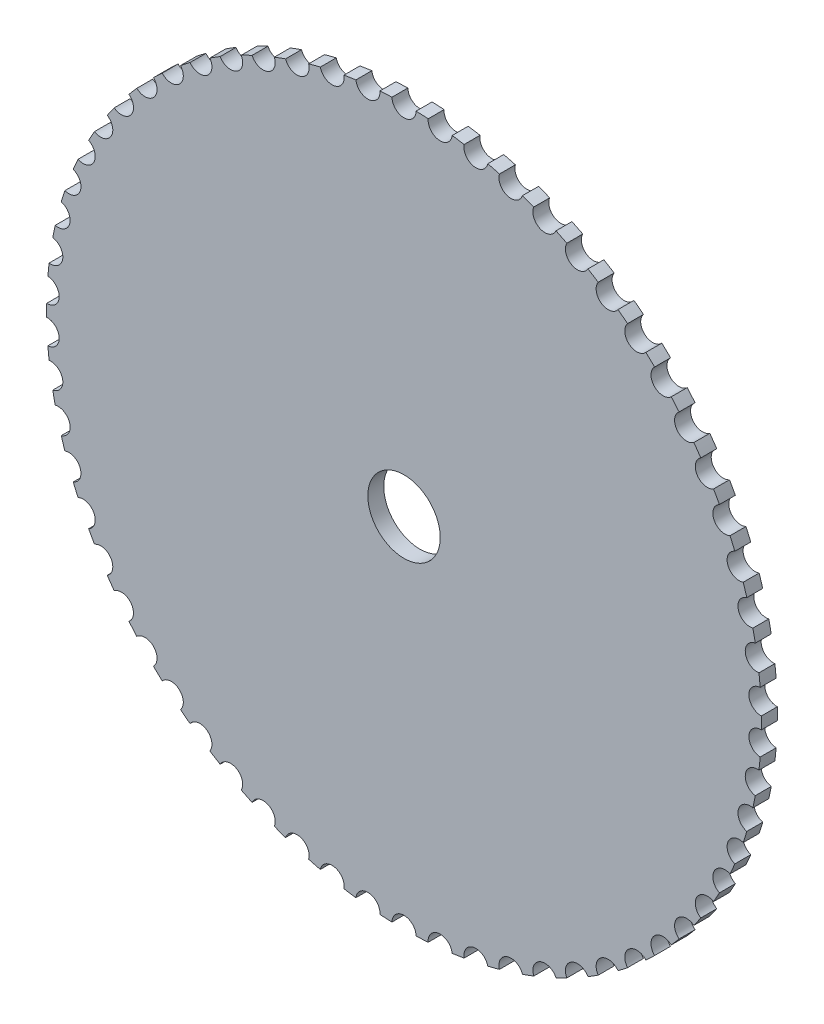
ISO-10303-21;
HEADER;
FILE_DESCRIPTION(('STEP AP214'),'2;1');
FILE_NAME('part.step','',(''),(''),'','','');
FILE_SCHEMA(('AUTOMOTIVE_DESIGN { 1 0 10303 214 1 1 1 1 }'));
ENDSEC;
DATA;
#1=APPLICATION_CONTEXT('core data for automotive mechanical design processes');
#2=APPLICATION_PROTOCOL_DEFINITION('international standard','automotive_design',2000,#1);
#3=PRODUCT_CONTEXT('',#1,'mechanical');
#4=PRODUCT('Part','Part','',(#3));
#5=PRODUCT_RELATED_PRODUCT_CATEGORY('part','',(#4));
#6=PRODUCT_DEFINITION_FORMATION('','',#4);
#7=PRODUCT_DEFINITION_CONTEXT('part definition',#1,'design');
#8=PRODUCT_DEFINITION('design','',#6,#7);
#9=PRODUCT_DEFINITION_SHAPE('','',#8);
#10=(LENGTH_UNIT() NAMED_UNIT(*) SI_UNIT(.MILLI.,.METRE.));
#11=(NAMED_UNIT(*) PLANE_ANGLE_UNIT() SI_UNIT($,.RADIAN.));
#12=(NAMED_UNIT(*) SI_UNIT($,.STERADIAN.) SOLID_ANGLE_UNIT());
#13=UNCERTAINTY_MEASURE_WITH_UNIT(LENGTH_MEASURE(1.E-05),#10,'distance_accuracy_value','');
#14=(GEOMETRIC_REPRESENTATION_CONTEXT(3) GLOBAL_UNCERTAINTY_ASSIGNED_CONTEXT((#13)) GLOBAL_UNIT_ASSIGNED_CONTEXT((#10,
#11,#12)) REPRESENTATION_CONTEXT('',''));
#15=CARTESIAN_POINT('',(0.,0.,0.));
#16=DIRECTION('',(0.,0.,1.));
#17=DIRECTION('',(1.,0.,0.));
#18=AXIS2_PLACEMENT_3D('',#15,#16,#17);
#19=CARTESIAN_POINT('',(0.,0.,2.0955));
#20=DIRECTION('',(0.,0.,-1.));
#21=DIRECTION('',(-1.,0.,0.));
#22=AXIS2_PLACEMENT_3D('',#19,#20,#21);
#23=CYLINDRICAL_SURFACE('',#22,93.98);
#24=CARTESIAN_POINT('',(0.,0.,-2.0955));
#25=DIRECTION('',(0.,0.,1.));
#26=DIRECTION('',(1.,0.,0.));
#27=AXIS2_PLACEMENT_3D('',#24,#25,#26);
#28=CIRCLE('',#27,93.98);
#29=CARTESIAN_POINT('',(-3.17454699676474,93.9263682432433,-2.0955));
#30=VERTEX_POINT('',#29);
#31=CARTESIAN_POINT('',(-6.34411364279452,93.7656260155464,-2.0955));
#32=VERTEX_POINT('',#31);
#33=EDGE_CURVE('E49',#30,#32,#28,.T.);
#34=ORIENTED_EDGE('',*,*,#33,.T.);
#35=DIRECTION('',(0.,0.,-1.));
#36=VECTOR('',#35,1.);
#37=CARTESIAN_POINT('',(-6.3441136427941,93.7656260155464,2.0965));
#38=LINE('',#37,#36);
#39=CARTESIAN_POINT('',(-6.34411364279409,93.7656260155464,2.0955));
#40=VERTEX_POINT('',#39);
#41=EDGE_CURVE('E62',#40,#32,#38,.T.);
#42=ORIENTED_EDGE('',*,*,#41,.F.);
#43=CARTESIAN_POINT('',(0.,0.,2.0955));
#44=DIRECTION('',(0.,0.,1.));
#45=DIRECTION('',(1.,0.,0.));
#46=AXIS2_PLACEMENT_3D('',#43,#44,#45);
#47=CIRCLE('',#46,93.98);
#48=CARTESIAN_POINT('',(-3.17454699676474,93.9263682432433,2.0955));
#49=VERTEX_POINT('',#48);
#50=EDGE_CURVE('E13',#49,#40,#47,.T.);
#51=ORIENTED_EDGE('',*,*,#50,.F.);
#52=DIRECTION('',(0.,0.,-1.));
#53=VECTOR('',#52,1.);
#54=CARTESIAN_POINT('',(-3.17454699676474,93.9263682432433,2.0965));
#55=LINE('',#54,#53);
#56=EDGE_CURVE('E833',#49,#30,#55,.T.);
#57=ORIENTED_EDGE('',*,*,#56,.T.);
#58=EDGE_LOOP('',(#34,#42,#51,#57));
#59=FACE_BOUND('',#58,.T.);
#60=ADVANCED_FACE('F45',(#59),#23,.T.);
#61=CARTESIAN_POINT('',(-12.6606324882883,93.1232988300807,2.0955));
#62=VERTEX_POINT('',#61);
#63=CARTESIAN_POINT('',(-15.7976750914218,92.6427215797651,2.0955));
#64=VERTEX_POINT('',#63);
#65=EDGE_CURVE('E54',#62,#64,#47,.T.);
#66=ORIENTED_EDGE('',*,*,#65,.F.);
#67=DIRECTION('',(0.,0.,-1.));
#68=VECTOR('',#67,1.);
#69=CARTESIAN_POINT('',(-12.6606324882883,93.1232988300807,2.0965));
#70=LINE('',#69,#68);
#71=CARTESIAN_POINT('',(-12.6606324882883,93.1232988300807,-2.0955));
#72=VERTEX_POINT('',#71);
#73=EDGE_CURVE('E810',#62,#72,#70,.T.);
#74=ORIENTED_EDGE('',*,*,#73,.T.);
#75=CARTESIAN_POINT('',(-15.7976750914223,92.642721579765,-2.0955));
#76=VERTEX_POINT('',#75);
#77=EDGE_CURVE('E70',#72,#76,#28,.T.);
#78=ORIENTED_EDGE('',*,*,#77,.T.);
#79=DIRECTION('',(0.,0.,-1.));
#80=VECTOR('',#79,1.);
#81=CARTESIAN_POINT('',(-15.7976750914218,92.6427215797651,2.0965));
#82=LINE('',#81,#80);
#83=EDGE_CURVE('E1244',#64,#76,#82,.T.);
#84=ORIENTED_EDGE('',*,*,#83,.F.);
#85=EDGE_LOOP('',(#66,#74,#78,#84));
#86=FACE_BOUND('',#85,.T.);
#87=ADVANCED_FACE('F1788',(#86),#23,.T.);
#88=CARTESIAN_POINT('',(-22.0168027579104,91.3646583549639,2.0955));
#89=VERTEX_POINT('',#88);
#90=CARTESIAN_POINT('',(-25.0891310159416,90.5691774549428,2.0955));
#91=VERTEX_POINT('',#90);
#92=EDGE_CURVE('E1798',#89,#91,#47,.T.);
#93=ORIENTED_EDGE('',*,*,#92,.F.);
#94=DIRECTION('',(0.,0.,-1.));
#95=VECTOR('',#94,1.);
#96=CARTESIAN_POINT('',(-22.0168027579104,91.3646583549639,2.0965));
#97=LINE('',#96,#95);
#98=CARTESIAN_POINT('',(-22.0168027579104,91.3646583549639,-2.0955));
#99=VERTEX_POINT('',#98);
#100=EDGE_CURVE('E1245',#89,#99,#97,.T.);
#101=ORIENTED_EDGE('',*,*,#100,.T.);
#102=CARTESIAN_POINT('',(-25.089131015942,90.5691774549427,-2.0955));
#103=VERTEX_POINT('',#102);
#104=EDGE_CURVE('E852',#99,#103,#28,.T.);
#105=ORIENTED_EDGE('',*,*,#104,.T.);
#106=DIRECTION('',(0.,0.,-1.));
#107=VECTOR('',#106,1.);
#108=CARTESIAN_POINT('',(-25.0891310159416,90.5691774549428,2.0965));
#109=LINE('',#108,#107);
#110=EDGE_CURVE('E1253',#91,#103,#109,.T.);
#111=ORIENTED_EDGE('',*,*,#110,.F.);
#112=EDGE_LOOP('',(#93,#101,#105,#111));
#113=FACE_BOUND('',#112,.T.);
#114=ADVANCED_FACE('F1792',(#113),#23,.T.);
#115=CARTESIAN_POINT('',(-31.1470508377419,88.6684928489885,2.0955));
#116=VERTEX_POINT('',#115);
#117=CARTESIAN_POINT('',(-34.123138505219,87.5662710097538,2.0955));
#118=VERTEX_POINT('',#117);
#119=EDGE_CURVE('E1799',#116,#118,#47,.T.);
#120=ORIENTED_EDGE('',*,*,#119,.F.);
#121=DIRECTION('',(0.,0.,-1.));
#122=VECTOR('',#121,1.);
#123=CARTESIAN_POINT('',(-31.1470508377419,88.6684928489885,2.0965));
#124=LINE('',#123,#122);
#125=CARTESIAN_POINT('',(-31.1470508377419,88.6684928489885,-2.0955));
#126=VERTEX_POINT('',#125);
#127=EDGE_CURVE('E1254',#116,#126,#124,.T.);
#128=ORIENTED_EDGE('',*,*,#127,.T.);
#129=CARTESIAN_POINT('',(-34.1231385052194,87.5662710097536,-2.0955));
#130=VERTEX_POINT('',#129);
#131=EDGE_CURVE('E853',#126,#130,#28,.T.);
#132=ORIENTED_EDGE('',*,*,#131,.T.);
#133=DIRECTION('',(0.,0.,-1.));
#134=VECTOR('',#133,1.);
#135=CARTESIAN_POINT('',(-34.123138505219,87.5662710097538,2.0965));
#136=LINE('',#135,#134);
#137=EDGE_CURVE('E1262',#118,#130,#136,.T.);
#138=ORIENTED_EDGE('',*,*,#137,.F.);
#139=EDGE_LOOP('',(#120,#128,#132,#138));
#140=FACE_BOUND('',#139,.T.);
#141=ADVANCED_FACE('F1796',(#140),#23,.T.);
#142=CARTESIAN_POINT('',(-39.957688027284,85.0624686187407,2.0955));
#143=VERTEX_POINT('',#142);
#144=CARTESIAN_POINT('',(-42.8069964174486,83.6648161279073,2.0955));
#145=VERTEX_POINT('',#144);
#146=EDGE_CURVE('E1802',#143,#145,#47,.T.);
#147=ORIENTED_EDGE('',*,*,#146,.F.);
#148=DIRECTION('',(0.,0.,-1.));
#149=VECTOR('',#148,1.);
#150=CARTESIAN_POINT('',(-39.957688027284,85.0624686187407,2.0965));
#151=LINE('',#150,#149);
#152=CARTESIAN_POINT('',(-39.957688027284,85.0624686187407,-2.0955));
#153=VERTEX_POINT('',#152);
#154=EDGE_CURVE('E1263',#143,#153,#151,.T.);
#155=ORIENTED_EDGE('',*,*,#154,.T.);
#156=CARTESIAN_POINT('',(-42.806996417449,83.6648161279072,-2.0955));
#157=VERTEX_POINT('',#156);
#158=EDGE_CURVE('E859',#153,#157,#28,.T.);
#159=ORIENTED_EDGE('',*,*,#158,.T.);
#160=DIRECTION('',(0.,0.,-1.));
#161=VECTOR('',#160,1.);
#162=CARTESIAN_POINT('',(-42.8069964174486,83.6648161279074,2.0965));
#163=LINE('',#162,#161);
#164=EDGE_CURVE('E1271',#145,#157,#163,.T.);
#165=ORIENTED_EDGE('',*,*,#164,.F.);
#166=EDGE_LOOP('',(#147,#155,#159,#165));
#167=FACE_BOUND('',#166,.T.);
#168=ADVANCED_FACE('F2279',(#167),#23,.T.);
#169=CARTESIAN_POINT('',(-48.3583052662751,80.5835883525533,2.0955));
#170=VERTEX_POINT('',#169);
#171=CARTESIAN_POINT('',(-51.0515966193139,78.9048470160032,2.0955));
#172=VERTEX_POINT('',#171);
#173=EDGE_CURVE('E1805',#170,#172,#47,.T.);
#174=ORIENTED_EDGE('',*,*,#173,.F.);
#175=DIRECTION('',(0.,0.,-1.));
#176=VECTOR('',#175,1.);
#177=CARTESIAN_POINT('',(-48.3583052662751,80.5835883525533,2.0965));
#178=LINE('',#177,#176);
#179=CARTESIAN_POINT('',(-48.3583052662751,80.5835883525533,-2.0955));
#180=VERTEX_POINT('',#179);
#181=EDGE_CURVE('E1272',#170,#180,#178,.T.);
#182=ORIENTED_EDGE('',*,*,#181,.T.);
#183=CARTESIAN_POINT('',(-51.0515966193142,78.904847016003,-2.0955));
#184=VERTEX_POINT('',#183);
#185=EDGE_CURVE('E865',#180,#184,#28,.T.);
#186=ORIENTED_EDGE('',*,*,#185,.T.);
#187=DIRECTION('',(0.,0.,-1.));
#188=VECTOR('',#187,1.);
#189=CARTESIAN_POINT('',(-51.0515966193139,78.9048470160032,2.0965));
#190=LINE('',#189,#188);
#191=EDGE_CURVE('E1280',#172,#184,#190,.T.);
#192=ORIENTED_EDGE('',*,*,#191,.F.);
#193=EDGE_LOOP('',(#174,#182,#186,#192));
#194=FACE_BOUND('',#193,.T.);
#195=ADVANCED_FACE('F2277',(#194),#23,.T.);
#196=CARTESIAN_POINT('',(-56.2627008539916,75.2778114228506,2.0955));
#197=VERTEX_POINT('',#196);
#198=CARTESIAN_POINT('',(-58.7723383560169,73.3352073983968,2.0955));
#199=VERTEX_POINT('',#198);
#200=EDGE_CURVE('E1808',#197,#199,#47,.T.);
#201=ORIENTED_EDGE('',*,*,#200,.F.);
#202=DIRECTION('',(0.,0.,-1.));
#203=VECTOR('',#202,1.);
#204=CARTESIAN_POINT('',(-56.2627008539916,75.2778114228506,2.0965));
#205=LINE('',#204,#203);
#206=CARTESIAN_POINT('',(-56.2627008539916,75.2778114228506,-2.0955));
#207=VERTEX_POINT('',#206);
#208=EDGE_CURVE('E1281',#197,#207,#205,.T.);
#209=ORIENTED_EDGE('',*,*,#208,.T.);
#210=CARTESIAN_POINT('',(-58.7723383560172,73.3352073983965,-2.0955));
#211=VERTEX_POINT('',#210);
#212=EDGE_CURVE('E871',#207,#211,#28,.T.);
#213=ORIENTED_EDGE('',*,*,#212,.T.);
#214=DIRECTION('',(0.,0.,-1.));
#215=VECTOR('',#214,1.);
#216=CARTESIAN_POINT('',(-58.7723383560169,73.3352073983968,2.0965));
#217=LINE('',#216,#215);
#218=EDGE_CURVE('E1289',#199,#211,#217,.T.);
#219=ORIENTED_EDGE('',*,*,#218,.F.);
#220=EDGE_LOOP('',(#201,#209,#213,#219));
#221=FACE_BOUND('',#220,.T.);
#222=ADVANCED_FACE('F2264',(#221),#23,.T.);
#223=CARTESIAN_POINT('',(-63.5897649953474,69.1995822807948,2.0955));
#224=VERTEX_POINT('',#223);
#225=CARTESIAN_POINT('',(-65.8899963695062,67.0130493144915,2.0955));
#226=VERTEX_POINT('',#225);
#227=EDGE_CURVE('E1811',#224,#226,#47,.T.);
#228=ORIENTED_EDGE('',*,*,#227,.F.);
#229=DIRECTION('',(0.,0.,-1.));
#230=VECTOR('',#229,1.);
#231=CARTESIAN_POINT('',(-63.5897649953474,69.1995822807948,2.0965));
#232=LINE('',#231,#230);
#233=CARTESIAN_POINT('',(-63.5897649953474,69.1995822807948,-2.0955));
#234=VERTEX_POINT('',#233);
#235=EDGE_CURVE('E1290',#224,#234,#232,.T.);
#236=ORIENTED_EDGE('',*,*,#235,.T.);
#237=CARTESIAN_POINT('',(-65.8899963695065,67.0130493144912,-2.0955));
#238=VERTEX_POINT('',#237);
#239=EDGE_CURVE('E877',#234,#238,#28,.T.);
#240=ORIENTED_EDGE('',*,*,#239,.T.);
#241=DIRECTION('',(0.,0.,-1.));
#242=VECTOR('',#241,1.);
#243=CARTESIAN_POINT('',(-65.8899963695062,67.0130493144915,2.0965));
#244=LINE('',#243,#242);
#245=EDGE_CURVE('E1298',#226,#238,#244,.T.);
#246=ORIENTED_EDGE('',*,*,#245,.F.);
#247=EDGE_LOOP('',(#228,#236,#240,#246));
#248=FACE_BOUND('',#247,.T.);
#249=ADVANCED_FACE('F2260',(#248),#23,.T.);
#250=CARTESIAN_POINT('',(-70.2643120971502,62.4112717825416,2.0955));
#251=VERTEX_POINT('',#250);
#252=CARTESIAN_POINT('',(-72.3315338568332,60.0032466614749,2.0955));
#253=VERTEX_POINT('',#252);
#254=EDGE_CURVE('E1814',#251,#253,#47,.T.);
#255=ORIENTED_EDGE('',*,*,#254,.F.);
#256=DIRECTION('',(0.,0.,-1.));
#257=VECTOR('',#256,1.);
#258=CARTESIAN_POINT('',(-70.2643120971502,62.4112717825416,2.0965));
#259=LINE('',#258,#257);
#260=CARTESIAN_POINT('',(-70.2643120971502,62.4112717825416,-2.0955));
#261=VERTEX_POINT('',#260);
#262=EDGE_CURVE('E1299',#251,#261,#259,.T.);
#263=ORIENTED_EDGE('',*,*,#262,.T.);
#264=CARTESIAN_POINT('',(-72.3315338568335,60.0032466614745,-2.0955));
#265=VERTEX_POINT('',#264);
#266=EDGE_CURVE('E883',#261,#265,#28,.T.);
#267=ORIENTED_EDGE('',*,*,#266,.T.);
#268=DIRECTION('',(0.,0.,-1.));
#269=VECTOR('',#268,1.);
#270=CARTESIAN_POINT('',(-72.3315338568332,60.0032466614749,2.0965));
#271=LINE('',#270,#269);
#272=EDGE_CURVE('E1307',#253,#265,#271,.T.);
#273=ORIENTED_EDGE('',*,*,#272,.F.);
#274=EDGE_LOOP('',(#255,#263,#267,#273));
#275=FACE_BOUND('',#274,.T.);
#276=ADVANCED_FACE('F2255',(#275),#23,.T.);
#277=CARTESIAN_POINT('',(-76.2178522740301,54.9825371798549,2.0955));
#278=VERTEX_POINT('',#277);
#279=CARTESIAN_POINT('',(-78.030851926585,52.3777295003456,2.0955));
#280=VERTEX_POINT('',#279);
#281=EDGE_CURVE('E1817',#278,#280,#47,.T.);
#282=ORIENTED_EDGE('',*,*,#281,.F.);
#283=DIRECTION('',(0.,0.,-1.));
#284=VECTOR('',#283,1.);
#285=CARTESIAN_POINT('',(-76.2178522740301,54.9825371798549,2.0965));
#286=LINE('',#285,#284);
#287=CARTESIAN_POINT('',(-76.2178522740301,54.9825371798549,-2.0955));
#288=VERTEX_POINT('',#287);
#289=EDGE_CURVE('E1308',#278,#288,#286,.T.);
#290=ORIENTED_EDGE('',*,*,#289,.T.);
#291=CARTESIAN_POINT('',(-78.0308519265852,52.3777295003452,-2.0955));
#292=VERTEX_POINT('',#291);
#293=EDGE_CURVE('E889',#288,#292,#28,.T.);
#294=ORIENTED_EDGE('',*,*,#293,.T.);
#295=DIRECTION('',(0.,0.,-1.));
#296=VECTOR('',#295,1.);
#297=CARTESIAN_POINT('',(-78.030851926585,52.3777295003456,2.0965));
#298=LINE('',#297,#296);
#299=EDGE_CURVE('E1316',#280,#292,#298,.T.);
#300=ORIENTED_EDGE('',*,*,#299,.F.);
#301=EDGE_LOOP('',(#282,#290,#294,#300));
#302=FACE_BOUND('',#301,.T.);
#303=ADVANCED_FACE('F2253',(#302),#23,.T.);
#304=CARTESIAN_POINT('',(-81.3892941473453,46.9896073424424,2.0955));
#305=VERTEX_POINT('',#304);
#306=CARTESIAN_POINT('',(-82.9294678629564,44.2147459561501,2.0955));
#307=VERTEX_POINT('',#306);
#308=EDGE_CURVE('E1820',#305,#307,#47,.T.);
#309=ORIENTED_EDGE('',*,*,#308,.F.);
#310=DIRECTION('',(0.,0.,-1.));
#311=VECTOR('',#310,1.);
#312=CARTESIAN_POINT('',(-81.3892941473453,46.9896073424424,2.0965));
#313=LINE('',#312,#311);
#314=CARTESIAN_POINT('',(-81.3892941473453,46.9896073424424,-2.0955));
#315=VERTEX_POINT('',#314);
#316=EDGE_CURVE('E1317',#305,#315,#313,.T.);
#317=ORIENTED_EDGE('',*,*,#316,.T.);
#318=CARTESIAN_POINT('',(-82.9294678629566,44.2147459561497,-2.0955));
#319=VERTEX_POINT('',#318);
#320=EDGE_CURVE('E895',#315,#319,#28,.T.);
#321=ORIENTED_EDGE('',*,*,#320,.T.);
#322=DIRECTION('',(0.,0.,-1.));
#323=VECTOR('',#322,1.);
#324=CARTESIAN_POINT('',(-82.9294678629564,44.2147459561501,2.0965));
#325=LINE('',#324,#323);
#326=EDGE_CURVE('E1325',#307,#319,#325,.T.);
#327=ORIENTED_EDGE('',*,*,#326,.F.);
#328=EDGE_LOOP('',(#309,#317,#321,#327));
#329=FACE_BOUND('',#328,.T.);
#330=ADVANCED_FACE('F2240',(#329),#23,.T.);
#331=CARTESIAN_POINT('',(-85.7255717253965,38.514500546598,2.0955));
#332=VERTEX_POINT('',#331);
#333=CARTESIAN_POINT('',(-86.9771152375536,35.5980592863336,2.0955));
#334=VERTEX_POINT('',#333);
#335=EDGE_CURVE('E1823',#332,#334,#47,.T.);
#336=ORIENTED_EDGE('',*,*,#335,.F.);
#337=DIRECTION('',(0.,0.,-1.));
#338=VECTOR('',#337,1.);
#339=CARTESIAN_POINT('',(-85.7255717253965,38.514500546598,2.0965));
#340=LINE('',#339,#338);
#341=CARTESIAN_POINT('',(-85.7255717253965,38.514500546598,-2.0955));
#342=VERTEX_POINT('',#341);
#343=EDGE_CURVE('E1326',#332,#342,#340,.T.);
#344=ORIENTED_EDGE('',*,*,#343,.T.);
#345=CARTESIAN_POINT('',(-86.9771152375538,35.5980592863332,-2.0955));
#346=VERTEX_POINT('',#345);
#347=EDGE_CURVE('E901',#342,#346,#28,.T.);
#348=ORIENTED_EDGE('',*,*,#347,.T.);
#349=DIRECTION('',(0.,0.,-1.));
#350=VECTOR('',#349,1.);
#351=CARTESIAN_POINT('',(-86.9771152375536,35.5980592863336,2.0965));
#352=LINE('',#351,#350);
#353=EDGE_CURVE('E1334',#334,#346,#352,.T.);
#354=ORIENTED_EDGE('',*,*,#353,.F.);
#355=EDGE_LOOP('',(#336,#344,#348,#354));
#356=FACE_BOUND('',#355,.T.);
#357=ADVANCED_FACE('F2236',(#356),#23,.T.);
#358=CARTESIAN_POINT('',(-89.182188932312,29.6441828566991,2.0955));
#359=VERTEX_POINT('',#358);
#360=CARTESIAN_POINT('',(-90.1322597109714,26.6160883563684,2.0955));
#361=VERTEX_POINT('',#360);
#362=EDGE_CURVE('E1826',#359,#361,#47,.T.);
#363=ORIENTED_EDGE('',*,*,#362,.F.);
#364=DIRECTION('',(0.,0.,-1.));
#365=VECTOR('',#364,1.);
#366=CARTESIAN_POINT('',(-89.182188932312,29.6441828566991,2.0965));
#367=LINE('',#366,#365);
#368=CARTESIAN_POINT('',(-89.182188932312,29.6441828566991,-2.0955));
#369=VERTEX_POINT('',#368);
#370=EDGE_CURVE('E1335',#359,#369,#367,.T.);
#371=ORIENTED_EDGE('',*,*,#370,.T.);
#372=CARTESIAN_POINT('',(-90.1322597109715,26.616088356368,-2.0955));
#373=VERTEX_POINT('',#372);
#374=EDGE_CURVE('E907',#369,#373,#28,.T.);
#375=ORIENTED_EDGE('',*,*,#374,.T.);
#376=DIRECTION('',(0.,0.,-1.));
#377=VECTOR('',#376,1.);
#378=CARTESIAN_POINT('',(-90.1322597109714,26.6160883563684,2.0965));
#379=LINE('',#378,#377);
#380=EDGE_CURVE('E1343',#361,#373,#379,.T.);
#381=ORIENTED_EDGE('',*,*,#380,.F.);
#382=EDGE_LOOP('',(#363,#371,#375,#381));
#383=FACE_BOUND('',#382,.T.);
#384=ADVANCED_FACE('F2231',(#383),#23,.T.);
#385=CARTESIAN_POINT('',(-91.7236761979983,20.4696757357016,2.0955));
#386=VERTEX_POINT('',#385);
#387=CARTESIAN_POINT('',(-92.3625252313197,17.3610003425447,2.0955));
#388=VERTEX_POINT('',#387);
#389=EDGE_CURVE('E1829',#386,#388,#47,.T.);
#390=ORIENTED_EDGE('',*,*,#389,.F.);
#391=DIRECTION('',(0.,0.,-1.));
#392=VECTOR('',#391,1.);
#393=CARTESIAN_POINT('',(-91.7236761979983,20.4696757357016,2.0965));
#394=LINE('',#393,#392);
#395=CARTESIAN_POINT('',(-91.7236761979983,20.4696757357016,-2.0955));
#396=VERTEX_POINT('',#395);
#397=EDGE_CURVE('E1344',#386,#396,#394,.T.);
#398=ORIENTED_EDGE('',*,*,#397,.T.);
#399=CARTESIAN_POINT('',(-92.3625252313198,17.3610003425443,-2.0955));
#400=VERTEX_POINT('',#399);
#401=EDGE_CURVE('E913',#396,#400,#28,.T.);
#402=ORIENTED_EDGE('',*,*,#401,.T.);
#403=DIRECTION('',(0.,0.,-1.));
#404=VECTOR('',#403,1.);
#405=CARTESIAN_POINT('',(-92.3625252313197,17.3610003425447,2.0965));
#406=LINE('',#405,#404);
#407=EDGE_CURVE('E1352',#388,#400,#406,.T.);
#408=ORIENTED_EDGE('',*,*,#407,.F.);
#409=EDGE_LOOP('',(#390,#398,#402,#408));
#410=FACE_BOUND('',#409,.T.);
#411=ADVANCED_FACE('F2229',(#410),#23,.T.);
#412=CARTESIAN_POINT('',(-93.3239544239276,11.085122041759,2.0955));
#413=VERTEX_POINT('',#412);
#414=CARTESIAN_POINT('',(-93.6450262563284,7.92776497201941,2.0955));
#415=VERTEX_POINT('',#414);
#416=EDGE_CURVE('E1832',#413,#415,#47,.T.);
#417=ORIENTED_EDGE('',*,*,#416,.F.);
#418=DIRECTION('',(0.,0.,-1.));
#419=VECTOR('',#418,1.);
#420=CARTESIAN_POINT('',(-93.3239544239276,11.085122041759,2.0965));
#421=LINE('',#420,#419);
#422=CARTESIAN_POINT('',(-93.3239544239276,11.085122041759,-2.0955));
#423=VERTEX_POINT('',#422);
#424=EDGE_CURVE('E1353',#413,#423,#421,.T.);
#425=ORIENTED_EDGE('',*,*,#424,.T.);
#426=CARTESIAN_POINT('',(-93.6450262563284,7.92776497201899,-2.0955));
#427=VERTEX_POINT('',#426);
#428=EDGE_CURVE('E919',#423,#427,#28,.T.);
#429=ORIENTED_EDGE('',*,*,#428,.T.);
#430=DIRECTION('',(0.,0.,-1.));
#431=VECTOR('',#430,1.);
#432=CARTESIAN_POINT('',(-93.6450262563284,7.92776497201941,2.0965));
#433=LINE('',#432,#431);
#434=EDGE_CURVE('E1361',#415,#427,#433,.T.);
#435=ORIENTED_EDGE('',*,*,#434,.F.);
#436=EDGE_LOOP('',(#417,#425,#429,#435));
#437=FACE_BOUND('',#436,.T.);
#438=ADVANCED_FACE('F2216',(#437),#23,.T.);
#439=CARTESIAN_POINT('',(-93.9666025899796,1.58681999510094,2.0955));
#440=VERTEX_POINT('',#439);
#441=CARTESIAN_POINT('',(-93.9666025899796,-1.5868199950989,2.0955));
#442=VERTEX_POINT('',#441);
#443=EDGE_CURVE('E1835',#440,#442,#47,.T.);
#444=ORIENTED_EDGE('',*,*,#443,.F.);
#445=DIRECTION('',(0.,0.,-1.));
#446=VECTOR('',#445,1.);
#447=CARTESIAN_POINT('',(-93.9666025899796,1.58681999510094,2.0965));
#448=LINE('',#447,#446);
#449=CARTESIAN_POINT('',(-93.9666025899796,1.58681999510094,-2.0955));
#450=VERTEX_POINT('',#449);
#451=EDGE_CURVE('E1362',#440,#450,#448,.T.);
#452=ORIENTED_EDGE('',*,*,#451,.T.);
#453=CARTESIAN_POINT('',(-93.9666025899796,-1.58681999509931,-2.0955));
#454=VERTEX_POINT('',#453);
#455=EDGE_CURVE('E925',#450,#454,#28,.T.);
#456=ORIENTED_EDGE('',*,*,#455,.T.);
#457=DIRECTION('',(0.,0.,-1.));
#458=VECTOR('',#457,1.);
#459=CARTESIAN_POINT('',(-93.9666025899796,-1.58681999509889,2.0965));
#460=LINE('',#459,#458);
#461=EDGE_CURVE('E1370',#442,#454,#460,.T.);
#462=ORIENTED_EDGE('',*,*,#461,.F.);
#463=EDGE_LOOP('',(#444,#452,#456,#462));
#464=FACE_BOUND('',#463,.T.);
#465=ADVANCED_FACE('F2212',(#464),#23,.T.);
#466=CARTESIAN_POINT('',(-93.6450262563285,-7.92776497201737,2.0955));
#467=VERTEX_POINT('',#466);
#468=CARTESIAN_POINT('',(-93.3239544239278,-11.0851220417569,2.0955));
#469=VERTEX_POINT('',#468);
#470=EDGE_CURVE('E1838',#467,#469,#47,.T.);
#471=ORIENTED_EDGE('',*,*,#470,.F.);
#472=DIRECTION('',(0.,0.,-1.));
#473=VECTOR('',#472,1.);
#474=CARTESIAN_POINT('',(-93.6450262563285,-7.92776497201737,2.0965));
#475=LINE('',#474,#473);
#476=CARTESIAN_POINT('',(-93.6450262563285,-7.92776497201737,-2.0955));
#477=VERTEX_POINT('',#476);
#478=EDGE_CURVE('E1371',#467,#477,#475,.T.);
#479=ORIENTED_EDGE('',*,*,#478,.T.);
#480=CARTESIAN_POINT('',(-93.3239544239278,-11.0851220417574,-2.0955));
#481=VERTEX_POINT('',#480);
#482=EDGE_CURVE('E931',#477,#481,#28,.T.);
#483=ORIENTED_EDGE('',*,*,#482,.T.);
#484=DIRECTION('',(0.,0.,-1.));
#485=VECTOR('',#484,1.);
#486=CARTESIAN_POINT('',(-93.3239544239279,-11.0851220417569,2.0965));
#487=LINE('',#486,#485);
#488=EDGE_CURVE('E1379',#469,#481,#487,.T.);
#489=ORIENTED_EDGE('',*,*,#488,.F.);
#490=EDGE_LOOP('',(#471,#479,#483,#489));
#491=FACE_BOUND('',#490,.T.);
#492=ADVANCED_FACE('F2207',(#491),#23,.T.);
#493=CARTESIAN_POINT('',(-92.3625252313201,-17.3610003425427,2.0955));
#494=VERTEX_POINT('',#493);
#495=CARTESIAN_POINT('',(-91.7236761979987,-20.4696757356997,2.0955));
#496=VERTEX_POINT('',#495);
#497=EDGE_CURVE('E1841',#494,#496,#47,.T.);
#498=ORIENTED_EDGE('',*,*,#497,.F.);
#499=DIRECTION('',(0.,0.,-1.));
#500=VECTOR('',#499,1.);
#501=CARTESIAN_POINT('',(-92.3625252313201,-17.3610003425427,2.0965));
#502=LINE('',#501,#500);
#503=CARTESIAN_POINT('',(-92.3625252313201,-17.3610003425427,-2.0955));
#504=VERTEX_POINT('',#503);
#505=EDGE_CURVE('E1380',#494,#504,#502,.T.);
#506=ORIENTED_EDGE('',*,*,#505,.T.);
#507=CARTESIAN_POINT('',(-91.7236761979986,-20.4696757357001,-2.0955));
#508=VERTEX_POINT('',#507);
#509=EDGE_CURVE('E937',#504,#508,#28,.T.);
#510=ORIENTED_EDGE('',*,*,#509,.T.);
#511=DIRECTION('',(0.,0.,-1.));
#512=VECTOR('',#511,1.);
#513=CARTESIAN_POINT('',(-91.7236761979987,-20.4696757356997,2.0965));
#514=LINE('',#513,#512);
#515=EDGE_CURVE('E1388',#496,#508,#514,.T.);
#516=ORIENTED_EDGE('',*,*,#515,.F.);
#517=EDGE_LOOP('',(#498,#506,#510,#516));
#518=FACE_BOUND('',#517,.T.);
#519=ADVANCED_FACE('F2205',(#518),#23,.T.);
#520=CARTESIAN_POINT('',(-90.132259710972,-26.6160883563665,2.0955));
#521=VERTEX_POINT('',#520);
#522=CARTESIAN_POINT('',(-89.1821889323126,-29.6441828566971,2.0955));
#523=VERTEX_POINT('',#522);
#524=EDGE_CURVE('E1844',#521,#523,#47,.T.);
#525=ORIENTED_EDGE('',*,*,#524,.F.);
#526=DIRECTION('',(0.,0.,-1.));
#527=VECTOR('',#526,1.);
#528=CARTESIAN_POINT('',(-90.132259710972,-26.6160883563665,2.0965));
#529=LINE('',#528,#527);
#530=CARTESIAN_POINT('',(-90.132259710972,-26.6160883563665,-2.0955));
#531=VERTEX_POINT('',#530);
#532=EDGE_CURVE('E1389',#521,#531,#529,.T.);
#533=ORIENTED_EDGE('',*,*,#532,.T.);
#534=CARTESIAN_POINT('',(-89.1821889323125,-29.6441828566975,-2.0955));
#535=VERTEX_POINT('',#534);
#536=EDGE_CURVE('E943',#531,#535,#28,.T.);
#537=ORIENTED_EDGE('',*,*,#536,.T.);
#538=DIRECTION('',(0.,0.,-1.));
#539=VECTOR('',#538,1.);
#540=CARTESIAN_POINT('',(-89.1821889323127,-29.6441828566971,2.0965));
#541=LINE('',#540,#539);
#542=EDGE_CURVE('E1397',#523,#535,#541,.T.);
#543=ORIENTED_EDGE('',*,*,#542,.F.);
#544=EDGE_LOOP('',(#525,#533,#537,#543));
#545=FACE_BOUND('',#544,.T.);
#546=ADVANCED_FACE('F2192',(#545),#23,.T.);
#547=CARTESIAN_POINT('',(-86.9771152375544,-35.5980592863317,2.0955));
#548=VERTEX_POINT('',#547);
#549=CARTESIAN_POINT('',(-85.7255717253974,-38.5145005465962,2.0955));
#550=VERTEX_POINT('',#549);
#551=EDGE_CURVE('E1847',#548,#550,#47,.T.);
#552=ORIENTED_EDGE('',*,*,#551,.F.);
#553=DIRECTION('',(0.,0.,-1.));
#554=VECTOR('',#553,1.);
#555=CARTESIAN_POINT('',(-86.9771152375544,-35.5980592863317,2.0965));
#556=LINE('',#555,#554);
#557=CARTESIAN_POINT('',(-86.9771152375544,-35.5980592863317,-2.0955));
#558=VERTEX_POINT('',#557);
#559=EDGE_CURVE('E1398',#548,#558,#556,.T.);
#560=ORIENTED_EDGE('',*,*,#559,.T.);
#561=CARTESIAN_POINT('',(-85.7255717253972,-38.5145005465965,-2.0955));
#562=VERTEX_POINT('',#561);
#563=EDGE_CURVE('E949',#558,#562,#28,.T.);
#564=ORIENTED_EDGE('',*,*,#563,.T.);
#565=DIRECTION('',(0.,0.,-1.));
#566=VECTOR('',#565,1.);
#567=CARTESIAN_POINT('',(-85.7255717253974,-38.5145005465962,2.0965));
#568=LINE('',#567,#566);
#569=EDGE_CURVE('E1406',#550,#562,#568,.T.);
#570=ORIENTED_EDGE('',*,*,#569,.F.);
#571=EDGE_LOOP('',(#552,#560,#564,#570));
#572=FACE_BOUND('',#571,.T.);
#573=ADVANCED_FACE('F2188',(#572),#23,.T.);
#574=CARTESIAN_POINT('',(-82.9294678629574,-44.2147459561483,2.0955));
#575=VERTEX_POINT('',#574);
#576=CARTESIAN_POINT('',(-81.3892941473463,-46.9896073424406,2.0955));
#577=VERTEX_POINT('',#576);
#578=EDGE_CURVE('E1850',#575,#577,#47,.T.);
#579=ORIENTED_EDGE('',*,*,#578,.F.);
#580=DIRECTION('',(0.,0.,-1.));
#581=VECTOR('',#580,1.);
#582=CARTESIAN_POINT('',(-82.9294678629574,-44.2147459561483,2.0965));
#583=LINE('',#582,#581);
#584=CARTESIAN_POINT('',(-82.9294678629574,-44.2147459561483,-2.0955));
#585=VERTEX_POINT('',#584);
#586=EDGE_CURVE('E1407',#575,#585,#583,.T.);
#587=ORIENTED_EDGE('',*,*,#586,.T.);
#588=CARTESIAN_POINT('',(-81.389294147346,-46.989607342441,-2.0955));
#589=VERTEX_POINT('',#588);
#590=EDGE_CURVE('E955',#585,#589,#28,.T.);
#591=ORIENTED_EDGE('',*,*,#590,.T.);
#592=DIRECTION('',(0.,0.,-1.));
#593=VECTOR('',#592,1.);
#594=CARTESIAN_POINT('',(-81.3892941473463,-46.9896073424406,2.0965));
#595=LINE('',#594,#593);
#596=EDGE_CURVE('E1415',#577,#589,#595,.T.);
#597=ORIENTED_EDGE('',*,*,#596,.F.);
#598=EDGE_LOOP('',(#579,#587,#591,#597));
#599=FACE_BOUND('',#598,.T.);
#600=ADVANCED_FACE('F2183',(#599),#23,.T.);
#601=CARTESIAN_POINT('',(-78.0308519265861,-52.3777295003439,2.0955));
#602=VERTEX_POINT('',#601);
#603=CARTESIAN_POINT('',(-76.2178522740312,-54.9825371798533,2.0955));
#604=VERTEX_POINT('',#603);
#605=EDGE_CURVE('E1853',#602,#604,#47,.T.);
#606=ORIENTED_EDGE('',*,*,#605,.F.);
#607=DIRECTION('',(0.,0.,-1.));
#608=VECTOR('',#607,1.);
#609=CARTESIAN_POINT('',(-78.0308519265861,-52.3777295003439,2.0965));
#610=LINE('',#609,#608);
#611=CARTESIAN_POINT('',(-78.0308519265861,-52.3777295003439,-2.0955));
#612=VERTEX_POINT('',#611);
#613=EDGE_CURVE('E1416',#602,#612,#610,.T.);
#614=ORIENTED_EDGE('',*,*,#613,.T.);
#615=CARTESIAN_POINT('',(-76.217852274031,-54.9825371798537,-2.0955));
#616=VERTEX_POINT('',#615);
#617=EDGE_CURVE('E961',#612,#616,#28,.T.);
#618=ORIENTED_EDGE('',*,*,#617,.T.);
#619=DIRECTION('',(0.,0.,-1.));
#620=VECTOR('',#619,1.);
#621=CARTESIAN_POINT('',(-76.2178522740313,-54.9825371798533,2.0965));
#622=LINE('',#621,#620);
#623=EDGE_CURVE('E1424',#604,#616,#622,.T.);
#624=ORIENTED_EDGE('',*,*,#623,.F.);
#625=EDGE_LOOP('',(#606,#614,#618,#624));
#626=FACE_BOUND('',#625,.T.);
#627=ADVANCED_FACE('F2181',(#626),#23,.T.);
#628=CARTESIAN_POINT('',(-72.3315338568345,-60.0032466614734,2.0955));
#629=VERTEX_POINT('',#628);
#630=CARTESIAN_POINT('',(-70.2643120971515,-62.4112717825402,2.0955));
#631=VERTEX_POINT('',#630);
#632=EDGE_CURVE('E1856',#629,#631,#47,.T.);
#633=ORIENTED_EDGE('',*,*,#632,.F.);
#634=DIRECTION('',(0.,0.,-1.));
#635=VECTOR('',#634,1.);
#636=CARTESIAN_POINT('',(-72.3315338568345,-60.0032466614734,2.0965));
#637=LINE('',#636,#635);
#638=CARTESIAN_POINT('',(-72.3315338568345,-60.0032466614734,-2.0955));
#639=VERTEX_POINT('',#638);
#640=EDGE_CURVE('E1425',#629,#639,#637,.T.);
#641=ORIENTED_EDGE('',*,*,#640,.T.);
#642=CARTESIAN_POINT('',(-70.2643120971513,-62.4112717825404,-2.0955));
#643=VERTEX_POINT('',#642);
#644=EDGE_CURVE('E967',#639,#643,#28,.T.);
#645=ORIENTED_EDGE('',*,*,#644,.T.);
#646=DIRECTION('',(0.,0.,-1.));
#647=VECTOR('',#646,1.);
#648=CARTESIAN_POINT('',(-70.2643120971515,-62.4112717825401,2.0965));
#649=LINE('',#648,#647);
#650=EDGE_CURVE('E1433',#631,#643,#649,.T.);
#651=ORIENTED_EDGE('',*,*,#650,.F.);
#652=EDGE_LOOP('',(#633,#641,#645,#651));
#653=FACE_BOUND('',#652,.T.);
#654=ADVANCED_FACE('F2168',(#653),#23,.T.);
#655=CARTESIAN_POINT('',(-65.8899963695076,-67.0130493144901,2.0955));
#656=VERTEX_POINT('',#655);
#657=CARTESIAN_POINT('',(-63.5897649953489,-69.1995822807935,2.0955));
#658=VERTEX_POINT('',#657);
#659=EDGE_CURVE('E1859',#656,#658,#47,.T.);
#660=ORIENTED_EDGE('',*,*,#659,.F.);
#661=DIRECTION('',(0.,0.,-1.));
#662=VECTOR('',#661,1.);
#663=CARTESIAN_POINT('',(-65.8899963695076,-67.0130493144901,2.0965));
#664=LINE('',#663,#662);
#665=CARTESIAN_POINT('',(-65.8899963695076,-67.0130493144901,-2.0955));
#666=VERTEX_POINT('',#665);
#667=EDGE_CURVE('E1434',#656,#666,#664,.T.);
#668=ORIENTED_EDGE('',*,*,#667,.T.);
#669=CARTESIAN_POINT('',(-63.5897649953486,-69.1995822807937,-2.0955));
#670=VERTEX_POINT('',#669);
#671=EDGE_CURVE('E973',#666,#670,#28,.T.);
#672=ORIENTED_EDGE('',*,*,#671,.T.);
#673=DIRECTION('',(0.,0.,-1.));
#674=VECTOR('',#673,1.);
#675=CARTESIAN_POINT('',(-63.5897649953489,-69.1995822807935,2.0965));
#676=LINE('',#675,#674);
#677=EDGE_CURVE('E1442',#658,#670,#676,.T.);
#678=ORIENTED_EDGE('',*,*,#677,.F.);
#679=EDGE_LOOP('',(#660,#668,#672,#678));
#680=FACE_BOUND('',#679,.T.);
#681=ADVANCED_FACE('F2164',(#680),#23,.T.);
#682=CARTESIAN_POINT('',(-58.7723383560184,-73.3352073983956,2.0955));
#683=VERTEX_POINT('',#682);
#684=CARTESIAN_POINT('',(-56.2627008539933,-75.2778114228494,2.0955));
#685=VERTEX_POINT('',#684);
#686=EDGE_CURVE('E1862',#683,#685,#47,.T.);
#687=ORIENTED_EDGE('',*,*,#686,.F.);
#688=DIRECTION('',(0.,0.,-1.));
#689=VECTOR('',#688,1.);
#690=CARTESIAN_POINT('',(-58.7723383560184,-73.3352073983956,2.0965));
#691=LINE('',#690,#689);
#692=CARTESIAN_POINT('',(-58.7723383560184,-73.3352073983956,-2.0955));
#693=VERTEX_POINT('',#692);
#694=EDGE_CURVE('E1443',#683,#693,#691,.T.);
#695=ORIENTED_EDGE('',*,*,#694,.T.);
#696=CARTESIAN_POINT('',(-56.2627008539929,-75.2778114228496,-2.0955));
#697=VERTEX_POINT('',#696);
#698=EDGE_CURVE('E979',#693,#697,#28,.T.);
#699=ORIENTED_EDGE('',*,*,#698,.T.);
#700=DIRECTION('',(0.,0.,-1.));
#701=VECTOR('',#700,1.);
#702=CARTESIAN_POINT('',(-56.2627008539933,-75.2778114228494,2.0965));
#703=LINE('',#702,#701);
#704=EDGE_CURVE('E1451',#685,#697,#703,.T.);
#705=ORIENTED_EDGE('',*,*,#704,.F.);
#706=EDGE_LOOP('',(#687,#695,#699,#705));
#707=FACE_BOUND('',#706,.T.);
#708=ADVANCED_FACE('F2159',(#707),#23,.T.);
#709=CARTESIAN_POINT('',(-51.0515966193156,-78.9048470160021,2.0955));
#710=VERTEX_POINT('',#709);
#711=CARTESIAN_POINT('',(-48.3583052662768,-80.5835883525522,2.0955));
#712=VERTEX_POINT('',#711);
#713=EDGE_CURVE('E1865',#710,#712,#47,.T.);
#714=ORIENTED_EDGE('',*,*,#713,.F.);
#715=DIRECTION('',(0.,0.,-1.));
#716=VECTOR('',#715,1.);
#717=CARTESIAN_POINT('',(-51.0515966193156,-78.9048470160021,2.0965));
#718=LINE('',#717,#716);
#719=CARTESIAN_POINT('',(-51.0515966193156,-78.9048470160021,-2.0955));
#720=VERTEX_POINT('',#719);
#721=EDGE_CURVE('E1452',#710,#720,#718,.T.);
#722=ORIENTED_EDGE('',*,*,#721,.T.);
#723=CARTESIAN_POINT('',(-48.3583052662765,-80.5835883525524,-2.0955));
#724=VERTEX_POINT('',#723);
#725=EDGE_CURVE('E985',#720,#724,#28,.T.);
#726=ORIENTED_EDGE('',*,*,#725,.T.);
#727=DIRECTION('',(0.,0.,-1.));
#728=VECTOR('',#727,1.);
#729=CARTESIAN_POINT('',(-48.3583052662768,-80.5835883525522,2.0965));
#730=LINE('',#729,#728);
#731=EDGE_CURVE('E1460',#712,#724,#730,.T.);
#732=ORIENTED_EDGE('',*,*,#731,.F.);
#733=EDGE_LOOP('',(#714,#722,#726,#732));
#734=FACE_BOUND('',#733,.T.);
#735=ADVANCED_FACE('F2157',(#734),#23,.T.);
#736=CARTESIAN_POINT('',(-42.8069964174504,-83.6648161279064,2.0955));
#737=VERTEX_POINT('',#736);
#738=CARTESIAN_POINT('',(-39.9576880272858,-85.0624686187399,2.0955));
#739=VERTEX_POINT('',#738);
#740=EDGE_CURVE('E1868',#737,#739,#47,.T.);
#741=ORIENTED_EDGE('',*,*,#740,.F.);
#742=DIRECTION('',(0.,0.,-1.));
#743=VECTOR('',#742,1.);
#744=CARTESIAN_POINT('',(-42.8069964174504,-83.6648161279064,2.0965));
#745=LINE('',#744,#743);
#746=CARTESIAN_POINT('',(-42.8069964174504,-83.6648161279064,-2.0955));
#747=VERTEX_POINT('',#746);
#748=EDGE_CURVE('E1461',#737,#747,#745,.T.);
#749=ORIENTED_EDGE('',*,*,#748,.T.);
#750=CARTESIAN_POINT('',(-39.9576880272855,-85.06246861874,-2.0955));
#751=VERTEX_POINT('',#750);
#752=EDGE_CURVE('E991',#747,#751,#28,.T.);
#753=ORIENTED_EDGE('',*,*,#752,.T.);
#754=DIRECTION('',(0.,0.,-1.));
#755=VECTOR('',#754,1.);
#756=CARTESIAN_POINT('',(-39.9576880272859,-85.0624686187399,2.0965));
#757=LINE('',#756,#755);
#758=EDGE_CURVE('E1469',#739,#751,#757,.T.);
#759=ORIENTED_EDGE('',*,*,#758,.F.);
#760=EDGE_LOOP('',(#741,#749,#753,#759));
#761=FACE_BOUND('',#760,.T.);
#762=ADVANCED_FACE('F2144',(#761),#23,.T.);
#763=CARTESIAN_POINT('',(-34.1231385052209,-87.5662710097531,2.0955));
#764=VERTEX_POINT('',#763);
#765=CARTESIAN_POINT('',(-31.1470508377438,-88.6684928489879,2.0955));
#766=VERTEX_POINT('',#765);
#767=EDGE_CURVE('E1871',#764,#766,#47,.T.);
#768=ORIENTED_EDGE('',*,*,#767,.F.);
#769=DIRECTION('',(0.,0.,-1.));
#770=VECTOR('',#769,1.);
#771=CARTESIAN_POINT('',(-34.1231385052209,-87.5662710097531,2.0965));
#772=LINE('',#771,#770);
#773=CARTESIAN_POINT('',(-34.1231385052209,-87.5662710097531,-2.0955));
#774=VERTEX_POINT('',#773);
#775=EDGE_CURVE('E1470',#764,#774,#772,.T.);
#776=ORIENTED_EDGE('',*,*,#775,.T.);
#777=CARTESIAN_POINT('',(-31.1470508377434,-88.668492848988,-2.0955));
#778=VERTEX_POINT('',#777);
#779=EDGE_CURVE('E997',#774,#778,#28,.T.);
#780=ORIENTED_EDGE('',*,*,#779,.T.);
#781=DIRECTION('',(0.,0.,-1.));
#782=VECTOR('',#781,1.);
#783=CARTESIAN_POINT('',(-31.1470508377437,-88.6684928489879,2.0965));
#784=LINE('',#783,#782);
#785=EDGE_CURVE('E1478',#766,#778,#784,.T.);
#786=ORIENTED_EDGE('',*,*,#785,.F.);
#787=EDGE_LOOP('',(#768,#776,#780,#786));
#788=FACE_BOUND('',#787,.T.);
#789=ADVANCED_FACE('F2140',(#788),#23,.T.);
#790=CARTESIAN_POINT('',(-25.0891310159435,-90.5691774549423,2.0955));
#791=VERTEX_POINT('',#790);
#792=CARTESIAN_POINT('',(-22.0168027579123,-91.3646583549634,2.0955));
#793=VERTEX_POINT('',#792);
#794=EDGE_CURVE('E1874',#791,#793,#47,.T.);
#795=ORIENTED_EDGE('',*,*,#794,.F.);
#796=DIRECTION('',(0.,0.,-1.));
#797=VECTOR('',#796,1.);
#798=CARTESIAN_POINT('',(-25.0891310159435,-90.5691774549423,2.0965));
#799=LINE('',#798,#797);
#800=CARTESIAN_POINT('',(-25.0891310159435,-90.5691774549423,-2.0955));
#801=VERTEX_POINT('',#800);
#802=EDGE_CURVE('E1479',#791,#801,#799,.T.);
#803=ORIENTED_EDGE('',*,*,#802,.T.);
#804=CARTESIAN_POINT('',(-22.0168027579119,-91.3646583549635,-2.0955));
#805=VERTEX_POINT('',#804);
#806=EDGE_CURVE('E1003',#801,#805,#28,.T.);
#807=ORIENTED_EDGE('',*,*,#806,.T.);
#808=DIRECTION('',(0.,0.,-1.));
#809=VECTOR('',#808,1.);
#810=CARTESIAN_POINT('',(-22.0168027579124,-91.3646583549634,2.0965));
#811=LINE('',#810,#809);
#812=EDGE_CURVE('E1487',#793,#805,#811,.T.);
#813=ORIENTED_EDGE('',*,*,#812,.F.);
#814=EDGE_LOOP('',(#795,#803,#807,#813));
#815=FACE_BOUND('',#814,.T.);
#816=ADVANCED_FACE('F2135',(#815),#23,.T.);
#817=CARTESIAN_POINT('',(-15.7976750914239,-92.6427215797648,2.0955));
#818=VERTEX_POINT('',#817);
#819=CARTESIAN_POINT('',(-12.6606324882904,-93.1232988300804,2.0955));
#820=VERTEX_POINT('',#819);
#821=EDGE_CURVE('E1877',#818,#820,#47,.T.);
#822=ORIENTED_EDGE('',*,*,#821,.F.);
#823=DIRECTION('',(0.,0.,-1.));
#824=VECTOR('',#823,1.);
#825=CARTESIAN_POINT('',(-15.7976750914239,-92.6427215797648,2.0965));
#826=LINE('',#825,#824);
#827=CARTESIAN_POINT('',(-15.7976750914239,-92.6427215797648,-2.0955));
#828=VERTEX_POINT('',#827);
#829=EDGE_CURVE('E1488',#818,#828,#826,.T.);
#830=ORIENTED_EDGE('',*,*,#829,.T.);
#831=CARTESIAN_POINT('',(-12.6606324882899,-93.1232988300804,-2.0955));
#832=VERTEX_POINT('',#831);
#833=EDGE_CURVE('E1009',#828,#832,#28,.T.);
#834=ORIENTED_EDGE('',*,*,#833,.T.);
#835=DIRECTION('',(0.,0.,-1.));
#836=VECTOR('',#835,1.);
#837=CARTESIAN_POINT('',(-12.6606324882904,-93.1232988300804,2.0965));
#838=LINE('',#837,#836);
#839=EDGE_CURVE('E1496',#820,#832,#838,.T.);
#840=ORIENTED_EDGE('',*,*,#839,.F.);
#841=EDGE_LOOP('',(#822,#830,#834,#840));
#842=FACE_BOUND('',#841,.T.);
#843=ADVANCED_FACE('F2133',(#842),#23,.T.);
#844=CARTESIAN_POINT('',(-6.34411364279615,-93.7656260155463,2.0955));
#845=VERTEX_POINT('',#844);
#846=CARTESIAN_POINT('',(-3.17454699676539,-93.9263682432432,2.0955));
#847=VERTEX_POINT('',#846);
#848=EDGE_CURVE('E1880',#845,#847,#47,.T.);
#849=ORIENTED_EDGE('',*,*,#848,.F.);
#850=DIRECTION('',(0.,0.,-1.));
#851=VECTOR('',#850,1.);
#852=CARTESIAN_POINT('',(-6.34411364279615,-93.7656260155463,2.0965));
#853=LINE('',#852,#851);
#854=CARTESIAN_POINT('',(-6.34411364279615,-93.7656260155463,-2.0955));
#855=VERTEX_POINT('',#854);
#856=EDGE_CURVE('E1497',#845,#855,#853,.T.);
#857=ORIENTED_EDGE('',*,*,#856,.T.);
#858=CARTESIAN_POINT('',(-3.17454699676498,-93.9263682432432,-2.0955));
#859=VERTEX_POINT('',#858);
#860=EDGE_CURVE('E1015',#855,#859,#28,.T.);
#861=ORIENTED_EDGE('',*,*,#860,.T.);
#862=DIRECTION('',(0.,0.,-1.));
#863=VECTOR('',#862,1.);
#864=CARTESIAN_POINT('',(-3.1745469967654,-93.9263682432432,2.0965));
#865=LINE('',#864,#863);
#866=EDGE_CURVE('E1505',#847,#859,#865,.T.);
#867=ORIENTED_EDGE('',*,*,#866,.F.);
#868=EDGE_LOOP('',(#849,#857,#861,#867));
#869=FACE_BOUND('',#868,.T.);
#870=ADVANCED_FACE('F2120',(#869),#23,.T.);
#871=CARTESIAN_POINT('',(3.17454699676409,-93.9263682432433,2.0955));
#872=VERTEX_POINT('',#871);
#873=CARTESIAN_POINT('',(6.34411364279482,-93.7656260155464,2.0955));
#874=VERTEX_POINT('',#873);
#875=EDGE_CURVE('E1883',#872,#874,#47,.T.);
#876=ORIENTED_EDGE('',*,*,#875,.F.);
#877=DIRECTION('',(0.,0.,-1.));
#878=VECTOR('',#877,1.);
#879=CARTESIAN_POINT('',(3.17454699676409,-93.9263682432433,2.0965));
#880=LINE('',#879,#878);
#881=CARTESIAN_POINT('',(3.17454699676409,-93.9263682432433,-2.0955));
#882=VERTEX_POINT('',#881);
#883=EDGE_CURVE('E1506',#872,#882,#880,.T.);
#884=ORIENTED_EDGE('',*,*,#883,.T.);
#885=CARTESIAN_POINT('',(6.34411364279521,-93.7656260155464,-2.0955));
#886=VERTEX_POINT('',#885);
#887=EDGE_CURVE('E1021',#882,#886,#28,.T.);
#888=ORIENTED_EDGE('',*,*,#887,.T.);
#889=DIRECTION('',(0.,0.,-1.));
#890=VECTOR('',#889,1.);
#891=CARTESIAN_POINT('',(6.3441136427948,-93.7656260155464,2.0965));
#892=LINE('',#891,#890);
#893=EDGE_CURVE('E1514',#874,#886,#892,.T.);
#894=ORIENTED_EDGE('',*,*,#893,.F.);
#895=EDGE_LOOP('',(#876,#884,#888,#894));
#896=FACE_BOUND('',#895,.T.);
#897=ADVANCED_FACE('F2116',(#896),#23,.T.);
#898=CARTESIAN_POINT('',(12.660632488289,-93.1232988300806,2.0955));
#899=VERTEX_POINT('',#898);
#900=CARTESIAN_POINT('',(15.7976750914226,-92.642721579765,2.0955));
#901=VERTEX_POINT('',#900);
#902=EDGE_CURVE('E1886',#899,#901,#47,.T.);
#903=ORIENTED_EDGE('',*,*,#902,.F.);
#904=DIRECTION('',(0.,0.,-1.));
#905=VECTOR('',#904,1.);
#906=CARTESIAN_POINT('',(12.660632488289,-93.1232988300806,2.0965));
#907=LINE('',#906,#905);
#908=CARTESIAN_POINT('',(12.660632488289,-93.1232988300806,-2.0955));
#909=VERTEX_POINT('',#908);
#910=EDGE_CURVE('E1515',#899,#909,#907,.T.);
#911=ORIENTED_EDGE('',*,*,#910,.T.);
#912=CARTESIAN_POINT('',(15.7976750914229,-92.6427215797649,-2.0955));
#913=VERTEX_POINT('',#912);
#914=EDGE_CURVE('E1027',#909,#913,#28,.T.);
#915=ORIENTED_EDGE('',*,*,#914,.T.);
#916=DIRECTION('',(0.,0.,-1.));
#917=VECTOR('',#916,1.);
#918=CARTESIAN_POINT('',(15.7976750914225,-92.642721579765,2.0965));
#919=LINE('',#918,#917);
#920=EDGE_CURVE('E1523',#901,#913,#919,.T.);
#921=ORIENTED_EDGE('',*,*,#920,.F.);
#922=EDGE_LOOP('',(#903,#911,#915,#921));
#923=FACE_BOUND('',#922,.T.);
#924=ADVANCED_FACE('F2111',(#923),#23,.T.);
#925=CARTESIAN_POINT('',(22.016802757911,-91.3646583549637,2.0955));
#926=VERTEX_POINT('',#925);
#927=CARTESIAN_POINT('',(25.0891310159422,-90.5691774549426,2.0955));
#928=VERTEX_POINT('',#927);
#929=EDGE_CURVE('E1889',#926,#928,#47,.T.);
#930=ORIENTED_EDGE('',*,*,#929,.F.);
#931=DIRECTION('',(0.,0.,-1.));
#932=VECTOR('',#931,1.);
#933=CARTESIAN_POINT('',(22.016802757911,-91.3646583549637,2.0965));
#934=LINE('',#933,#932);
#935=CARTESIAN_POINT('',(22.016802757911,-91.3646583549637,-2.0955));
#936=VERTEX_POINT('',#935);
#937=EDGE_CURVE('E1524',#926,#936,#934,.T.);
#938=ORIENTED_EDGE('',*,*,#937,.T.);
#939=CARTESIAN_POINT('',(25.0891310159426,-90.5691774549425,-2.0955));
#940=VERTEX_POINT('',#939);
#941=EDGE_CURVE('E1033',#936,#940,#28,.T.);
#942=ORIENTED_EDGE('',*,*,#941,.T.);
#943=DIRECTION('',(0.,0.,-1.));
#944=VECTOR('',#943,1.);
#945=CARTESIAN_POINT('',(25.0891310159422,-90.5691774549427,2.0965));
#946=LINE('',#945,#944);
#947=EDGE_CURVE('E1532',#928,#940,#946,.T.);
#948=ORIENTED_EDGE('',*,*,#947,.F.);
#949=EDGE_LOOP('',(#930,#938,#942,#948));
#950=FACE_BOUND('',#949,.T.);
#951=ADVANCED_FACE('F2109',(#950),#23,.T.);
#952=CARTESIAN_POINT('',(31.1470508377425,-88.6684928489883,2.0955));
#953=VERTEX_POINT('',#952);
#954=CARTESIAN_POINT('',(34.1231385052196,-87.5662710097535,2.0955));
#955=VERTEX_POINT('',#954);
#956=EDGE_CURVE('E1892',#953,#955,#47,.T.);
#957=ORIENTED_EDGE('',*,*,#956,.F.);
#958=DIRECTION('',(0.,0.,-1.));
#959=VECTOR('',#958,1.);
#960=CARTESIAN_POINT('',(31.1470508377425,-88.6684928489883,2.0965));
#961=LINE('',#960,#959);
#962=CARTESIAN_POINT('',(31.1470508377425,-88.6684928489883,-2.0955));
#963=VERTEX_POINT('',#962);
#964=EDGE_CURVE('E1533',#953,#963,#961,.T.);
#965=ORIENTED_EDGE('',*,*,#964,.T.);
#966=CARTESIAN_POINT('',(34.12313850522,-87.5662710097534,-2.0955));
#967=VERTEX_POINT('',#966);
#968=EDGE_CURVE('E1039',#963,#967,#28,.T.);
#969=ORIENTED_EDGE('',*,*,#968,.T.);
#970=DIRECTION('',(0.,0.,-1.));
#971=VECTOR('',#970,1.);
#972=CARTESIAN_POINT('',(34.1231385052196,-87.5662710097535,2.0965));
#973=LINE('',#972,#971);
#974=EDGE_CURVE('E1541',#955,#967,#973,.T.);
#975=ORIENTED_EDGE('',*,*,#974,.F.);
#976=EDGE_LOOP('',(#957,#965,#969,#975));
#977=FACE_BOUND('',#976,.T.);
#978=ADVANCED_FACE('F2096',(#977),#23,.T.);
#979=CARTESIAN_POINT('',(39.9576880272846,-85.0624686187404,2.0955));
#980=VERTEX_POINT('',#979);
#981=CARTESIAN_POINT('',(42.8069964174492,-83.664816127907,2.0955));
#982=VERTEX_POINT('',#981);
#983=EDGE_CURVE('E1895',#980,#982,#47,.T.);
#984=ORIENTED_EDGE('',*,*,#983,.F.);
#985=DIRECTION('',(0.,0.,-1.));
#986=VECTOR('',#985,1.);
#987=CARTESIAN_POINT('',(39.9576880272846,-85.0624686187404,2.0965));
#988=LINE('',#987,#986);
#989=CARTESIAN_POINT('',(39.9576880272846,-85.0624686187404,-2.0955));
#990=VERTEX_POINT('',#989);
#991=EDGE_CURVE('E1542',#980,#990,#988,.T.);
#992=ORIENTED_EDGE('',*,*,#991,.T.);
#993=CARTESIAN_POINT('',(42.8069964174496,-83.6648161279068,-2.0955));
#994=VERTEX_POINT('',#993);
#995=EDGE_CURVE('E1045',#990,#994,#28,.T.);
#996=ORIENTED_EDGE('',*,*,#995,.T.);
#997=DIRECTION('',(0.,0.,-1.));
#998=VECTOR('',#997,1.);
#999=CARTESIAN_POINT('',(42.8069964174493,-83.6648161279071,2.0965));
#1000=LINE('',#999,#998);
#1001=EDGE_CURVE('E1550',#982,#994,#1000,.T.);
#1002=ORIENTED_EDGE('',*,*,#1001,.F.);
#1003=EDGE_LOOP('',(#984,#992,#996,#1002));
#1004=FACE_BOUND('',#1003,.T.);
#1005=ADVANCED_FACE('F2092',(#1004),#23,.T.);
#1006=CARTESIAN_POINT('',(48.3583052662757,-80.5835883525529,2.0955));
#1007=VERTEX_POINT('',#1006);
#1008=CARTESIAN_POINT('',(51.0515966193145,-78.9048470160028,2.0955));
#1009=VERTEX_POINT('',#1008);
#1010=EDGE_CURVE('E1898',#1007,#1009,#47,.T.);
#1011=ORIENTED_EDGE('',*,*,#1010,.F.);
#1012=DIRECTION('',(0.,0.,-1.));
#1013=VECTOR('',#1012,1.);
#1014=CARTESIAN_POINT('',(48.3583052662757,-80.5835883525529,2.0965));
#1015=LINE('',#1014,#1013);
#1016=CARTESIAN_POINT('',(48.3583052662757,-80.5835883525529,-2.0955));
#1017=VERTEX_POINT('',#1016);
#1018=EDGE_CURVE('E1551',#1007,#1017,#1015,.T.);
#1019=ORIENTED_EDGE('',*,*,#1018,.T.);
#1020=CARTESIAN_POINT('',(51.0515966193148,-78.9048470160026,-2.0955));
#1021=VERTEX_POINT('',#1020);
#1022=EDGE_CURVE('E1051',#1017,#1021,#28,.T.);
#1023=ORIENTED_EDGE('',*,*,#1022,.T.);
#1024=DIRECTION('',(0.,0.,-1.));
#1025=VECTOR('',#1024,1.);
#1026=CARTESIAN_POINT('',(51.0515966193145,-78.9048470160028,2.0965));
#1027=LINE('',#1026,#1025);
#1028=EDGE_CURVE('E1559',#1009,#1021,#1027,.T.);
#1029=ORIENTED_EDGE('',*,*,#1028,.F.);
#1030=EDGE_LOOP('',(#1011,#1019,#1023,#1029));
#1031=FACE_BOUND('',#1030,.T.);
#1032=ADVANCED_FACE('F2087',(#1031),#23,.T.);
#1033=CARTESIAN_POINT('',(56.2627008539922,-75.2778114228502,2.0955));
#1034=VERTEX_POINT('',#1033);
#1035=CARTESIAN_POINT('',(58.7723383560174,-73.3352073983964,2.0955));
#1036=VERTEX_POINT('',#1035);
#1037=EDGE_CURVE('E1901',#1034,#1036,#47,.T.);
#1038=ORIENTED_EDGE('',*,*,#1037,.F.);
#1039=DIRECTION('',(0.,0.,-1.));
#1040=VECTOR('',#1039,1.);
#1041=CARTESIAN_POINT('',(56.2627008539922,-75.2778114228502,2.0965));
#1042=LINE('',#1041,#1040);
#1043=CARTESIAN_POINT('',(56.2627008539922,-75.2778114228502,-2.0955));
#1044=VERTEX_POINT('',#1043);
#1045=EDGE_CURVE('E1560',#1034,#1044,#1042,.T.);
#1046=ORIENTED_EDGE('',*,*,#1045,.T.);
#1047=CARTESIAN_POINT('',(58.7723383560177,-73.3352073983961,-2.0955));
#1048=VERTEX_POINT('',#1047);
#1049=EDGE_CURVE('E1057',#1044,#1048,#28,.T.);
#1050=ORIENTED_EDGE('',*,*,#1049,.T.);
#1051=DIRECTION('',(0.,0.,-1.));
#1052=VECTOR('',#1051,1.);
#1053=CARTESIAN_POINT('',(58.7723383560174,-73.3352073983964,2.0965));
#1054=LINE('',#1053,#1052);
#1055=EDGE_CURVE('E1568',#1036,#1048,#1054,.T.);
#1056=ORIENTED_EDGE('',*,*,#1055,.F.);
#1057=EDGE_LOOP('',(#1038,#1046,#1050,#1056));
#1058=FACE_BOUND('',#1057,.T.);
#1059=ADVANCED_FACE('F2085',(#1058),#23,.T.);
#1060=CARTESIAN_POINT('',(63.5897649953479,-69.1995822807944,2.0955));
#1061=VERTEX_POINT('',#1060);
#1062=CARTESIAN_POINT('',(65.8899963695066,-67.013049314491,2.0955));
#1063=VERTEX_POINT('',#1062);
#1064=EDGE_CURVE('E1904',#1061,#1063,#47,.T.);
#1065=ORIENTED_EDGE('',*,*,#1064,.F.);
#1066=DIRECTION('',(0.,0.,-1.));
#1067=VECTOR('',#1066,1.);
#1068=CARTESIAN_POINT('',(63.5897649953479,-69.1995822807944,2.0965));
#1069=LINE('',#1068,#1067);
#1070=CARTESIAN_POINT('',(63.5897649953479,-69.1995822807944,-2.0955));
#1071=VERTEX_POINT('',#1070);
#1072=EDGE_CURVE('E1569',#1061,#1071,#1069,.T.);
#1073=ORIENTED_EDGE('',*,*,#1072,.T.);
#1074=CARTESIAN_POINT('',(65.8899963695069,-67.0130493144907,-2.0955));
#1075=VERTEX_POINT('',#1074);
#1076=EDGE_CURVE('E1063',#1071,#1075,#28,.T.);
#1077=ORIENTED_EDGE('',*,*,#1076,.T.);
#1078=DIRECTION('',(0.,0.,-1.));
#1079=VECTOR('',#1078,1.);
#1080=CARTESIAN_POINT('',(65.8899963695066,-67.013049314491,2.0965));
#1081=LINE('',#1080,#1079);
#1082=EDGE_CURVE('E1577',#1063,#1075,#1081,.T.);
#1083=ORIENTED_EDGE('',*,*,#1082,.F.);
#1084=EDGE_LOOP('',(#1065,#1073,#1077,#1083));
#1085=FACE_BOUND('',#1084,.T.);
#1086=ADVANCED_FACE('F2072',(#1085),#23,.T.);
#1087=CARTESIAN_POINT('',(70.2643120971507,-62.4112717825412,2.0955));
#1088=VERTEX_POINT('',#1087);
#1089=CARTESIAN_POINT('',(72.3315338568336,-60.0032466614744,2.0955));
#1090=VERTEX_POINT('',#1089);
#1091=EDGE_CURVE('E1907',#1088,#1090,#47,.T.);
#1092=ORIENTED_EDGE('',*,*,#1091,.F.);
#1093=DIRECTION('',(0.,0.,-1.));
#1094=VECTOR('',#1093,1.);
#1095=CARTESIAN_POINT('',(70.2643120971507,-62.4112717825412,2.0965));
#1096=LINE('',#1095,#1094);
#1097=CARTESIAN_POINT('',(70.2643120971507,-62.4112717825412,-2.0955));
#1098=VERTEX_POINT('',#1097);
#1099=EDGE_CURVE('E1578',#1088,#1098,#1096,.T.);
#1100=ORIENTED_EDGE('',*,*,#1099,.T.);
#1101=CARTESIAN_POINT('',(72.3315338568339,-60.003246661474,-2.0955));
#1102=VERTEX_POINT('',#1101);
#1103=EDGE_CURVE('E1069',#1098,#1102,#28,.T.);
#1104=ORIENTED_EDGE('',*,*,#1103,.T.);
#1105=DIRECTION('',(0.,0.,-1.));
#1106=VECTOR('',#1105,1.);
#1107=CARTESIAN_POINT('',(72.3315338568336,-60.0032466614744,2.0965));
#1108=LINE('',#1107,#1106);
#1109=EDGE_CURVE('E1586',#1090,#1102,#1108,.T.);
#1110=ORIENTED_EDGE('',*,*,#1109,.F.);
#1111=EDGE_LOOP('',(#1092,#1100,#1104,#1110));
#1112=FACE_BOUND('',#1111,.T.);
#1113=ADVANCED_FACE('F2068',(#1112),#23,.T.);
#1114=CARTESIAN_POINT('',(76.2178522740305,-54.9825371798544,2.0955));
#1115=VERTEX_POINT('',#1114);
#1116=CARTESIAN_POINT('',(78.0308519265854,-52.377729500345,2.0955));
#1117=VERTEX_POINT('',#1116);
#1118=EDGE_CURVE('E1910',#1115,#1117,#47,.T.);
#1119=ORIENTED_EDGE('',*,*,#1118,.F.);
#1120=DIRECTION('',(0.,0.,-1.));
#1121=VECTOR('',#1120,1.);
#1122=CARTESIAN_POINT('',(76.2178522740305,-54.9825371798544,2.0965));
#1123=LINE('',#1122,#1121);
#1124=CARTESIAN_POINT('',(76.2178522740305,-54.9825371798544,-2.0955));
#1125=VERTEX_POINT('',#1124);
#1126=EDGE_CURVE('E1587',#1115,#1125,#1123,.T.);
#1127=ORIENTED_EDGE('',*,*,#1126,.T.);
#1128=CARTESIAN_POINT('',(78.0308519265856,-52.3777295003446,-2.0955));
#1129=VERTEX_POINT('',#1128);
#1130=EDGE_CURVE('E1075',#1125,#1129,#28,.T.);
#1131=ORIENTED_EDGE('',*,*,#1130,.T.);
#1132=DIRECTION('',(0.,0.,-1.));
#1133=VECTOR('',#1132,1.);
#1134=CARTESIAN_POINT('',(78.0308519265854,-52.377729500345,2.0965));
#1135=LINE('',#1134,#1133);
#1136=EDGE_CURVE('E1595',#1117,#1129,#1135,.T.);
#1137=ORIENTED_EDGE('',*,*,#1136,.F.);
#1138=EDGE_LOOP('',(#1119,#1127,#1131,#1137));
#1139=FACE_BOUND('',#1138,.T.);
#1140=ADVANCED_FACE('F2063',(#1139),#23,.T.);
#1141=CARTESIAN_POINT('',(81.3892941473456,-46.9896073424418,2.0955));
#1142=VERTEX_POINT('',#1141);
#1143=CARTESIAN_POINT('',(82.9294678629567,-44.2147459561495,2.0955));
#1144=VERTEX_POINT('',#1143);
#1145=EDGE_CURVE('E1913',#1142,#1144,#47,.T.);
#1146=ORIENTED_EDGE('',*,*,#1145,.F.);
#1147=DIRECTION('',(0.,0.,-1.));
#1148=VECTOR('',#1147,1.);
#1149=CARTESIAN_POINT('',(81.3892941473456,-46.9896073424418,2.0965));
#1150=LINE('',#1149,#1148);
#1151=CARTESIAN_POINT('',(81.3892941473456,-46.9896073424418,-2.0955));
#1152=VERTEX_POINT('',#1151);
#1153=EDGE_CURVE('E1596',#1142,#1152,#1150,.T.);
#1154=ORIENTED_EDGE('',*,*,#1153,.T.);
#1155=CARTESIAN_POINT('',(82.9294678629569,-44.2147459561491,-2.0955));
#1156=VERTEX_POINT('',#1155);
#1157=EDGE_CURVE('E1081',#1152,#1156,#28,.T.);
#1158=ORIENTED_EDGE('',*,*,#1157,.T.);
#1159=DIRECTION('',(0.,0.,-1.));
#1160=VECTOR('',#1159,1.);
#1161=CARTESIAN_POINT('',(82.9294678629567,-44.2147459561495,2.0965));
#1162=LINE('',#1161,#1160);
#1163=EDGE_CURVE('E1604',#1144,#1156,#1162,.T.);
#1164=ORIENTED_EDGE('',*,*,#1163,.F.);
#1165=EDGE_LOOP('',(#1146,#1154,#1158,#1164));
#1166=FACE_BOUND('',#1165,.T.);
#1167=ADVANCED_FACE('F2061',(#1166),#23,.T.);
#1168=CARTESIAN_POINT('',(85.7255717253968,-38.5145005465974,2.0955));
#1169=VERTEX_POINT('',#1168);
#1170=CARTESIAN_POINT('',(86.9771152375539,-35.5980592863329,2.0955));
#1171=VERTEX_POINT('',#1170);
#1172=EDGE_CURVE('E1916',#1169,#1171,#47,.T.);
#1173=ORIENTED_EDGE('',*,*,#1172,.F.);
#1174=DIRECTION('',(0.,0.,-1.));
#1175=VECTOR('',#1174,1.);
#1176=CARTESIAN_POINT('',(85.7255717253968,-38.5145005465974,2.0965));
#1177=LINE('',#1176,#1175);
#1178=CARTESIAN_POINT('',(85.7255717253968,-38.5145005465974,-2.0955));
#1179=VERTEX_POINT('',#1178);
#1180=EDGE_CURVE('E1605',#1169,#1179,#1177,.T.);
#1181=ORIENTED_EDGE('',*,*,#1180,.T.);
#1182=CARTESIAN_POINT('',(86.9771152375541,-35.5980592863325,-2.0955));
#1183=VERTEX_POINT('',#1182);
#1184=EDGE_CURVE('E1087',#1179,#1183,#28,.T.);
#1185=ORIENTED_EDGE('',*,*,#1184,.T.);
#1186=DIRECTION('',(0.,0.,-1.));
#1187=VECTOR('',#1186,1.);
#1188=CARTESIAN_POINT('',(86.9771152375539,-35.5980592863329,2.0965));
#1189=LINE('',#1188,#1187);
#1190=EDGE_CURVE('E1613',#1171,#1183,#1189,.T.);
#1191=ORIENTED_EDGE('',*,*,#1190,.F.);
#1192=EDGE_LOOP('',(#1173,#1181,#1185,#1191));
#1193=FACE_BOUND('',#1192,.T.);
#1194=ADVANCED_FACE('F2048',(#1193),#23,.T.);
#1195=CARTESIAN_POINT('',(89.1821889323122,-29.6441828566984,2.0955));
#1196=VERTEX_POINT('',#1195);
#1197=CARTESIAN_POINT('',(90.1322597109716,-26.6160883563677,2.0955));
#1198=VERTEX_POINT('',#1197);
#1199=EDGE_CURVE('E1919',#1196,#1198,#47,.T.);
#1200=ORIENTED_EDGE('',*,*,#1199,.F.);
#1201=DIRECTION('',(0.,0.,-1.));
#1202=VECTOR('',#1201,1.);
#1203=CARTESIAN_POINT('',(89.1821889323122,-29.6441828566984,2.0965));
#1204=LINE('',#1203,#1202);
#1205=CARTESIAN_POINT('',(89.1821889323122,-29.6441828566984,-2.0955));
#1206=VERTEX_POINT('',#1205);
#1207=EDGE_CURVE('E1614',#1196,#1206,#1204,.T.);
#1208=ORIENTED_EDGE('',*,*,#1207,.T.);
#1209=CARTESIAN_POINT('',(90.1322597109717,-26.6160883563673,-2.0955));
#1210=VERTEX_POINT('',#1209);
#1211=EDGE_CURVE('E1093',#1206,#1210,#28,.T.);
#1212=ORIENTED_EDGE('',*,*,#1211,.T.);
#1213=DIRECTION('',(0.,0.,-1.));
#1214=VECTOR('',#1213,1.);
#1215=CARTESIAN_POINT('',(90.1322597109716,-26.6160883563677,2.0965));
#1216=LINE('',#1215,#1214);
#1217=EDGE_CURVE('E1622',#1198,#1210,#1216,.T.);
#1218=ORIENTED_EDGE('',*,*,#1217,.F.);
#1219=EDGE_LOOP('',(#1200,#1208,#1212,#1218));
#1220=FACE_BOUND('',#1219,.T.);
#1221=ADVANCED_FACE('F2044',(#1220),#23,.T.);
#1222=CARTESIAN_POINT('',(91.7236761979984,-20.469675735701,2.0955));
#1223=VERTEX_POINT('',#1222);
#1224=CARTESIAN_POINT('',(92.3625252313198,-17.361000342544,2.0955));
#1225=VERTEX_POINT('',#1224);
#1226=EDGE_CURVE('E1922',#1223,#1225,#47,.T.);
#1227=ORIENTED_EDGE('',*,*,#1226,.F.);
#1228=DIRECTION('',(0.,0.,-1.));
#1229=VECTOR('',#1228,1.);
#1230=CARTESIAN_POINT('',(91.7236761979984,-20.469675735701,2.0965));
#1231=LINE('',#1230,#1229);
#1232=CARTESIAN_POINT('',(91.7236761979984,-20.469675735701,-2.0955));
#1233=VERTEX_POINT('',#1232);
#1234=EDGE_CURVE('E1623',#1223,#1233,#1231,.T.);
#1235=ORIENTED_EDGE('',*,*,#1234,.T.);
#1236=CARTESIAN_POINT('',(92.3625252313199,-17.3610003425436,-2.0955));
#1237=VERTEX_POINT('',#1236);
#1238=EDGE_CURVE('E1099',#1233,#1237,#28,.T.);
#1239=ORIENTED_EDGE('',*,*,#1238,.T.);
#1240=DIRECTION('',(0.,0.,-1.));
#1241=VECTOR('',#1240,1.);
#1242=CARTESIAN_POINT('',(92.3625252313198,-17.361000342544,2.0965));
#1243=LINE('',#1242,#1241);
#1244=EDGE_CURVE('E1631',#1225,#1237,#1243,.T.);
#1245=ORIENTED_EDGE('',*,*,#1244,.F.);
#1246=EDGE_LOOP('',(#1227,#1235,#1239,#1245));
#1247=FACE_BOUND('',#1246,.T.);
#1248=ADVANCED_FACE('F2039',(#1247),#23,.T.);
#1249=CARTESIAN_POINT('',(93.3239544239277,-11.0851220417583,2.0955));
#1250=VERTEX_POINT('',#1249);
#1251=CARTESIAN_POINT('',(93.6450262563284,-7.92776497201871,2.0955));
#1252=VERTEX_POINT('',#1251);
#1253=EDGE_CURVE('E1925',#1250,#1252,#47,.T.);
#1254=ORIENTED_EDGE('',*,*,#1253,.F.);
#1255=DIRECTION('',(0.,0.,-1.));
#1256=VECTOR('',#1255,1.);
#1257=CARTESIAN_POINT('',(93.3239544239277,-11.0851220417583,2.0965));
#1258=LINE('',#1257,#1256);
#1259=CARTESIAN_POINT('',(93.3239544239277,-11.0851220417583,-2.0955));
#1260=VERTEX_POINT('',#1259);
#1261=EDGE_CURVE('E1632',#1250,#1260,#1258,.T.);
#1262=ORIENTED_EDGE('',*,*,#1261,.T.);
#1263=CARTESIAN_POINT('',(93.6450262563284,-7.9277649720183,-2.0955));
#1264=VERTEX_POINT('',#1263);
#1265=EDGE_CURVE('E1105',#1260,#1264,#28,.T.);
#1266=ORIENTED_EDGE('',*,*,#1265,.T.);
#1267=DIRECTION('',(0.,0.,-1.));
#1268=VECTOR('',#1267,1.);
#1269=CARTESIAN_POINT('',(93.6450262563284,-7.92776497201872,2.0965));
#1270=LINE('',#1269,#1268);
#1271=EDGE_CURVE('E1640',#1252,#1264,#1270,.T.);
#1272=ORIENTED_EDGE('',*,*,#1271,.F.);
#1273=EDGE_LOOP('',(#1254,#1262,#1266,#1272));
#1274=FACE_BOUND('',#1273,.T.);
#1275=ADVANCED_FACE('F2037',(#1274),#23,.T.);
#1276=CARTESIAN_POINT('',(93.9666025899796,-1.58681999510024,2.0955));
#1277=VERTEX_POINT('',#1276);
#1278=CARTESIAN_POINT('',(93.9666025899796,1.58681999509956,2.0955));
#1279=VERTEX_POINT('',#1278);
#1280=EDGE_CURVE('E1928',#1277,#1279,#47,.T.);
#1281=ORIENTED_EDGE('',*,*,#1280,.F.);
#1282=DIRECTION('',(0.,0.,-1.));
#1283=VECTOR('',#1282,1.);
#1284=CARTESIAN_POINT('',(93.9666025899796,-1.58681999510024,2.0965));
#1285=LINE('',#1284,#1283);
#1286=CARTESIAN_POINT('',(93.9666025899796,-1.58681999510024,-2.0955));
#1287=VERTEX_POINT('',#1286);
#1288=EDGE_CURVE('E1641',#1277,#1287,#1285,.T.);
#1289=ORIENTED_EDGE('',*,*,#1288,.T.);
#1290=CARTESIAN_POINT('',(93.9666025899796,1.58681999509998,-2.0955));
#1291=VERTEX_POINT('',#1290);
#1292=EDGE_CURVE('E1111',#1287,#1291,#28,.T.);
#1293=ORIENTED_EDGE('',*,*,#1292,.T.);
#1294=DIRECTION('',(0.,0.,-1.));
#1295=VECTOR('',#1294,1.);
#1296=CARTESIAN_POINT('',(93.9666025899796,1.58681999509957,2.0965));
#1297=LINE('',#1296,#1295);
#1298=EDGE_CURVE('E1649',#1279,#1291,#1297,.T.);
#1299=ORIENTED_EDGE('',*,*,#1298,.F.);
#1300=EDGE_LOOP('',(#1281,#1289,#1293,#1299));
#1301=FACE_BOUND('',#1300,.T.);
#1302=ADVANCED_FACE('F2024',(#1301),#23,.T.);
#1303=CARTESIAN_POINT('',(93.6450262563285,7.92776497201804,2.0955));
#1304=VERTEX_POINT('',#1303);
#1305=CARTESIAN_POINT('',(93.3239544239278,11.0851220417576,2.0955));
#1306=VERTEX_POINT('',#1305);
#1307=EDGE_CURVE('E1931',#1304,#1306,#47,.T.);
#1308=ORIENTED_EDGE('',*,*,#1307,.F.);
#1309=DIRECTION('',(0.,0.,-1.));
#1310=VECTOR('',#1309,1.);
#1311=CARTESIAN_POINT('',(93.6450262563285,7.92776497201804,2.0965));
#1312=LINE('',#1311,#1310);
#1313=CARTESIAN_POINT('',(93.6450262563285,7.92776497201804,-2.0955));
#1314=VERTEX_POINT('',#1313);
#1315=EDGE_CURVE('E1650',#1304,#1314,#1312,.T.);
#1316=ORIENTED_EDGE('',*,*,#1315,.T.);
#1317=CARTESIAN_POINT('',(93.3239544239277,11.085122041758,-2.0955));
#1318=VERTEX_POINT('',#1317);
#1319=EDGE_CURVE('E1117',#1314,#1318,#28,.T.);
#1320=ORIENTED_EDGE('',*,*,#1319,.T.);
#1321=DIRECTION('',(0.,0.,-1.));
#1322=VECTOR('',#1321,1.);
#1323=CARTESIAN_POINT('',(93.3239544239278,11.0851220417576,2.0965));
#1324=LINE('',#1323,#1322);
#1325=EDGE_CURVE('E1658',#1306,#1318,#1324,.T.);
#1326=ORIENTED_EDGE('',*,*,#1325,.F.);
#1327=EDGE_LOOP('',(#1308,#1316,#1320,#1326));
#1328=FACE_BOUND('',#1327,.T.);
#1329=ADVANCED_FACE('F2020',(#1328),#23,.T.);
#1330=CARTESIAN_POINT('',(92.36252523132,17.3610003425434,2.0955));
#1331=VERTEX_POINT('',#1330);
#1332=CARTESIAN_POINT('',(91.7236761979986,20.4696757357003,2.0955));
#1333=VERTEX_POINT('',#1332);
#1334=EDGE_CURVE('E1934',#1331,#1333,#47,.T.);
#1335=ORIENTED_EDGE('',*,*,#1334,.F.);
#1336=DIRECTION('',(0.,0.,-1.));
#1337=VECTOR('',#1336,1.);
#1338=CARTESIAN_POINT('',(92.36252523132,17.3610003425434,2.0965));
#1339=LINE('',#1338,#1337);
#1340=CARTESIAN_POINT('',(92.36252523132,17.3610003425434,-2.0955));
#1341=VERTEX_POINT('',#1340);
#1342=EDGE_CURVE('E1659',#1331,#1341,#1339,.T.);
#1343=ORIENTED_EDGE('',*,*,#1342,.T.);
#1344=CARTESIAN_POINT('',(91.7236761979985,20.4696757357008,-2.0955));
#1345=VERTEX_POINT('',#1344);
#1346=EDGE_CURVE('E1123',#1341,#1345,#28,.T.);
#1347=ORIENTED_EDGE('',*,*,#1346,.T.);
#1348=DIRECTION('',(0.,0.,-1.));
#1349=VECTOR('',#1348,1.);
#1350=CARTESIAN_POINT('',(91.7236761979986,20.4696757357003,2.0965));
#1351=LINE('',#1350,#1349);
#1352=EDGE_CURVE('E1667',#1333,#1345,#1351,.T.);
#1353=ORIENTED_EDGE('',*,*,#1352,.F.);
#1354=EDGE_LOOP('',(#1335,#1343,#1347,#1353));
#1355=FACE_BOUND('',#1354,.T.);
#1356=ADVANCED_FACE('F2015',(#1355),#23,.T.);
#1357=CARTESIAN_POINT('',(90.1322597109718,26.6160883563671,2.0955));
#1358=VERTEX_POINT('',#1357);
#1359=CARTESIAN_POINT('',(89.1821889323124,29.6441828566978,2.0955));
#1360=VERTEX_POINT('',#1359);
#1361=EDGE_CURVE('E1937',#1358,#1360,#47,.T.);
#1362=ORIENTED_EDGE('',*,*,#1361,.F.);
#1363=DIRECTION('',(0.,0.,-1.));
#1364=VECTOR('',#1363,1.);
#1365=CARTESIAN_POINT('',(90.1322597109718,26.6160883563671,2.0965));
#1366=LINE('',#1365,#1364);
#1367=CARTESIAN_POINT('',(90.1322597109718,26.6160883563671,-2.0955));
#1368=VERTEX_POINT('',#1367);
#1369=EDGE_CURVE('E1668',#1358,#1368,#1366,.T.);
#1370=ORIENTED_EDGE('',*,*,#1369,.T.);
#1371=CARTESIAN_POINT('',(89.1821889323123,29.6441828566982,-2.0955));
#1372=VERTEX_POINT('',#1371);
#1373=EDGE_CURVE('E1129',#1368,#1372,#28,.T.);
#1374=ORIENTED_EDGE('',*,*,#1373,.T.);
#1375=DIRECTION('',(0.,0.,-1.));
#1376=VECTOR('',#1375,1.);
#1377=CARTESIAN_POINT('',(89.1821889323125,29.6441828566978,2.0965));
#1378=LINE('',#1377,#1376);
#1379=EDGE_CURVE('E1676',#1360,#1372,#1378,.T.);
#1380=ORIENTED_EDGE('',*,*,#1379,.F.);
#1381=EDGE_LOOP('',(#1362,#1370,#1374,#1380));
#1382=FACE_BOUND('',#1381,.T.);
#1383=ADVANCED_FACE('F2013',(#1382),#23,.T.);
#1384=CARTESIAN_POINT('',(86.9771152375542,35.5980592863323,2.0955));
#1385=VERTEX_POINT('',#1384);
#1386=CARTESIAN_POINT('',(85.7255717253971,38.5145005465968,2.0955));
#1387=VERTEX_POINT('',#1386);
#1388=EDGE_CURVE('E1940',#1385,#1387,#47,.T.);
#1389=ORIENTED_EDGE('',*,*,#1388,.F.);
#1390=DIRECTION('',(0.,0.,-1.));
#1391=VECTOR('',#1390,1.);
#1392=CARTESIAN_POINT('',(86.9771152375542,35.5980592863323,2.0965));
#1393=LINE('',#1392,#1391);
#1394=CARTESIAN_POINT('',(86.9771152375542,35.5980592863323,-2.0955));
#1395=VERTEX_POINT('',#1394);
#1396=EDGE_CURVE('E1677',#1385,#1395,#1393,.T.);
#1397=ORIENTED_EDGE('',*,*,#1396,.T.);
#1398=CARTESIAN_POINT('',(85.7255717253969,38.5145005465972,-2.0955));
#1399=VERTEX_POINT('',#1398);
#1400=EDGE_CURVE('E1135',#1395,#1399,#28,.T.);
#1401=ORIENTED_EDGE('',*,*,#1400,.T.);
#1402=DIRECTION('',(0.,0.,-1.));
#1403=VECTOR('',#1402,1.);
#1404=CARTESIAN_POINT('',(85.7255717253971,38.5145005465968,2.0965));
#1405=LINE('',#1404,#1403);
#1406=EDGE_CURVE('E1685',#1387,#1399,#1405,.T.);
#1407=ORIENTED_EDGE('',*,*,#1406,.F.);
#1408=EDGE_LOOP('',(#1389,#1397,#1401,#1407));
#1409=FACE_BOUND('',#1408,.T.);
#1410=ADVANCED_FACE('F2000',(#1409),#23,.T.);
#1411=CARTESIAN_POINT('',(82.929467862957,44.2147459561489,2.0955));
#1412=VERTEX_POINT('',#1411);
#1413=CARTESIAN_POINT('',(81.3892941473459,46.9896073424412,2.0955));
#1414=VERTEX_POINT('',#1413);
#1415=EDGE_CURVE('E1943',#1412,#1414,#47,.T.);
#1416=ORIENTED_EDGE('',*,*,#1415,.F.);
#1417=DIRECTION('',(0.,0.,-1.));
#1418=VECTOR('',#1417,1.);
#1419=CARTESIAN_POINT('',(82.929467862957,44.2147459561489,2.0965));
#1420=LINE('',#1419,#1418);
#1421=CARTESIAN_POINT('',(82.929467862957,44.2147459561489,-2.0955));
#1422=VERTEX_POINT('',#1421);
#1423=EDGE_CURVE('E1686',#1412,#1422,#1420,.T.);
#1424=ORIENTED_EDGE('',*,*,#1423,.T.);
#1425=CARTESIAN_POINT('',(81.3892941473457,46.9896073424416,-2.0955));
#1426=VERTEX_POINT('',#1425);
#1427=EDGE_CURVE('E1141',#1422,#1426,#28,.T.);
#1428=ORIENTED_EDGE('',*,*,#1427,.T.);
#1429=DIRECTION('',(0.,0.,-1.));
#1430=VECTOR('',#1429,1.);
#1431=CARTESIAN_POINT('',(81.3892941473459,46.9896073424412,2.0965));
#1432=LINE('',#1431,#1430);
#1433=EDGE_CURVE('E1694',#1414,#1426,#1432,.T.);
#1434=ORIENTED_EDGE('',*,*,#1433,.F.);
#1435=EDGE_LOOP('',(#1416,#1424,#1428,#1434));
#1436=FACE_BOUND('',#1435,.T.);
#1437=ADVANCED_FACE('F1996',(#1436),#23,.T.);
#1438=CARTESIAN_POINT('',(78.0308519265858,52.3777295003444,2.0955));
#1439=VERTEX_POINT('',#1438);
#1440=CARTESIAN_POINT('',(76.2178522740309,54.9825371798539,2.0955));
#1441=VERTEX_POINT('',#1440);
#1442=EDGE_CURVE('E1946',#1439,#1441,#47,.T.);
#1443=ORIENTED_EDGE('',*,*,#1442,.F.);
#1444=DIRECTION('',(0.,0.,-1.));
#1445=VECTOR('',#1444,1.);
#1446=CARTESIAN_POINT('',(78.0308519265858,52.3777295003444,2.0965));
#1447=LINE('',#1446,#1445);
#1448=CARTESIAN_POINT('',(78.0308519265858,52.3777295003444,-2.0955));
#1449=VERTEX_POINT('',#1448);
#1450=EDGE_CURVE('E1695',#1439,#1449,#1447,.T.);
#1451=ORIENTED_EDGE('',*,*,#1450,.T.);
#1452=CARTESIAN_POINT('',(76.2178522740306,54.9825371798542,-2.0955));
#1453=VERTEX_POINT('',#1452);
#1454=EDGE_CURVE('E1147',#1449,#1453,#28,.T.);
#1455=ORIENTED_EDGE('',*,*,#1454,.T.);
#1456=DIRECTION('',(0.,0.,-1.));
#1457=VECTOR('',#1456,1.);
#1458=CARTESIAN_POINT('',(76.2178522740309,54.9825371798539,2.0965));
#1459=LINE('',#1458,#1457);
#1460=EDGE_CURVE('E1703',#1441,#1453,#1459,.T.);
#1461=ORIENTED_EDGE('',*,*,#1460,.F.);
#1462=EDGE_LOOP('',(#1443,#1451,#1455,#1461));
#1463=FACE_BOUND('',#1462,.T.);
#1464=ADVANCED_FACE('F1992',(#1463),#23,.T.);
#1465=CARTESIAN_POINT('',(72.3315338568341,60.0032466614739,2.0955));
#1466=VERTEX_POINT('',#1465);
#1467=CARTESIAN_POINT('',(70.2643120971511,62.4112717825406,2.0955));
#1468=VERTEX_POINT('',#1467);
#1469=EDGE_CURVE('E1949',#1466,#1468,#47,.T.);
#1470=ORIENTED_EDGE('',*,*,#1469,.F.);
#1471=DIRECTION('',(0.,0.,-1.));
#1472=VECTOR('',#1471,1.);
#1473=CARTESIAN_POINT('',(72.3315338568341,60.0032466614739,2.0965));
#1474=LINE('',#1473,#1472);
#1475=CARTESIAN_POINT('',(72.3315338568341,60.0032466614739,-2.0955));
#1476=VERTEX_POINT('',#1475);
#1477=EDGE_CURVE('E1704',#1466,#1476,#1474,.T.);
#1478=ORIENTED_EDGE('',*,*,#1477,.T.);
#1479=CARTESIAN_POINT('',(70.2643120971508,62.411271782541,-2.0955));
#1480=VERTEX_POINT('',#1479);
#1481=EDGE_CURVE('E1153',#1476,#1480,#28,.T.);
#1482=ORIENTED_EDGE('',*,*,#1481,.T.);
#1483=DIRECTION('',(0.,0.,-1.));
#1484=VECTOR('',#1483,1.);
#1485=CARTESIAN_POINT('',(70.2643120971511,62.4112717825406,2.0965));
#1486=LINE('',#1485,#1484);
#1487=EDGE_CURVE('E1712',#1468,#1480,#1486,.T.);
#1488=ORIENTED_EDGE('',*,*,#1487,.F.);
#1489=EDGE_LOOP('',(#1470,#1478,#1482,#1488));
#1490=FACE_BOUND('',#1489,.T.);
#1491=ADVANCED_FACE('F1977',(#1490),#23,.T.);
#1492=CARTESIAN_POINT('',(65.8899963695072,67.0130493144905,2.0955));
#1493=VERTEX_POINT('',#1492);
#1494=CARTESIAN_POINT('',(63.5897649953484,69.1995822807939,2.0955));
#1495=VERTEX_POINT('',#1494);
#1496=EDGE_CURVE('E1952',#1493,#1495,#47,.T.);
#1497=ORIENTED_EDGE('',*,*,#1496,.F.);
#1498=DIRECTION('',(0.,0.,-1.));
#1499=VECTOR('',#1498,1.);
#1500=CARTESIAN_POINT('',(65.8899963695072,67.0130493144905,2.0965));
#1501=LINE('',#1500,#1499);
#1502=CARTESIAN_POINT('',(65.8899963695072,67.0130493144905,-2.0955));
#1503=VERTEX_POINT('',#1502);
#1504=EDGE_CURVE('E1713',#1493,#1503,#1501,.T.);
#1505=ORIENTED_EDGE('',*,*,#1504,.T.);
#1506=CARTESIAN_POINT('',(63.5897649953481,69.1995822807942,-2.0955));
#1507=VERTEX_POINT('',#1506);
#1508=EDGE_CURVE('E1159',#1503,#1507,#28,.T.);
#1509=ORIENTED_EDGE('',*,*,#1508,.T.);
#1510=DIRECTION('',(0.,0.,-1.));
#1511=VECTOR('',#1510,1.);
#1512=CARTESIAN_POINT('',(63.5897649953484,69.1995822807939,2.0965));
#1513=LINE('',#1512,#1511);
#1514=EDGE_CURVE('E1721',#1495,#1507,#1513,.T.);
#1515=ORIENTED_EDGE('',*,*,#1514,.F.);
#1516=EDGE_LOOP('',(#1497,#1505,#1509,#1515));
#1517=FACE_BOUND('',#1516,.T.);
#1518=ADVANCED_FACE('F1973',(#1517),#23,.T.);
#1519=CARTESIAN_POINT('',(58.7723383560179,73.335207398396,2.0955));
#1520=VERTEX_POINT('',#1519);
#1521=CARTESIAN_POINT('',(56.2627008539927,75.2778114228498,2.0955));
#1522=VERTEX_POINT('',#1521);
#1523=EDGE_CURVE('E1955',#1520,#1522,#47,.T.);
#1524=ORIENTED_EDGE('',*,*,#1523,.F.);
#1525=DIRECTION('',(0.,0.,-1.));
#1526=VECTOR('',#1525,1.);
#1527=CARTESIAN_POINT('',(58.7723383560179,73.335207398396,2.0965));
#1528=LINE('',#1527,#1526);
#1529=CARTESIAN_POINT('',(58.7723383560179,73.335207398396,-2.0955));
#1530=VERTEX_POINT('',#1529);
#1531=EDGE_CURVE('E1722',#1520,#1530,#1528,.T.);
#1532=ORIENTED_EDGE('',*,*,#1531,.T.);
#1533=CARTESIAN_POINT('',(56.2627008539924,75.27781142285,-2.0955));
#1534=VERTEX_POINT('',#1533);
#1535=EDGE_CURVE('E1165',#1530,#1534,#28,.T.);
#1536=ORIENTED_EDGE('',*,*,#1535,.T.);
#1537=DIRECTION('',(0.,0.,-1.));
#1538=VECTOR('',#1537,1.);
#1539=CARTESIAN_POINT('',(56.2627008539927,75.2778114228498,2.0965));
#1540=LINE('',#1539,#1538);
#1541=EDGE_CURVE('E1730',#1522,#1534,#1540,.T.);
#1542=ORIENTED_EDGE('',*,*,#1541,.F.);
#1543=EDGE_LOOP('',(#1524,#1532,#1536,#1542));
#1544=FACE_BOUND('',#1543,.T.);
#1545=ADVANCED_FACE('F1968',(#1544),#23,.T.);
#1546=CARTESIAN_POINT('',(51.051596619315,78.9048470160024,2.0955));
#1547=VERTEX_POINT('',#1546);
#1548=CARTESIAN_POINT('',(48.3583052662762,80.5835883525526,2.0955));
#1549=VERTEX_POINT('',#1548);
#1550=EDGE_CURVE('E1771',#1547,#1549,#47,.T.);
#1551=ORIENTED_EDGE('',*,*,#1550,.F.);
#1552=DIRECTION('',(0.,0.,-1.));
#1553=VECTOR('',#1552,1.);
#1554=CARTESIAN_POINT('',(51.051596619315,78.9048470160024,2.0965));
#1555=LINE('',#1554,#1553);
#1556=CARTESIAN_POINT('',(51.051596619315,78.9048470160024,-2.0955));
#1557=VERTEX_POINT('',#1556);
#1558=EDGE_CURVE('E1731',#1547,#1557,#1555,.T.);
#1559=ORIENTED_EDGE('',*,*,#1558,.T.);
#1560=CARTESIAN_POINT('',(48.3583052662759,80.5835883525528,-2.0955));
#1561=VERTEX_POINT('',#1560);
#1562=EDGE_CURVE('E1171',#1557,#1561,#28,.T.);
#1563=ORIENTED_EDGE('',*,*,#1562,.T.);
#1564=DIRECTION('',(0.,0.,-1.));
#1565=VECTOR('',#1564,1.);
#1566=CARTESIAN_POINT('',(48.3583052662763,80.5835883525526,2.0965));
#1567=LINE('',#1566,#1565);
#1568=EDGE_CURVE('E1739',#1549,#1561,#1567,.T.);
#1569=ORIENTED_EDGE('',*,*,#1568,.F.);
#1570=EDGE_LOOP('',(#1551,#1559,#1563,#1569));
#1571=FACE_BOUND('',#1570,.T.);
#1572=ADVANCED_FACE('F1965',(#1571),#23,.T.);
#1573=CARTESIAN_POINT('',(42.8069964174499,83.6648161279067,2.0955));
#1574=VERTEX_POINT('',#1573);
#1575=CARTESIAN_POINT('',(39.9576880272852,85.0624686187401,2.0955));
#1576=VERTEX_POINT('',#1575);
#1577=EDGE_CURVE('E1769',#1574,#1576,#47,.T.);
#1578=ORIENTED_EDGE('',*,*,#1577,.F.);
#1579=DIRECTION('',(0.,0.,-1.));
#1580=VECTOR('',#1579,1.);
#1581=CARTESIAN_POINT('',(42.8069964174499,83.6648161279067,2.0965));
#1582=LINE('',#1581,#1580);
#1583=CARTESIAN_POINT('',(42.8069964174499,83.6648161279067,-2.0955));
#1584=VERTEX_POINT('',#1583);
#1585=EDGE_CURVE('E1740',#1574,#1584,#1582,.T.);
#1586=ORIENTED_EDGE('',*,*,#1585,.T.);
#1587=CARTESIAN_POINT('',(39.9576880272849,85.0624686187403,-2.0955));
#1588=VERTEX_POINT('',#1587);
#1589=EDGE_CURVE('E1177',#1584,#1588,#28,.T.);
#1590=ORIENTED_EDGE('',*,*,#1589,.T.);
#1591=DIRECTION('',(0.,0.,-1.));
#1592=VECTOR('',#1591,1.);
#1593=CARTESIAN_POINT('',(39.9576880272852,85.0624686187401,2.0965));
#1594=LINE('',#1593,#1592);
#1595=EDGE_CURVE('E1748',#1576,#1588,#1594,.T.);
#1596=ORIENTED_EDGE('',*,*,#1595,.F.);
#1597=EDGE_LOOP('',(#1578,#1586,#1590,#1596));
#1598=FACE_BOUND('',#1597,.T.);
#1599=ADVANCED_FACE('F1967',(#1598),#23,.T.);
#1600=CARTESIAN_POINT('',(34.1231385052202,87.5662710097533,2.0955));
#1601=VERTEX_POINT('',#1600);
#1602=CARTESIAN_POINT('',(31.1470508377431,88.6684928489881,2.0955));
#1603=VERTEX_POINT('',#1602);
#1604=EDGE_CURVE('E1768',#1601,#1603,#47,.T.);
#1605=ORIENTED_EDGE('',*,*,#1604,.F.);
#1606=DIRECTION('',(0.,0.,-1.));
#1607=VECTOR('',#1606,1.);
#1608=CARTESIAN_POINT('',(34.1231385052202,87.5662710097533,2.0965));
#1609=LINE('',#1608,#1607);
#1610=CARTESIAN_POINT('',(34.1231385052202,87.5662710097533,-2.0955));
#1611=VERTEX_POINT('',#1610);
#1612=EDGE_CURVE('E1749',#1601,#1611,#1609,.T.);
#1613=ORIENTED_EDGE('',*,*,#1612,.T.);
#1614=CARTESIAN_POINT('',(31.1470508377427,88.6684928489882,-2.0955));
#1615=VERTEX_POINT('',#1614);
#1616=EDGE_CURVE('E1183',#1611,#1615,#28,.T.);
#1617=ORIENTED_EDGE('',*,*,#1616,.T.);
#1618=DIRECTION('',(0.,0.,-1.));
#1619=VECTOR('',#1618,1.);
#1620=CARTESIAN_POINT('',(31.1470508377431,88.6684928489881,2.0965));
#1621=LINE('',#1620,#1619);
#1622=EDGE_CURVE('E1757',#1603,#1615,#1621,.T.);
#1623=ORIENTED_EDGE('',*,*,#1622,.F.);
#1624=EDGE_LOOP('',(#1605,#1613,#1617,#1623));
#1625=FACE_BOUND('',#1624,.T.);
#1626=ADVANCED_FACE('F1767',(#1625),#23,.T.);
#1627=CARTESIAN_POINT('',(25.0891310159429,90.5691774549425,2.0955));
#1628=VERTEX_POINT('',#1627);
#1629=CARTESIAN_POINT('',(22.0168027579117,91.3646583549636,2.0955));
#1630=VERTEX_POINT('',#1629);
#1631=EDGE_CURVE('E1770',#1628,#1630,#47,.T.);
#1632=ORIENTED_EDGE('',*,*,#1631,.F.);
#1633=DIRECTION('',(0.,0.,-1.));
#1634=VECTOR('',#1633,1.);
#1635=CARTESIAN_POINT('',(25.0891310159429,90.5691774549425,2.0965));
#1636=LINE('',#1635,#1634);
#1637=CARTESIAN_POINT('',(25.0891310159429,90.5691774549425,-2.0955));
#1638=VERTEX_POINT('',#1637);
#1639=EDGE_CURVE('E1202',#1628,#1638,#1636,.T.);
#1640=ORIENTED_EDGE('',*,*,#1639,.T.);
#1641=CARTESIAN_POINT('',(22.0168027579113,91.3646583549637,-2.0955));
#1642=VERTEX_POINT('',#1641);
#1643=EDGE_CURVE('E850',#1638,#1642,#28,.T.);
#1644=ORIENTED_EDGE('',*,*,#1643,.T.);
#1645=DIRECTION('',(0.,0.,-1.));
#1646=VECTOR('',#1645,1.);
#1647=CARTESIAN_POINT('',(22.0168027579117,91.3646583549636,2.0965));
#1648=LINE('',#1647,#1646);
#1649=EDGE_CURVE('E1201',#1630,#1642,#1648,.T.);
#1650=ORIENTED_EDGE('',*,*,#1649,.F.);
#1651=EDGE_LOOP('',(#1632,#1640,#1644,#1650));
#1652=FACE_BOUND('',#1651,.T.);
#1653=ADVANCED_FACE('F1200',(#1652),#23,.T.);
#1654=CARTESIAN_POINT('',(15.7976750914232,92.6427215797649,2.0955));
#1655=VERTEX_POINT('',#1654);
#1656=CARTESIAN_POINT('',(12.6606324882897,93.1232988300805,2.0955));
#1657=VERTEX_POINT('',#1656);
#1658=EDGE_CURVE('E851',#1655,#1657,#47,.T.);
#1659=ORIENTED_EDGE('',*,*,#1658,.F.);
#1660=DIRECTION('',(0.,0.,-1.));
#1661=VECTOR('',#1660,1.);
#1662=CARTESIAN_POINT('',(15.7976750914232,92.6427215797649,2.0965));
#1663=LINE('',#1662,#1661);
#1664=CARTESIAN_POINT('',(15.7976750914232,92.6427215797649,-2.0955));
#1665=VERTEX_POINT('',#1664);
#1666=EDGE_CURVE('E1213',#1655,#1665,#1663,.T.);
#1667=ORIENTED_EDGE('',*,*,#1666,.T.);
#1668=CARTESIAN_POINT('',(12.6606324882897,93.1232988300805,-2.0955));
#1669=VERTEX_POINT('',#1668);
#1670=EDGE_CURVE('E846',#1665,#1669,#28,.T.);
#1671=ORIENTED_EDGE('',*,*,#1670,.T.);
#1672=DIRECTION('',(0.,0.,-1.));
#1673=VECTOR('',#1672,1.);
#1674=CARTESIAN_POINT('',(12.6606324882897,93.1232988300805,2.0965));
#1675=LINE('',#1674,#1673);
#1676=EDGE_CURVE('E1229',#1657,#1669,#1675,.T.);
#1677=ORIENTED_EDGE('',*,*,#1676,.F.);
#1678=EDGE_LOOP('',(#1659,#1667,#1671,#1677));
#1679=FACE_BOUND('',#1678,.T.);
#1680=ADVANCED_FACE('F1778',(#1679),#23,.T.);
#1681=CARTESIAN_POINT('',(0.,0.,2.0955));
#1682=DIRECTION('',(0.,0.,1.));
#1683=DIRECTION('',(1.,0.,0.));
#1684=AXIS2_PLACEMENT_3D('',#1681,#1682,#1683);
#1685=PLANE('',#1684);
#1686=CARTESIAN_POINT('',(-9.50779890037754,93.4978190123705,2.0955));
#1687=DIRECTION('',(0.,0.,1.));
#1688=DIRECTION('',(1.,0.,0.));
#1689=AXIS2_PLACEMENT_3D('',#1686,#1687,#1688);
#1690=CIRCLE('',#1689,3.17500000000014);
#1691=EDGE_CURVE('E808',#40,#62,#1690,.F.);
#1692=ORIENTED_EDGE('',*,*,#1691,.T.);
#1693=ORIENTED_EDGE('',*,*,#65,.T.);
#1694=CARTESIAN_POINT('',(-18.918034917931,92.0562238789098,2.0955));
#1695=DIRECTION('',(0.,0.,1.));
#1696=DIRECTION('',(1.,0.,0.));
#1697=AXIS2_PLACEMENT_3D('',#1694,#1695,#1696);
#1698=CIRCLE('',#1697,3.17500000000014);
#1699=EDGE_CURVE('E1247',#64,#89,#1698,.F.);
#1700=ORIENTED_EDGE('',*,*,#1699,.T.);
#1701=ORIENTED_EDGE('',*,*,#92,.T.);
#1702=CARTESIAN_POINT('',(-28.134146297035,89.6700073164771,2.0955));
#1703=DIRECTION('',(0.,0.,1.));
#1704=DIRECTION('',(1.,0.,0.));
#1705=AXIS2_PLACEMENT_3D('',#1702,#1703,#1704);
#1706=CIRCLE('',#1705,3.17500000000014);
#1707=EDGE_CURVE('E1256',#91,#116,#1706,.F.);
#1708=ORIENTED_EDGE('',*,*,#1707,.T.);
#1709=ORIENTED_EDGE('',*,*,#119,.T.);
#1710=CARTESIAN_POINT('',(-37.0615632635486,86.3636551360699,2.0955));
#1711=DIRECTION('',(0.,0.,1.));
#1712=DIRECTION('',(1.,0.,0.));
#1713=AXIS2_PLACEMENT_3D('',#1710,#1711,#1712);
#1714=CIRCLE('',#1713,3.17500000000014);
#1715=EDGE_CURVE('E1265',#118,#143,#1714,.F.);
#1716=ORIENTED_EDGE('',*,*,#1715,.T.);
#1717=ORIENTED_EDGE('',*,*,#146,.T.);
#1718=CARTESIAN_POINT('',(-45.6086784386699,82.1710949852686,2.0955));
#1719=DIRECTION('',(0.,0.,1.));
#1720=DIRECTION('',(1.,0.,0.));
#1721=AXIS2_PLACEMENT_3D('',#1718,#1719,#1720);
#1722=CIRCLE('',#1721,3.17500000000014);
#1723=EDGE_CURVE('E1274',#145,#170,#1722,.F.);
#1724=ORIENTED_EDGE('',*,*,#1723,.T.);
#1725=ORIENTED_EDGE('',*,*,#173,.T.);
#1726=CARTESIAN_POINT('',(-53.6877868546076,77.1353482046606,2.0955));
#1727=DIRECTION('',(0.,0.,1.));
#1728=DIRECTION('',(1.,0.,0.));
#1729=AXIS2_PLACEMENT_3D('',#1726,#1727,#1728);
#1730=CIRCLE('',#1729,3.17500000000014);
#1731=EDGE_CURVE('E1283',#172,#197,#1730,.F.);
#1732=ORIENTED_EDGE('',*,*,#1731,.T.);
#1733=ORIENTED_EDGE('',*,*,#200,.T.);
#1734=CARTESIAN_POINT('',(-61.2159859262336,71.3080883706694,2.0955));
#1735=DIRECTION('',(0.,0.,1.));
#1736=DIRECTION('',(1.,0.,0.));
#1737=AXIS2_PLACEMENT_3D('',#1734,#1735,#1736);
#1738=CIRCLE('',#1737,3.17500000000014);
#1739=EDGE_CURVE('E1292',#199,#224,#1738,.F.);
#1740=ORIENTED_EDGE('',*,*,#1739,.T.);
#1741=ORIENTED_EDGE('',*,*,#227,.T.);
#1742=CARTESIAN_POINT('',(-68.116026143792,64.7491110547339,2.0955));
#1743=DIRECTION('',(0.,0.,1.));
#1744=DIRECTION('',(1.,0.,0.));
#1745=AXIS2_PLACEMENT_3D('',#1742,#1743,#1744);
#1746=CIRCLE('',#1745,3.17500000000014);
#1747=EDGE_CURVE('E1301',#226,#251,#1746,.F.);
#1748=ORIENTED_EDGE('',*,*,#1747,.T.);
#1749=ORIENTED_EDGE('',*,*,#254,.T.);
#1750=CARTESIAN_POINT('',(-74.3171037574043,57.5257202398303,2.0955));
#1751=DIRECTION('',(0.,0.,1.));
#1752=DIRECTION('',(1.,0.,0.));
#1753=AXIS2_PLACEMENT_3D('',#1750,#1751,#1752);
#1754=CIRCLE('',#1753,3.17500000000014);
#1755=EDGE_CURVE('E1310',#253,#278,#1754,.F.);
#1756=ORIENTED_EDGE('',*,*,#1755,.T.);
#1757=ORIENTED_EDGE('',*,*,#281,.T.);
#1758=CARTESIAN_POINT('',(-79.7555873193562,49.712037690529,2.0955));
#1759=DIRECTION('',(0.,0.,1.));
#1760=DIRECTION('',(1.,0.,0.));
#1761=AXIS2_PLACEMENT_3D('',#1758,#1759,#1760);
#1762=CIRCLE('',#1761,3.17500000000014);
#1763=EDGE_CURVE('E1319',#280,#305,#1762,.F.);
#1764=ORIENTED_EDGE('',*,*,#1763,.T.);
#1765=ORIENTED_EDGE('',*,*,#308,.T.);
#1766=CARTESIAN_POINT('',(-84.3756706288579,41.3882423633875,2.0955));
#1767=DIRECTION('',(0.,0.,1.));
#1768=DIRECTION('',(1.,0.,0.));
#1769=AXIS2_PLACEMENT_3D('',#1766,#1767,#1768);
#1770=CIRCLE('',#1769,3.17500000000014);
#1771=EDGE_CURVE('E1328',#307,#332,#1770,.F.);
#1772=ORIENTED_EDGE('',*,*,#1771,.T.);
#1773=ORIENTED_EDGE('',*,*,#335,.T.);
#1774=CARTESIAN_POINT('',(-88.1299453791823,32.6397476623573,2.0955));
#1775=DIRECTION('',(0.,0.,1.));
#1776=DIRECTION('',(1.,0.,0.));
#1777=AXIS2_PLACEMENT_3D('',#1774,#1775,#1776);
#1778=CIRCLE('',#1777,3.17500000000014);
#1779=EDGE_CURVE('E1337',#334,#359,#1778,.F.);
#1780=ORIENTED_EDGE('',*,*,#1779,.T.);
#1781=ORIENTED_EDGE('',*,*,#362,.T.);
#1782=CARTESIAN_POINT('',(-90.9798876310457,23.5563249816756,2.0955));
#1783=DIRECTION('',(0.,0.,1.));
#1784=DIRECTION('',(1.,0.,0.));
#1785=AXIS2_PLACEMENT_3D('',#1782,#1783,#1784);
#1786=CIRCLE('',#1785,3.17500000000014);
#1787=EDGE_CURVE('E1346',#361,#386,#1786,.F.);
#1788=ORIENTED_EDGE('',*,*,#1787,.T.);
#1789=ORIENTED_EDGE('',*,*,#389,.T.);
#1790=CARTESIAN_POINT('',(-92.8962531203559,14.2311825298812,2.0955));
#1791=DIRECTION('',(0.,0.,1.));
#1792=DIRECTION('',(1.,0.,0.));
#1793=AXIS2_PLACEMENT_3D('',#1790,#1791,#1792);
#1794=CIRCLE('',#1793,3.17500000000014);
#1795=EDGE_CURVE('E1355',#388,#413,#1794,.F.);
#1796=ORIENTED_EDGE('',*,*,#1795,.T.);
#1797=ORIENTED_EDGE('',*,*,#416,.T.);
#1798=CARTESIAN_POINT('',(-93.8593773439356,4.76000888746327,2.0955));
#1799=DIRECTION('',(0.,0.,1.));
#1800=DIRECTION('',(1.,0.,0.));
#1801=AXIS2_PLACEMENT_3D('',#1798,#1799,#1800);
#1802=CIRCLE('',#1801,3.17500000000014);
#1803=EDGE_CURVE('E1364',#415,#440,#1802,.F.);
#1804=ORIENTED_EDGE('',*,*,#1803,.T.);
#1805=ORIENTED_EDGE('',*,*,#443,.T.);
#1806=CARTESIAN_POINT('',(-93.8593773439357,-4.76000888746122,2.0955));
#1807=DIRECTION('',(0.,0.,1.));
#1808=DIRECTION('',(1.,0.,0.));
#1809=AXIS2_PLACEMENT_3D('',#1806,#1807,#1808);
#1810=CIRCLE('',#1809,3.17500000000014);
#1811=EDGE_CURVE('E1373',#442,#467,#1810,.F.);
#1812=ORIENTED_EDGE('',*,*,#1811,.T.);
#1813=ORIENTED_EDGE('',*,*,#470,.T.);
#1814=CARTESIAN_POINT('',(-92.8962531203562,-14.2311825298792,2.0955));
#1815=DIRECTION('',(0.,0.,1.));
#1816=DIRECTION('',(1.,0.,0.));
#1817=AXIS2_PLACEMENT_3D('',#1814,#1815,#1816);
#1818=CIRCLE('',#1817,3.17500000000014);
#1819=EDGE_CURVE('E1382',#469,#494,#1818,.F.);
#1820=ORIENTED_EDGE('',*,*,#1819,.T.);
#1821=ORIENTED_EDGE('',*,*,#497,.T.);
#1822=CARTESIAN_POINT('',(-90.9798876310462,-23.5563249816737,2.0955));
#1823=DIRECTION('',(0.,0.,1.));
#1824=DIRECTION('',(1.,0.,0.));
#1825=AXIS2_PLACEMENT_3D('',#1822,#1823,#1824);
#1826=CIRCLE('',#1825,3.17500000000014);
#1827=EDGE_CURVE('E1391',#496,#521,#1826,.F.);
#1828=ORIENTED_EDGE('',*,*,#1827,.T.);
#1829=ORIENTED_EDGE('',*,*,#524,.T.);
#1830=CARTESIAN_POINT('',(-88.1299453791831,-32.6397476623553,2.0955));
#1831=DIRECTION('',(0.,0.,1.));
#1832=DIRECTION('',(1.,0.,0.));
#1833=AXIS2_PLACEMENT_3D('',#1830,#1831,#1832);
#1834=CIRCLE('',#1833,3.17500000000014);
#1835=EDGE_CURVE('E1400',#523,#548,#1834,.F.);
#1836=ORIENTED_EDGE('',*,*,#1835,.T.);
#1837=ORIENTED_EDGE('',*,*,#551,.T.);
#1838=CARTESIAN_POINT('',(-84.3756706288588,-41.3882423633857,2.0955));
#1839=DIRECTION('',(0.,0.,1.));
#1840=DIRECTION('',(1.,0.,0.));
#1841=AXIS2_PLACEMENT_3D('',#1838,#1839,#1840);
#1842=CIRCLE('',#1841,3.17500000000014);
#1843=EDGE_CURVE('E1409',#550,#575,#1842,.F.);
#1844=ORIENTED_EDGE('',*,*,#1843,.T.);
#1845=ORIENTED_EDGE('',*,*,#578,.T.);
#1846=CARTESIAN_POINT('',(-79.7555873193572,-49.7120376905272,2.0955));
#1847=DIRECTION('',(0.,0.,1.));
#1848=DIRECTION('',(1.,0.,0.));
#1849=AXIS2_PLACEMENT_3D('',#1846,#1847,#1848);
#1850=CIRCLE('',#1849,3.17500000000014);
#1851=EDGE_CURVE('E1418',#577,#602,#1850,.F.);
#1852=ORIENTED_EDGE('',*,*,#1851,.T.);
#1853=ORIENTED_EDGE('',*,*,#605,.T.);
#1854=CARTESIAN_POINT('',(-74.3171037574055,-57.5257202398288,2.0955));
#1855=DIRECTION('',(0.,0.,1.));
#1856=DIRECTION('',(1.,0.,0.));
#1857=AXIS2_PLACEMENT_3D('',#1854,#1855,#1856);
#1858=CIRCLE('',#1857,3.17500000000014);
#1859=EDGE_CURVE('E1427',#604,#629,#1858,.F.);
#1860=ORIENTED_EDGE('',*,*,#1859,.T.);
#1861=ORIENTED_EDGE('',*,*,#632,.T.);
#1862=CARTESIAN_POINT('',(-68.1160261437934,-64.7491110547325,2.0955));
#1863=DIRECTION('',(0.,0.,1.));
#1864=DIRECTION('',(1.,0.,0.));
#1865=AXIS2_PLACEMENT_3D('',#1862,#1863,#1864);
#1866=CIRCLE('',#1865,3.17500000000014);
#1867=EDGE_CURVE('E1436',#631,#656,#1866,.F.);
#1868=ORIENTED_EDGE('',*,*,#1867,.T.);
#1869=ORIENTED_EDGE('',*,*,#659,.T.);
#1870=CARTESIAN_POINT('',(-61.2159859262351,-71.308088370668,2.0955));
#1871=DIRECTION('',(0.,0.,1.));
#1872=DIRECTION('',(1.,0.,0.));
#1873=AXIS2_PLACEMENT_3D('',#1870,#1871,#1872);
#1874=CIRCLE('',#1873,3.17500000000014);
#1875=EDGE_CURVE('E1445',#658,#683,#1874,.F.);
#1876=ORIENTED_EDGE('',*,*,#1875,.T.);
#1877=ORIENTED_EDGE('',*,*,#686,.T.);
#1878=CARTESIAN_POINT('',(-53.6877868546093,-77.1353482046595,2.0955));
#1879=DIRECTION('',(0.,0.,1.));
#1880=DIRECTION('',(1.,0.,0.));
#1881=AXIS2_PLACEMENT_3D('',#1878,#1879,#1880);
#1882=CIRCLE('',#1881,3.17500000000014);
#1883=EDGE_CURVE('E1454',#685,#710,#1882,.F.);
#1884=ORIENTED_EDGE('',*,*,#1883,.T.);
#1885=ORIENTED_EDGE('',*,*,#713,.T.);
#1886=CARTESIAN_POINT('',(-45.6086784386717,-82.1710949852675,2.0955));
#1887=DIRECTION('',(0.,0.,1.));
#1888=DIRECTION('',(1.,0.,0.));
#1889=AXIS2_PLACEMENT_3D('',#1886,#1887,#1888);
#1890=CIRCLE('',#1889,3.17500000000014);
#1891=EDGE_CURVE('E1463',#712,#737,#1890,.F.);
#1892=ORIENTED_EDGE('',*,*,#1891,.T.);
#1893=ORIENTED_EDGE('',*,*,#740,.T.);
#1894=CARTESIAN_POINT('',(-37.0615632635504,-86.3636551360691,2.0955));
#1895=DIRECTION('',(0.,0.,1.));
#1896=DIRECTION('',(1.,0.,0.));
#1897=AXIS2_PLACEMENT_3D('',#1894,#1895,#1896);
#1898=CIRCLE('',#1897,3.17500000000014);
#1899=EDGE_CURVE('E1472',#739,#764,#1898,.F.);
#1900=ORIENTED_EDGE('',*,*,#1899,.T.);
#1901=ORIENTED_EDGE('',*,*,#767,.T.);
#1902=CARTESIAN_POINT('',(-28.1341462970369,-89.6700073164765,2.0955));
#1903=DIRECTION('',(0.,0.,1.));
#1904=DIRECTION('',(1.,0.,0.));
#1905=AXIS2_PLACEMENT_3D('',#1902,#1903,#1904);
#1906=CIRCLE('',#1905,3.17500000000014);
#1907=EDGE_CURVE('E1481',#766,#791,#1906,.F.);
#1908=ORIENTED_EDGE('',*,*,#1907,.T.);
#1909=ORIENTED_EDGE('',*,*,#794,.T.);
#1910=CARTESIAN_POINT('',(-18.918034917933,-92.0562238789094,2.0955));
#1911=DIRECTION('',(0.,0.,1.));
#1912=DIRECTION('',(1.,0.,0.));
#1913=AXIS2_PLACEMENT_3D('',#1910,#1911,#1912);
#1914=CIRCLE('',#1913,3.17500000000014);
#1915=EDGE_CURVE('E1490',#793,#818,#1914,.F.);
#1916=ORIENTED_EDGE('',*,*,#1915,.T.);
#1917=ORIENTED_EDGE('',*,*,#821,.T.);
#1918=CARTESIAN_POINT('',(-9.50779890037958,-93.4978190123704,2.0955));
#1919=DIRECTION('',(0.,0.,1.));
#1920=DIRECTION('',(1.,0.,0.));
#1921=AXIS2_PLACEMENT_3D('',#1918,#1919,#1920);
#1922=CIRCLE('',#1921,3.17500000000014);
#1923=EDGE_CURVE('E1499',#820,#845,#1922,.F.);
#1924=ORIENTED_EDGE('',*,*,#1923,.T.);
#1925=ORIENTED_EDGE('',*,*,#848,.T.);
#1926=CARTESIAN_POINT('',(-6.5625921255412E-13,-93.9800000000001,2.0955));
#1927=DIRECTION('',(0.,0.,1.));
#1928=DIRECTION('',(1.,0.,0.));
#1929=AXIS2_PLACEMENT_3D('',#1926,#1927,#1928);
#1930=CIRCLE('',#1929,3.17500000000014);
#1931=EDGE_CURVE('E1508',#847,#872,#1930,.F.);
#1932=ORIENTED_EDGE('',*,*,#1931,.T.);
#1933=ORIENTED_EDGE('',*,*,#875,.T.);
#1934=CARTESIAN_POINT('',(9.50779890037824,-93.4978190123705,2.0955));
#1935=DIRECTION('',(0.,0.,1.));
#1936=DIRECTION('',(1.,0.,0.));
#1937=AXIS2_PLACEMENT_3D('',#1934,#1935,#1936);
#1938=CIRCLE('',#1937,3.17500000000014);
#1939=EDGE_CURVE('E1517',#874,#899,#1938,.F.);
#1940=ORIENTED_EDGE('',*,*,#1939,.T.);
#1941=ORIENTED_EDGE('',*,*,#902,.T.);
#1942=CARTESIAN_POINT('',(18.9180349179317,-92.0562238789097,2.0955));
#1943=DIRECTION('',(0.,0.,1.));
#1944=DIRECTION('',(1.,0.,0.));
#1945=AXIS2_PLACEMENT_3D('',#1942,#1943,#1944);
#1946=CIRCLE('',#1945,3.17500000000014);
#1947=EDGE_CURVE('E1526',#901,#926,#1946,.F.);
#1948=ORIENTED_EDGE('',*,*,#1947,.T.);
#1949=ORIENTED_EDGE('',*,*,#929,.T.);
#1950=CARTESIAN_POINT('',(28.1341462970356,-89.6700073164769,2.0955));
#1951=DIRECTION('',(0.,0.,1.));
#1952=DIRECTION('',(1.,0.,0.));
#1953=AXIS2_PLACEMENT_3D('',#1950,#1951,#1952);
#1954=CIRCLE('',#1953,3.17500000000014);
#1955=EDGE_CURVE('E1535',#928,#953,#1954,.F.);
#1956=ORIENTED_EDGE('',*,*,#1955,.T.);
#1957=ORIENTED_EDGE('',*,*,#956,.T.);
#1958=CARTESIAN_POINT('',(37.0615632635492,-86.3636551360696,2.0955));
#1959=DIRECTION('',(0.,0.,1.));
#1960=DIRECTION('',(1.,0.,0.));
#1961=AXIS2_PLACEMENT_3D('',#1958,#1959,#1960);
#1962=CIRCLE('',#1961,3.17500000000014);
#1963=EDGE_CURVE('E1544',#955,#980,#1962,.F.);
#1964=ORIENTED_EDGE('',*,*,#1963,.T.);
#1965=ORIENTED_EDGE('',*,*,#983,.T.);
#1966=CARTESIAN_POINT('',(45.6086784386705,-82.1710949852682,2.0955));
#1967=DIRECTION('',(0.,0.,1.));
#1968=DIRECTION('',(1.,0.,0.));
#1969=AXIS2_PLACEMENT_3D('',#1966,#1967,#1968);
#1970=CIRCLE('',#1969,3.17500000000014);
#1971=EDGE_CURVE('E1553',#982,#1007,#1970,.F.);
#1972=ORIENTED_EDGE('',*,*,#1971,.T.);
#1973=ORIENTED_EDGE('',*,*,#1010,.T.);
#1974=CARTESIAN_POINT('',(53.6877868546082,-77.1353482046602,2.0955));
#1975=DIRECTION('',(0.,0.,1.));
#1976=DIRECTION('',(1.,0.,0.));
#1977=AXIS2_PLACEMENT_3D('',#1974,#1975,#1976);
#1978=CIRCLE('',#1977,3.17500000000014);
#1979=EDGE_CURVE('E1562',#1009,#1034,#1978,.F.);
#1980=ORIENTED_EDGE('',*,*,#1979,.T.);
#1981=ORIENTED_EDGE('',*,*,#1037,.T.);
#1982=CARTESIAN_POINT('',(61.2159859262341,-71.3080883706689,2.0955));
#1983=DIRECTION('',(0.,0.,1.));
#1984=DIRECTION('',(1.,0.,0.));
#1985=AXIS2_PLACEMENT_3D('',#1982,#1983,#1984);
#1986=CIRCLE('',#1985,3.17500000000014);
#1987=EDGE_CURVE('E1571',#1036,#1061,#1986,.F.);
#1988=ORIENTED_EDGE('',*,*,#1987,.T.);
#1989=ORIENTED_EDGE('',*,*,#1064,.T.);
#1990=CARTESIAN_POINT('',(68.1160261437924,-64.7491110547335,2.0955));
#1991=DIRECTION('',(0.,0.,1.));
#1992=DIRECTION('',(1.,0.,0.));
#1993=AXIS2_PLACEMENT_3D('',#1990,#1991,#1992);
#1994=CIRCLE('',#1993,3.17500000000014);
#1995=EDGE_CURVE('E1580',#1063,#1088,#1994,.F.);
#1996=ORIENTED_EDGE('',*,*,#1995,.T.);
#1997=ORIENTED_EDGE('',*,*,#1091,.T.);
#1998=CARTESIAN_POINT('',(74.3171037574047,-57.5257202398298,2.0955));
#1999=DIRECTION('',(0.,0.,1.));
#2000=DIRECTION('',(1.,0.,0.));
#2001=AXIS2_PLACEMENT_3D('',#1998,#1999,#2000);
#2002=CIRCLE('',#2001,3.17500000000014);
#2003=EDGE_CURVE('E1589',#1090,#1115,#2002,.F.);
#2004=ORIENTED_EDGE('',*,*,#2003,.T.);
#2005=ORIENTED_EDGE('',*,*,#1118,.T.);
#2006=CARTESIAN_POINT('',(79.7555873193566,-49.7120376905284,2.0955));
#2007=DIRECTION('',(0.,0.,1.));
#2008=DIRECTION('',(1.,0.,0.));
#2009=AXIS2_PLACEMENT_3D('',#2006,#2007,#2008);
#2010=CIRCLE('',#2009,3.17500000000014);
#2011=EDGE_CURVE('E1598',#1117,#1142,#2010,.F.);
#2012=ORIENTED_EDGE('',*,*,#2011,.T.);
#2013=ORIENTED_EDGE('',*,*,#1145,.T.);
#2014=CARTESIAN_POINT('',(84.3756706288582,-41.3882423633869,2.0955));
#2015=DIRECTION('',(0.,0.,1.));
#2016=DIRECTION('',(1.,0.,0.));
#2017=AXIS2_PLACEMENT_3D('',#2014,#2015,#2016);
#2018=CIRCLE('',#2017,3.17500000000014);
#2019=EDGE_CURVE('E1607',#1144,#1169,#2018,.F.);
#2020=ORIENTED_EDGE('',*,*,#2019,.T.);
#2021=ORIENTED_EDGE('',*,*,#1172,.T.);
#2022=CARTESIAN_POINT('',(88.1299453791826,-32.6397476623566,2.0955));
#2023=DIRECTION('',(0.,0.,1.));
#2024=DIRECTION('',(1.,0.,0.));
#2025=AXIS2_PLACEMENT_3D('',#2022,#2023,#2024);
#2026=CIRCLE('',#2025,3.17500000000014);
#2027=EDGE_CURVE('E1616',#1171,#1196,#2026,.F.);
#2028=ORIENTED_EDGE('',*,*,#2027,.T.);
#2029=ORIENTED_EDGE('',*,*,#1199,.T.);
#2030=CARTESIAN_POINT('',(90.9798876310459,-23.556324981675,2.0955));
#2031=DIRECTION('',(0.,0.,1.));
#2032=DIRECTION('',(1.,0.,0.));
#2033=AXIS2_PLACEMENT_3D('',#2030,#2031,#2032);
#2034=CIRCLE('',#2033,3.17500000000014);
#2035=EDGE_CURVE('E1625',#1198,#1223,#2034,.F.);
#2036=ORIENTED_EDGE('',*,*,#2035,.T.);
#2037=ORIENTED_EDGE('',*,*,#1226,.T.);
#2038=CARTESIAN_POINT('',(92.896253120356,-14.2311825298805,2.0955));
#2039=DIRECTION('',(0.,0.,1.));
#2040=DIRECTION('',(1.,0.,0.));
#2041=AXIS2_PLACEMENT_3D('',#2038,#2039,#2040);
#2042=CIRCLE('',#2041,3.17500000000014);
#2043=EDGE_CURVE('E1634',#1225,#1250,#2042,.F.);
#2044=ORIENTED_EDGE('',*,*,#2043,.T.);
#2045=ORIENTED_EDGE('',*,*,#1253,.T.);
#2046=CARTESIAN_POINT('',(93.8593773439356,-4.76000888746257,2.0955));
#2047=DIRECTION('',(0.,0.,1.));
#2048=DIRECTION('',(1.,0.,0.));
#2049=AXIS2_PLACEMENT_3D('',#2046,#2047,#2048);
#2050=CIRCLE('',#2049,3.17500000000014);
#2051=EDGE_CURVE('E1643',#1252,#1277,#2050,.F.);
#2052=ORIENTED_EDGE('',*,*,#2051,.T.);
#2053=ORIENTED_EDGE('',*,*,#1280,.T.);
#2054=CARTESIAN_POINT('',(93.8593773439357,4.7600088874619,2.0955));
#2055=DIRECTION('',(0.,0.,1.));
#2056=DIRECTION('',(1.,0.,0.));
#2057=AXIS2_PLACEMENT_3D('',#2054,#2055,#2056);
#2058=CIRCLE('',#2057,3.17500000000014);
#2059=EDGE_CURVE('E1652',#1279,#1304,#2058,.F.);
#2060=ORIENTED_EDGE('',*,*,#2059,.T.);
#2061=ORIENTED_EDGE('',*,*,#1307,.T.);
#2062=CARTESIAN_POINT('',(92.8962531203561,14.2311825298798,2.0955));
#2063=DIRECTION('',(0.,0.,1.));
#2064=DIRECTION('',(1.,0.,0.));
#2065=AXIS2_PLACEMENT_3D('',#2062,#2063,#2064);
#2066=CIRCLE('',#2065,3.17500000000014);
#2067=EDGE_CURVE('E1661',#1306,#1331,#2066,.F.);
#2068=ORIENTED_EDGE('',*,*,#2067,.T.);
#2069=ORIENTED_EDGE('',*,*,#1334,.T.);
#2070=CARTESIAN_POINT('',(90.9798876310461,23.5563249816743,2.0955));
#2071=DIRECTION('',(0.,0.,1.));
#2072=DIRECTION('',(1.,0.,0.));
#2073=AXIS2_PLACEMENT_3D('',#2070,#2071,#2072);
#2074=CIRCLE('',#2073,3.17500000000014);
#2075=EDGE_CURVE('E1670',#1333,#1358,#2074,.F.);
#2076=ORIENTED_EDGE('',*,*,#2075,.T.);
#2077=ORIENTED_EDGE('',*,*,#1361,.T.);
#2078=CARTESIAN_POINT('',(88.1299453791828,32.639747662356,2.0955));
#2079=DIRECTION('',(0.,0.,1.));
#2080=DIRECTION('',(1.,0.,0.));
#2081=AXIS2_PLACEMENT_3D('',#2078,#2079,#2080);
#2082=CIRCLE('',#2081,3.17500000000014);
#2083=EDGE_CURVE('E1679',#1360,#1385,#2082,.F.);
#2084=ORIENTED_EDGE('',*,*,#2083,.T.);
#2085=ORIENTED_EDGE('',*,*,#1388,.T.);
#2086=CARTESIAN_POINT('',(84.3756706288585,41.3882423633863,2.0955));
#2087=DIRECTION('',(0.,0.,1.));
#2088=DIRECTION('',(1.,0.,0.));
#2089=AXIS2_PLACEMENT_3D('',#2086,#2087,#2088);
#2090=CIRCLE('',#2089,3.17500000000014);
#2091=EDGE_CURVE('E1688',#1387,#1412,#2090,.F.);
#2092=ORIENTED_EDGE('',*,*,#2091,.T.);
#2093=ORIENTED_EDGE('',*,*,#1415,.T.);
#2094=CARTESIAN_POINT('',(79.7555873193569,49.7120376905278,2.0955));
#2095=DIRECTION('',(0.,0.,1.));
#2096=DIRECTION('',(1.,0.,0.));
#2097=AXIS2_PLACEMENT_3D('',#2094,#2095,#2096);
#2098=CIRCLE('',#2097,3.17500000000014);
#2099=EDGE_CURVE('E1697',#1414,#1439,#2098,.F.);
#2100=ORIENTED_EDGE('',*,*,#2099,.T.);
#2101=ORIENTED_EDGE('',*,*,#1442,.T.);
#2102=CARTESIAN_POINT('',(74.3171037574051,57.5257202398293,2.0955));
#2103=DIRECTION('',(0.,0.,1.));
#2104=DIRECTION('',(1.,0.,0.));
#2105=AXIS2_PLACEMENT_3D('',#2102,#2103,#2104);
#2106=CIRCLE('',#2105,3.17500000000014);
#2107=EDGE_CURVE('E1706',#1441,#1466,#2106,.F.);
#2108=ORIENTED_EDGE('',*,*,#2107,.T.);
#2109=ORIENTED_EDGE('',*,*,#1469,.T.);
#2110=CARTESIAN_POINT('',(68.1160261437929,64.749111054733,2.0955));
#2111=DIRECTION('',(0.,0.,1.));
#2112=DIRECTION('',(1.,0.,0.));
#2113=AXIS2_PLACEMENT_3D('',#2110,#2111,#2112);
#2114=CIRCLE('',#2113,3.17500000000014);
#2115=EDGE_CURVE('E1715',#1468,#1493,#2114,.F.);
#2116=ORIENTED_EDGE('',*,*,#2115,.T.);
#2117=ORIENTED_EDGE('',*,*,#1496,.T.);
#2118=CARTESIAN_POINT('',(61.2159859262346,71.3080883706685,2.0955));
#2119=DIRECTION('',(0.,0.,1.));
#2120=DIRECTION('',(1.,0.,0.));
#2121=AXIS2_PLACEMENT_3D('',#2118,#2119,#2120);
#2122=CIRCLE('',#2121,3.17500000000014);
#2123=EDGE_CURVE('E1724',#1495,#1520,#2122,.F.);
#2124=ORIENTED_EDGE('',*,*,#2123,.T.);
#2125=ORIENTED_EDGE('',*,*,#1523,.T.);
#2126=CARTESIAN_POINT('',(53.6877868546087,77.1353482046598,2.0955));
#2127=DIRECTION('',(0.,0.,1.));
#2128=DIRECTION('',(1.,0.,0.));
#2129=AXIS2_PLACEMENT_3D('',#2126,#2127,#2128);
#2130=CIRCLE('',#2129,3.17500000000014);
#2131=EDGE_CURVE('E1733',#1522,#1547,#2130,.F.);
#2132=ORIENTED_EDGE('',*,*,#2131,.T.);
#2133=ORIENTED_EDGE('',*,*,#1550,.T.);
#2134=CARTESIAN_POINT('',(45.6086784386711,82.1710949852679,2.0955));
#2135=DIRECTION('',(0.,0.,1.));
#2136=DIRECTION('',(1.,0.,0.));
#2137=AXIS2_PLACEMENT_3D('',#2134,#2135,#2136);
#2138=CIRCLE('',#2137,3.17500000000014);
#2139=EDGE_CURVE('E1742',#1549,#1574,#2138,.F.);
#2140=ORIENTED_EDGE('',*,*,#2139,.T.);
#2141=ORIENTED_EDGE('',*,*,#1577,.T.);
#2142=CARTESIAN_POINT('',(37.0615632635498,86.3636551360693,2.0955));
#2143=DIRECTION('',(0.,0.,1.));
#2144=DIRECTION('',(1.,0.,0.));
#2145=AXIS2_PLACEMENT_3D('',#2142,#2143,#2144);
#2146=CIRCLE('',#2145,3.17500000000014);
#2147=EDGE_CURVE('E1751',#1576,#1601,#2146,.F.);
#2148=ORIENTED_EDGE('',*,*,#2147,.T.);
#2149=ORIENTED_EDGE('',*,*,#1604,.T.);
#2150=CARTESIAN_POINT('',(28.1341462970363,89.6700073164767,2.0955));
#2151=DIRECTION('',(0.,0.,1.));
#2152=DIRECTION('',(1.,0.,0.));
#2153=AXIS2_PLACEMENT_3D('',#2150,#2151,#2152);
#2154=CIRCLE('',#2153,3.17500000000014);
#2155=EDGE_CURVE('E1219',#1603,#1628,#2154,.F.);
#2156=ORIENTED_EDGE('',*,*,#2155,.T.);
#2157=ORIENTED_EDGE('',*,*,#1631,.T.);
#2158=CARTESIAN_POINT('',(18.9180349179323,92.0562238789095,2.0955));
#2159=DIRECTION('',(0.,0.,1.));
#2160=DIRECTION('',(1.,0.,0.));
#2161=AXIS2_PLACEMENT_3D('',#2158,#2159,#2160);
#2162=CIRCLE('',#2161,3.17500000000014);
#2163=EDGE_CURVE('E1212',#1630,#1655,#2162,.F.);
#2164=ORIENTED_EDGE('',*,*,#2163,.T.);
#2165=ORIENTED_EDGE('',*,*,#1658,.T.);
#2166=CARTESIAN_POINT('',(9.50779890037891,93.4978190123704,2.0955));
#2167=DIRECTION('',(0.,0.,1.));
#2168=DIRECTION('',(1.,0.,0.));
#2169=AXIS2_PLACEMENT_3D('',#2166,#2167,#2168);
#2170=CIRCLE('',#2169,3.17500000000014);
#2171=CARTESIAN_POINT('',(6.34411364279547,93.7656260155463,2.0955));
#2172=VERTEX_POINT('',#2171);
#2173=EDGE_CURVE('E1232',#1657,#2172,#2170,.F.);
#2174=ORIENTED_EDGE('',*,*,#2173,.T.);
#2175=CARTESIAN_POINT('',(3.17454699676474,93.9263682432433,2.0955));
#2176=VERTEX_POINT('',#2175);
#2177=EDGE_CURVE('E55',#2172,#2176,#47,.T.);
#2178=ORIENTED_EDGE('',*,*,#2177,.T.);
#2179=CARTESIAN_POINT('',(0.,93.9800000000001,2.0955));
#2180=DIRECTION('',(0.,0.,1.));
#2181=DIRECTION('',(1.,0.,0.));
#2182=AXIS2_PLACEMENT_3D('',#2179,#2180,#2181);
#2183=CIRCLE('',#2182,3.17500000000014);
#2184=EDGE_CURVE('E826',#2176,#49,#2183,.F.);
#2185=ORIENTED_EDGE('',*,*,#2184,.T.);
#2186=ORIENTED_EDGE('',*,*,#50,.T.);
#2187=EDGE_LOOP('',(#1692,#1693,#1700,#1701,#1708,#1709,#1716,#1717,#1724,#1725,#1732,#1733,
#1740,#1741,#1748,#1749,#1756,#1757,#1764,#1765,#1772,#1773,#1780,#1781,#1788,#1789,#1796,#1797,
#1804,#1805,#1812,#1813,#1820,#1821,#1828,#1829,#1836,#1837,#1844,#1845,#1852,#1853,#1860,#1861,
#1868,#1869,#1876,#1877,#1884,#1885,#1892,#1893,#1900,#1901,#1908,#1909,#1916,#1917,#1924,#1925,
#1932,#1933,#1940,#1941,#1948,#1949,#1956,#1957,#1964,#1965,#1972,#1973,#1980,#1981,#1988,#1989,
#1996,#1997,#2004,#2005,#2012,#2013,#2020,#2021,#2028,#2029,#2036,#2037,#2044,#2045,#2052,#2053,
#2060,#2061,#2068,#2069,#2076,#2077,#2084,#2085,#2092,#2093,#2100,#2101,#2108,#2109,#2116,#2117,
#2124,#2125,#2132,#2133,#2140,#2141,#2148,#2149,#2156,#2157,#2164,#2165,#2174,#2178,#2185,#2186));
#2188=FACE_BOUND('',#2187,.T.);
#2189=CARTESIAN_POINT('',(0.,0.,2.0955));
#2190=DIRECTION('',(0.,0.,1.));
#2191=DIRECTION('',(1.,0.,0.));
#2192=AXIS2_PLACEMENT_3D('',#2189,#2190,#2191);
#2193=CIRCLE('',#2192,9.525);
#2194=CARTESIAN_POINT('',(9.525,0.,2.0955));
#2195=VERTEX_POINT('',#2194);
#2196=EDGE_CURVE('E836',#2195,#2195,#2193,.T.);
#2197=ORIENTED_EDGE('',*,*,#2196,.F.);
#2198=EDGE_LOOP('',(#2197));
#2199=FACE_BOUND('',#2198,.T.);
#2200=ADVANCED_FACE('F823',(#2188,#2199),#1685,.T.);
#2201=CARTESIAN_POINT('',(0.,0.,-2.0955));
#2202=DIRECTION('',(0.,0.,1.));
#2203=DIRECTION('',(1.,0.,0.));
#2204=AXIS2_PLACEMENT_3D('',#2201,#2202,#2203);
#2205=PLANE('',#2204);
#2206=ORIENTED_EDGE('',*,*,#77,.F.);
#2207=CARTESIAN_POINT('',(-9.50779890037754,93.4978190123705,-2.0955));
#2208=DIRECTION('',(0.,0.,-1.));
#2209=DIRECTION('',(-0.994869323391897,-0.101168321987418,0.));
#2210=AXIS2_PLACEMENT_3D('',#2207,#2208,#2209);
#2211=CIRCLE('',#2210,3.17500000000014);
#2212=EDGE_CURVE('E820',#32,#72,#2211,.T.);
#2213=ORIENTED_EDGE('',*,*,#2212,.F.);
#2214=ORIENTED_EDGE('',*,*,#33,.F.);
#2215=CARTESIAN_POINT('',(0.,93.9800000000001,-2.0955));
#2216=DIRECTION('',(0.,0.,-1.));
#2217=DIRECTION('',(-1.,0.,0.));
#2218=AXIS2_PLACEMENT_3D('',#2215,#2216,#2217);
#2219=CIRCLE('',#2218,3.17500000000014);
#2220=CARTESIAN_POINT('',(3.17454699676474,93.9263682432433,-2.0955));
#2221=VERTEX_POINT('',#2220);
#2222=EDGE_CURVE('E1236',#2221,#30,#2219,.T.);
#2223=ORIENTED_EDGE('',*,*,#2222,.F.);
#2224=CARTESIAN_POINT('',(6.34411364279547,93.7656260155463,-2.0955));
#2225=VERTEX_POINT('',#2224);
#2226=EDGE_CURVE('E843',#2225,#2221,#28,.T.);
#2227=ORIENTED_EDGE('',*,*,#2226,.F.);
#2228=CARTESIAN_POINT('',(9.50779890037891,93.4978190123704,-2.0955));
#2229=DIRECTION('',(0.,0.,-1.));
#2230=DIRECTION('',(-0.994869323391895,0.101168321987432,0.));
#2231=AXIS2_PLACEMENT_3D('',#2228,#2229,#2230);
#2232=CIRCLE('',#2231,3.17500000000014);
#2233=EDGE_CURVE('E1227',#1669,#2225,#2232,.T.);
#2234=ORIENTED_EDGE('',*,*,#2233,.F.);
#2235=ORIENTED_EDGE('',*,*,#1670,.F.);
#2236=CARTESIAN_POINT('',(18.9180349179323,92.0562238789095,-2.0955));
#2237=DIRECTION('',(0.,0.,-1.));
#2238=DIRECTION('',(-0.979529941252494,0.201298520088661,0.));
#2239=AXIS2_PLACEMENT_3D('',#2236,#2237,#2238);
#2240=CIRCLE('',#2239,3.17500000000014);
#2241=EDGE_CURVE('E1209',#1642,#1665,#2240,.T.);
#2242=ORIENTED_EDGE('',*,*,#2241,.F.);
#2243=ORIENTED_EDGE('',*,*,#1643,.F.);
#2244=CARTESIAN_POINT('',(28.1341462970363,89.6700073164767,-2.0955));
#2245=DIRECTION('',(0.,0.,-1.));
#2246=DIRECTION('',(-0.954139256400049,0.299363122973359,0.));
#2247=AXIS2_PLACEMENT_3D('',#2244,#2245,#2246);
#2248=CIRCLE('',#2247,3.17500000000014);
#2249=EDGE_CURVE('E1755',#1615,#1638,#2248,.T.);
#2250=ORIENTED_EDGE('',*,*,#2249,.F.);
#2251=ORIENTED_EDGE('',*,*,#1616,.F.);
#2252=CARTESIAN_POINT('',(37.0615632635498,86.3636551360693,-2.0955));
#2253=DIRECTION('',(0.,0.,-1.));
#2254=DIRECTION('',(-0.91895781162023,0.394355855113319,0.));
#2255=AXIS2_PLACEMENT_3D('',#2252,#2253,#2254);
#2256=CIRCLE('',#2255,3.17500000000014);
#2257=EDGE_CURVE('E1746',#1588,#1611,#2256,.T.);
#2258=ORIENTED_EDGE('',*,*,#2257,.F.);
#2259=ORIENTED_EDGE('',*,*,#1589,.F.);
#2260=CARTESIAN_POINT('',(45.6086784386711,82.1710949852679,-2.0955));
#2261=DIRECTION('',(0.,0.,-1.));
#2262=DIRECTION('',(-0.874346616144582,0.485301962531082,0.));
#2263=AXIS2_PLACEMENT_3D('',#2260,#2261,#2262);
#2264=CIRCLE('',#2263,3.17500000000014);
#2265=EDGE_CURVE('E1737',#1561,#1584,#2264,.T.);
#2266=ORIENTED_EDGE('',*,*,#2265,.F.);
#2267=ORIENTED_EDGE('',*,*,#1562,.F.);
#2268=CARTESIAN_POINT('',(53.6877868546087,77.1353482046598,-2.0955));
#2269=DIRECTION('',(0.,0.,-1.));
#2270=DIRECTION('',(-0.820763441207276,0.571268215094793,0.));
#2271=AXIS2_PLACEMENT_3D('',#2268,#2269,#2270);
#2272=CIRCLE('',#2271,3.17500000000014);
#2273=EDGE_CURVE('E1728',#1534,#1557,#2272,.T.);
#2274=ORIENTED_EDGE('',*,*,#2273,.F.);
#2275=ORIENTED_EDGE('',*,*,#1535,.F.);
#2276=CARTESIAN_POINT('',(61.2159859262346,71.3080883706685,-2.0955));
#2277=DIRECTION('',(0.,0.,-1.));
#2278=DIRECTION('',(-0.75875812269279,0.651372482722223,0.));
#2279=AXIS2_PLACEMENT_3D('',#2276,#2277,#2278);
#2280=CIRCLE('',#2279,3.17500000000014);
#2281=EDGE_CURVE('E1719',#1507,#1530,#2280,.T.);
#2282=ORIENTED_EDGE('',*,*,#2281,.F.);
#2283=ORIENTED_EDGE('',*,*,#1508,.F.);
#2284=CARTESIAN_POINT('',(68.1160261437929,64.749111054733,-2.0955));
#2285=DIRECTION('',(0.,0.,-1.));
#2286=DIRECTION('',(-0.688966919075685,0.724792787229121,0.));
#2287=AXIS2_PLACEMENT_3D('',#2284,#2285,#2286);
#2288=CIRCLE('',#2287,3.17500000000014);
#2289=EDGE_CURVE('E1710',#1480,#1503,#2288,.T.);
#2290=ORIENTED_EDGE('',*,*,#2289,.F.);
#2291=ORIENTED_EDGE('',*,*,#1481,.F.);
#2292=CARTESIAN_POINT('',(74.3171037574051,57.5257202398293,-2.0955));
#2293=DIRECTION('',(0.,0.,-1.));
#2294=DIRECTION('',(-0.612105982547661,0.7907757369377,0.));
#2295=AXIS2_PLACEMENT_3D('',#2292,#2293,#2294);
#2296=CIRCLE('',#2295,3.17500000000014);
#2297=EDGE_CURVE('E1701',#1453,#1476,#2296,.T.);
#2298=ORIENTED_EDGE('',*,*,#2297,.F.);
#2299=ORIENTED_EDGE('',*,*,#1454,.F.);
#2300=CARTESIAN_POINT('',(79.7555873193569,49.7120376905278,-2.0955));
#2301=DIRECTION('',(0.,0.,-1.));
#2302=DIRECTION('',(-0.52896401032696,0.848644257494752,0.));
#2303=AXIS2_PLACEMENT_3D('',#2300,#2301,#2302);
#2304=CIRCLE('',#2303,3.17500000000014);
#2305=EDGE_CURVE('E1692',#1426,#1449,#2304,.T.);
#2306=ORIENTED_EDGE('',*,*,#2305,.F.);
#2307=ORIENTED_EDGE('',*,*,#1427,.F.);
#2308=CARTESIAN_POINT('',(84.3756706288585,41.3882423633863,-2.0955));
#2309=DIRECTION('',(0.,0.,-1.));
#2310=DIRECTION('',(-0.440394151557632,0.897804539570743,0.));
#2311=AXIS2_PLACEMENT_3D('',#2308,#2309,#2310);
#2312=CIRCLE('',#2311,3.17500000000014);
#2313=EDGE_CURVE('E1683',#1399,#1422,#2312,.T.);
#2314=ORIENTED_EDGE('',*,*,#2313,.F.);
#2315=ORIENTED_EDGE('',*,*,#1400,.F.);
#2316=CARTESIAN_POINT('',(88.1299453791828,32.639747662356,-2.0955));
#2317=DIRECTION('',(0.,0.,-1.));
#2318=DIRECTION('',(-0.347305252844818,0.937752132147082,0.));
#2319=AXIS2_PLACEMENT_3D('',#2316,#2317,#2318);
#2320=CIRCLE('',#2319,3.17500000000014);
#2321=EDGE_CURVE('E1674',#1372,#1395,#2320,.T.);
#2322=ORIENTED_EDGE('',*,*,#2321,.F.);
#2323=ORIENTED_EDGE('',*,*,#1373,.F.);
#2324=CARTESIAN_POINT('',(90.9798876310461,23.5563249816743,-2.0955));
#2325=DIRECTION('',(0.,0.,-1.));
#2326=DIRECTION('',(-0.250652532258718,0.968077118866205,0.));
#2327=AXIS2_PLACEMENT_3D('',#2324,#2325,#2326);
#2328=CIRCLE('',#2327,3.17500000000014);
#2329=EDGE_CURVE('E1665',#1345,#1368,#2328,.T.);
#2330=ORIENTED_EDGE('',*,*,#2329,.F.);
#2331=ORIENTED_EDGE('',*,*,#1346,.F.);
#2332=CARTESIAN_POINT('',(92.8962531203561,14.2311825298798,-2.0955));
#2333=DIRECTION('',(0.,0.,-1.));
#2334=DIRECTION('',(-0.151427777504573,0.988468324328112,0.));
#2335=AXIS2_PLACEMENT_3D('',#2332,#2333,#2334);
#2336=CIRCLE('',#2335,3.17500000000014);
#2337=EDGE_CURVE('E1656',#1318,#1341,#2336,.T.);
#2338=ORIENTED_EDGE('',*,*,#2337,.F.);
#2339=ORIENTED_EDGE('',*,*,#1319,.F.);
#2340=CARTESIAN_POINT('',(93.8593773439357,4.7600088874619,-2.0955));
#2341=DIRECTION('',(0.,0.,-1.));
#2342=DIRECTION('',(-0.0506491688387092,0.998716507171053,0.));
#2343=AXIS2_PLACEMENT_3D('',#2340,#2341,#2342);
#2344=CIRCLE('',#2343,3.17500000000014);
#2345=EDGE_CURVE('E1647',#1291,#1314,#2344,.T.);
#2346=ORIENTED_EDGE('',*,*,#2345,.F.);
#2347=ORIENTED_EDGE('',*,*,#1292,.F.);
#2348=CARTESIAN_POINT('',(93.8593773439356,-4.76000888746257,-2.0955));
#2349=DIRECTION('',(0.,0.,-1.));
#2350=DIRECTION('',(0.0506491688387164,0.998716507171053,0.));
#2351=AXIS2_PLACEMENT_3D('',#2348,#2349,#2350);
#2352=CIRCLE('',#2351,3.17500000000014);
#2353=EDGE_CURVE('E1638',#1264,#1287,#2352,.T.);
#2354=ORIENTED_EDGE('',*,*,#2353,.F.);
#2355=ORIENTED_EDGE('',*,*,#1265,.F.);
#2356=CARTESIAN_POINT('',(92.896253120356,-14.2311825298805,-2.0955));
#2357=DIRECTION('',(0.,0.,-1.));
#2358=DIRECTION('',(0.151427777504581,0.988468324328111,0.));
#2359=AXIS2_PLACEMENT_3D('',#2356,#2357,#2358);
#2360=CIRCLE('',#2359,3.17500000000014);
#2361=EDGE_CURVE('E1629',#1237,#1260,#2360,.T.);
#2362=ORIENTED_EDGE('',*,*,#2361,.F.);
#2363=ORIENTED_EDGE('',*,*,#1238,.F.);
#2364=CARTESIAN_POINT('',(90.9798876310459,-23.556324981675,-2.0955));
#2365=DIRECTION('',(0.,0.,-1.));
#2366=DIRECTION('',(0.250652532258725,0.968077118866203,0.));
#2367=AXIS2_PLACEMENT_3D('',#2364,#2365,#2366);
#2368=CIRCLE('',#2367,3.17500000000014);
#2369=EDGE_CURVE('E1620',#1210,#1233,#2368,.T.);
#2370=ORIENTED_EDGE('',*,*,#2369,.F.);
#2371=ORIENTED_EDGE('',*,*,#1211,.F.);
#2372=CARTESIAN_POINT('',(88.1299453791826,-32.6397476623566,-2.0955));
#2373=DIRECTION('',(0.,0.,-1.));
#2374=DIRECTION('',(0.347305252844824,0.937752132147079,0.));
#2375=AXIS2_PLACEMENT_3D('',#2372,#2373,#2374);
#2376=CIRCLE('',#2375,3.17500000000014);
#2377=EDGE_CURVE('E1611',#1183,#1206,#2376,.T.);
#2378=ORIENTED_EDGE('',*,*,#2377,.F.);
#2379=ORIENTED_EDGE('',*,*,#1184,.F.);
#2380=CARTESIAN_POINT('',(84.3756706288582,-41.3882423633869,-2.0955));
#2381=DIRECTION('',(0.,0.,-1.));
#2382=DIRECTION('',(0.440394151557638,0.89780453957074,0.));
#2383=AXIS2_PLACEMENT_3D('',#2380,#2381,#2382);
#2384=CIRCLE('',#2383,3.17500000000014);
#2385=EDGE_CURVE('E1602',#1156,#1179,#2384,.T.);
#2386=ORIENTED_EDGE('',*,*,#2385,.F.);
#2387=ORIENTED_EDGE('',*,*,#1157,.F.);
#2388=CARTESIAN_POINT('',(79.7555873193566,-49.7120376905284,-2.0955));
#2389=DIRECTION('',(0.,0.,-1.));
#2390=DIRECTION('',(0.528964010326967,0.848644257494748,0.));
#2391=AXIS2_PLACEMENT_3D('',#2388,#2389,#2390);
#2392=CIRCLE('',#2391,3.17500000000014);
#2393=EDGE_CURVE('E1593',#1129,#1152,#2392,.T.);
#2394=ORIENTED_EDGE('',*,*,#2393,.F.);
#2395=ORIENTED_EDGE('',*,*,#1130,.F.);
#2396=CARTESIAN_POINT('',(74.3171037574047,-57.5257202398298,-2.0955));
#2397=DIRECTION('',(0.,0.,-1.));
#2398=DIRECTION('',(0.612105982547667,0.790775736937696,0.));
#2399=AXIS2_PLACEMENT_3D('',#2396,#2397,#2398);
#2400=CIRCLE('',#2399,3.17500000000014);
#2401=EDGE_CURVE('E1584',#1102,#1125,#2400,.T.);
#2402=ORIENTED_EDGE('',*,*,#2401,.F.);
#2403=ORIENTED_EDGE('',*,*,#1103,.F.);
#2404=CARTESIAN_POINT('',(68.1160261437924,-64.7491110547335,-2.0955));
#2405=DIRECTION('',(0.,0.,-1.));
#2406=DIRECTION('',(0.688966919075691,0.724792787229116,0.));
#2407=AXIS2_PLACEMENT_3D('',#2404,#2405,#2406);
#2408=CIRCLE('',#2407,3.17500000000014);
#2409=EDGE_CURVE('E1575',#1075,#1098,#2408,.T.);
#2410=ORIENTED_EDGE('',*,*,#2409,.F.);
#2411=ORIENTED_EDGE('',*,*,#1076,.F.);
#2412=CARTESIAN_POINT('',(61.2159859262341,-71.3080883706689,-2.0955));
#2413=DIRECTION('',(0.,0.,-1.));
#2414=DIRECTION('',(0.758758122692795,0.651372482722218,0.));
#2415=AXIS2_PLACEMENT_3D('',#2412,#2413,#2414);
#2416=CIRCLE('',#2415,3.17500000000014);
#2417=EDGE_CURVE('E1566',#1048,#1071,#2416,.T.);
#2418=ORIENTED_EDGE('',*,*,#2417,.F.);
#2419=ORIENTED_EDGE('',*,*,#1049,.F.);
#2420=CARTESIAN_POINT('',(53.6877868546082,-77.1353482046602,-2.0955));
#2421=DIRECTION('',(0.,0.,-1.));
#2422=DIRECTION('',(0.82076344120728,0.571268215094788,0.));
#2423=AXIS2_PLACEMENT_3D('',#2420,#2421,#2422);
#2424=CIRCLE('',#2423,3.17500000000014);
#2425=EDGE_CURVE('E1557',#1021,#1044,#2424,.T.);
#2426=ORIENTED_EDGE('',*,*,#2425,.F.);
#2427=ORIENTED_EDGE('',*,*,#1022,.F.);
#2428=CARTESIAN_POINT('',(45.6086784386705,-82.1710949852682,-2.0955));
#2429=DIRECTION('',(0.,0.,-1.));
#2430=DIRECTION('',(0.874346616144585,0.485301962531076,0.));
#2431=AXIS2_PLACEMENT_3D('',#2428,#2429,#2430);
#2432=CIRCLE('',#2431,3.17500000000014);
#2433=EDGE_CURVE('E1548',#994,#1017,#2432,.T.);
#2434=ORIENTED_EDGE('',*,*,#2433,.F.);
#2435=ORIENTED_EDGE('',*,*,#995,.F.);
#2436=CARTESIAN_POINT('',(37.0615632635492,-86.3636551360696,-2.0955));
#2437=DIRECTION('',(0.,0.,-1.));
#2438=DIRECTION('',(0.918957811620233,0.394355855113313,0.));
#2439=AXIS2_PLACEMENT_3D('',#2436,#2437,#2438);
#2440=CIRCLE('',#2439,3.17500000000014);
#2441=EDGE_CURVE('E1539',#967,#990,#2440,.T.);
#2442=ORIENTED_EDGE('',*,*,#2441,.F.);
#2443=ORIENTED_EDGE('',*,*,#968,.F.);
#2444=CARTESIAN_POINT('',(28.1341462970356,-89.6700073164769,-2.0955));
#2445=DIRECTION('',(0.,0.,-1.));
#2446=DIRECTION('',(0.954139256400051,0.299363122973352,0.));
#2447=AXIS2_PLACEMENT_3D('',#2444,#2445,#2446);
#2448=CIRCLE('',#2447,3.17500000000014);
#2449=EDGE_CURVE('E1530',#940,#963,#2448,.T.);
#2450=ORIENTED_EDGE('',*,*,#2449,.F.);
#2451=ORIENTED_EDGE('',*,*,#941,.F.);
#2452=CARTESIAN_POINT('',(18.9180349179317,-92.0562238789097,-2.0955));
#2453=DIRECTION('',(0.,0.,-1.));
#2454=DIRECTION('',(0.979529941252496,0.201298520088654,0.));
#2455=AXIS2_PLACEMENT_3D('',#2452,#2453,#2454);
#2456=CIRCLE('',#2455,3.17500000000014);
#2457=EDGE_CURVE('E1521',#913,#936,#2456,.T.);
#2458=ORIENTED_EDGE('',*,*,#2457,.F.);
#2459=ORIENTED_EDGE('',*,*,#914,.F.);
#2460=CARTESIAN_POINT('',(9.50779890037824,-93.4978190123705,-2.0955));
#2461=DIRECTION('',(0.,0.,-1.));
#2462=DIRECTION('',(0.994869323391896,0.101168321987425,0.));
#2463=AXIS2_PLACEMENT_3D('',#2460,#2461,#2462);
#2464=CIRCLE('',#2463,3.17500000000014);
#2465=EDGE_CURVE('E1512',#886,#909,#2464,.T.);
#2466=ORIENTED_EDGE('',*,*,#2465,.F.);
#2467=ORIENTED_EDGE('',*,*,#887,.F.);
#2468=CARTESIAN_POINT('',(-6.5625921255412E-13,-93.9800000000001,-2.0955));
#2469=DIRECTION('',(0.,0.,-1.));
#2470=DIRECTION('',(1.,0.,0.));
#2471=AXIS2_PLACEMENT_3D('',#2468,#2469,#2470);
#2472=CIRCLE('',#2471,3.17500000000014);
#2473=EDGE_CURVE('E1503',#859,#882,#2472,.T.);
#2474=ORIENTED_EDGE('',*,*,#2473,.F.);
#2475=ORIENTED_EDGE('',*,*,#860,.F.);
#2476=CARTESIAN_POINT('',(-9.50779890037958,-93.4978190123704,-2.0955));
#2477=DIRECTION('',(0.,0.,-1.));
#2478=DIRECTION('',(0.994869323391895,-0.10116832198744,0.));
#2479=AXIS2_PLACEMENT_3D('',#2476,#2477,#2478);
#2480=CIRCLE('',#2479,3.17500000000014);
#2481=EDGE_CURVE('E1494',#832,#855,#2480,.T.);
#2482=ORIENTED_EDGE('',*,*,#2481,.F.);
#2483=ORIENTED_EDGE('',*,*,#833,.F.);
#2484=CARTESIAN_POINT('',(-18.918034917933,-92.0562238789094,-2.0955));
#2485=DIRECTION('',(0.,0.,-1.));
#2486=DIRECTION('',(0.979529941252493,-0.201298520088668,0.));
#2487=AXIS2_PLACEMENT_3D('',#2484,#2485,#2486);
#2488=CIRCLE('',#2487,3.17500000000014);
#2489=EDGE_CURVE('E1485',#805,#828,#2488,.T.);
#2490=ORIENTED_EDGE('',*,*,#2489,.F.);
#2491=ORIENTED_EDGE('',*,*,#806,.F.);
#2492=CARTESIAN_POINT('',(-28.1341462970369,-89.6700073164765,-2.0955));
#2493=DIRECTION('',(0.,0.,-1.));
#2494=DIRECTION('',(0.954139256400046,-0.299363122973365,0.));
#2495=AXIS2_PLACEMENT_3D('',#2492,#2493,#2494);
#2496=CIRCLE('',#2495,3.17500000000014);
#2497=EDGE_CURVE('E1476',#778,#801,#2496,.T.);
#2498=ORIENTED_EDGE('',*,*,#2497,.F.);
#2499=ORIENTED_EDGE('',*,*,#779,.F.);
#2500=CARTESIAN_POINT('',(-37.0615632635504,-86.3636551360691,-2.0955));
#2501=DIRECTION('',(0.,0.,-1.));
#2502=DIRECTION('',(0.918957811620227,-0.394355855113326,0.));
#2503=AXIS2_PLACEMENT_3D('',#2500,#2501,#2502);
#2504=CIRCLE('',#2503,3.17500000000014);
#2505=EDGE_CURVE('E1467',#751,#774,#2504,.T.);
#2506=ORIENTED_EDGE('',*,*,#2505,.F.);
#2507=ORIENTED_EDGE('',*,*,#752,.F.);
#2508=CARTESIAN_POINT('',(-45.6086784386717,-82.1710949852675,-2.0955));
#2509=DIRECTION('',(0.,0.,-1.));
#2510=DIRECTION('',(0.874346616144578,-0.485301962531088,0.));
#2511=AXIS2_PLACEMENT_3D('',#2508,#2509,#2510);
#2512=CIRCLE('',#2511,3.17500000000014);
#2513=EDGE_CURVE('E1458',#724,#747,#2512,.T.);
#2514=ORIENTED_EDGE('',*,*,#2513,.F.);
#2515=ORIENTED_EDGE('',*,*,#725,.F.);
#2516=CARTESIAN_POINT('',(-53.6877868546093,-77.1353482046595,-2.0955));
#2517=DIRECTION('',(0.,0.,-1.));
#2518=DIRECTION('',(0.820763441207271,-0.571268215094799,0.));
#2519=AXIS2_PLACEMENT_3D('',#2516,#2517,#2518);
#2520=CIRCLE('',#2519,3.17500000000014);
#2521=EDGE_CURVE('E1449',#697,#720,#2520,.T.);
#2522=ORIENTED_EDGE('',*,*,#2521,.F.);
#2523=ORIENTED_EDGE('',*,*,#698,.F.);
#2524=CARTESIAN_POINT('',(-61.2159859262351,-71.308088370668,-2.0955));
#2525=DIRECTION('',(0.,0.,-1.));
#2526=DIRECTION('',(0.758758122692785,-0.651372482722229,0.));
#2527=AXIS2_PLACEMENT_3D('',#2524,#2525,#2526);
#2528=CIRCLE('',#2527,3.17500000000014);
#2529=EDGE_CURVE('E1440',#670,#693,#2528,.T.);
#2530=ORIENTED_EDGE('',*,*,#2529,.F.);
#2531=ORIENTED_EDGE('',*,*,#671,.F.);
#2532=CARTESIAN_POINT('',(-68.1160261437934,-64.7491110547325,-2.0955));
#2533=DIRECTION('',(0.,0.,-1.));
#2534=DIRECTION('',(0.68896691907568,-0.724792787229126,0.));
#2535=AXIS2_PLACEMENT_3D('',#2532,#2533,#2534);
#2536=CIRCLE('',#2535,3.17500000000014);
#2537=EDGE_CURVE('E1431',#643,#666,#2536,.T.);
#2538=ORIENTED_EDGE('',*,*,#2537,.F.);
#2539=ORIENTED_EDGE('',*,*,#644,.F.);
#2540=CARTESIAN_POINT('',(-74.3171037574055,-57.5257202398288,-2.0955));
#2541=DIRECTION('',(0.,0.,-1.));
#2542=DIRECTION('',(0.612105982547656,-0.790775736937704,0.));
#2543=AXIS2_PLACEMENT_3D('',#2540,#2541,#2542);
#2544=CIRCLE('',#2543,3.17500000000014);
#2545=EDGE_CURVE('E1422',#616,#639,#2544,.T.);
#2546=ORIENTED_EDGE('',*,*,#2545,.F.);
#2547=ORIENTED_EDGE('',*,*,#617,.F.);
#2548=CARTESIAN_POINT('',(-79.7555873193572,-49.7120376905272,-2.0955));
#2549=DIRECTION('',(0.,0.,-1.));
#2550=DIRECTION('',(0.528964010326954,-0.848644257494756,0.));
#2551=AXIS2_PLACEMENT_3D('',#2548,#2549,#2550);
#2552=CIRCLE('',#2551,3.17500000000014);
#2553=EDGE_CURVE('E1413',#589,#612,#2552,.T.);
#2554=ORIENTED_EDGE('',*,*,#2553,.F.);
#2555=ORIENTED_EDGE('',*,*,#590,.F.);
#2556=CARTESIAN_POINT('',(-84.3756706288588,-41.3882423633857,-2.0955));
#2557=DIRECTION('',(0.,0.,-1.));
#2558=DIRECTION('',(0.440394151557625,-0.897804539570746,0.));
#2559=AXIS2_PLACEMENT_3D('',#2556,#2557,#2558);
#2560=CIRCLE('',#2559,3.17500000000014);
#2561=EDGE_CURVE('E1404',#562,#585,#2560,.T.);
#2562=ORIENTED_EDGE('',*,*,#2561,.F.);
#2563=ORIENTED_EDGE('',*,*,#563,.F.);
#2564=CARTESIAN_POINT('',(-88.1299453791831,-32.6397476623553,-2.0955));
#2565=DIRECTION('',(0.,0.,-1.));
#2566=DIRECTION('',(0.347305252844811,-0.937752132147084,0.));
#2567=AXIS2_PLACEMENT_3D('',#2564,#2565,#2566);
#2568=CIRCLE('',#2567,3.17500000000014);
#2569=EDGE_CURVE('E1395',#535,#558,#2568,.T.);
#2570=ORIENTED_EDGE('',*,*,#2569,.F.);
#2571=ORIENTED_EDGE('',*,*,#536,.F.);
#2572=CARTESIAN_POINT('',(-90.9798876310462,-23.5563249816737,-2.0955));
#2573=DIRECTION('',(0.,0.,-1.));
#2574=DIRECTION('',(0.250652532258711,-0.968077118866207,0.));
#2575=AXIS2_PLACEMENT_3D('',#2572,#2573,#2574);
#2576=CIRCLE('',#2575,3.17500000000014);
#2577=EDGE_CURVE('E1386',#508,#531,#2576,.T.);
#2578=ORIENTED_EDGE('',*,*,#2577,.F.);
#2579=ORIENTED_EDGE('',*,*,#509,.F.);
#2580=CARTESIAN_POINT('',(-92.8962531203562,-14.2311825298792,-2.0955));
#2581=DIRECTION('',(0.,0.,-1.));
#2582=DIRECTION('',(0.151427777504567,-0.988468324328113,0.));
#2583=AXIS2_PLACEMENT_3D('',#2580,#2581,#2582);
#2584=CIRCLE('',#2583,3.17500000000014);
#2585=EDGE_CURVE('E1377',#481,#504,#2584,.T.);
#2586=ORIENTED_EDGE('',*,*,#2585,.F.);
#2587=ORIENTED_EDGE('',*,*,#482,.F.);
#2588=CARTESIAN_POINT('',(-93.8593773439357,-4.76000888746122,-2.0955));
#2589=DIRECTION('',(0.,0.,-1.));
#2590=DIRECTION('',(0.050649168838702,-0.998716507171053,0.));
#2591=AXIS2_PLACEMENT_3D('',#2588,#2589,#2590);
#2592=CIRCLE('',#2591,3.17500000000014);
#2593=EDGE_CURVE('E1368',#454,#477,#2592,.T.);
#2594=ORIENTED_EDGE('',*,*,#2593,.F.);
#2595=ORIENTED_EDGE('',*,*,#455,.F.);
#2596=CARTESIAN_POINT('',(-93.8593773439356,4.76000888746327,-2.0955));
#2597=DIRECTION('',(0.,0.,-1.));
#2598=DIRECTION('',(-0.0506491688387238,-0.998716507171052,0.));
#2599=AXIS2_PLACEMENT_3D('',#2596,#2597,#2598);
#2600=CIRCLE('',#2599,3.17500000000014);
#2601=EDGE_CURVE('E1359',#427,#450,#2600,.T.);
#2602=ORIENTED_EDGE('',*,*,#2601,.F.);
#2603=ORIENTED_EDGE('',*,*,#428,.F.);
#2604=CARTESIAN_POINT('',(-92.8962531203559,14.2311825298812,-2.0955));
#2605=DIRECTION('',(0.,0.,-1.));
#2606=DIRECTION('',(-0.151427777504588,-0.98846832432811,0.));
#2607=AXIS2_PLACEMENT_3D('',#2604,#2605,#2606);
#2608=CIRCLE('',#2607,3.17500000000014);
#2609=EDGE_CURVE('E1350',#400,#423,#2608,.T.);
#2610=ORIENTED_EDGE('',*,*,#2609,.F.);
#2611=ORIENTED_EDGE('',*,*,#401,.F.);
#2612=CARTESIAN_POINT('',(-90.9798876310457,23.5563249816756,-2.0955));
#2613=DIRECTION('',(0.,0.,-1.));
#2614=DIRECTION('',(-0.250652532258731,-0.968077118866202,0.));
#2615=AXIS2_PLACEMENT_3D('',#2612,#2613,#2614);
#2616=CIRCLE('',#2615,3.17500000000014);
#2617=EDGE_CURVE('E1341',#373,#396,#2616,.T.);
#2618=ORIENTED_EDGE('',*,*,#2617,.F.);
#2619=ORIENTED_EDGE('',*,*,#374,.F.);
#2620=CARTESIAN_POINT('',(-88.1299453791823,32.6397476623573,-2.0955));
#2621=DIRECTION('',(0.,0.,-1.));
#2622=DIRECTION('',(-0.347305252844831,-0.937752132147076,0.));
#2623=AXIS2_PLACEMENT_3D('',#2620,#2621,#2622);
#2624=CIRCLE('',#2623,3.17500000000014);
#2625=EDGE_CURVE('E1332',#346,#369,#2624,.T.);
#2626=ORIENTED_EDGE('',*,*,#2625,.F.);
#2627=ORIENTED_EDGE('',*,*,#347,.F.);
#2628=CARTESIAN_POINT('',(-84.3756706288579,41.3882423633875,-2.0955));
#2629=DIRECTION('',(0.,0.,-1.));
#2630=DIRECTION('',(-0.440394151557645,-0.897804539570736,0.));
#2631=AXIS2_PLACEMENT_3D('',#2628,#2629,#2630);
#2632=CIRCLE('',#2631,3.17500000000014);
#2633=EDGE_CURVE('E1323',#319,#342,#2632,.T.);
#2634=ORIENTED_EDGE('',*,*,#2633,.F.);
#2635=ORIENTED_EDGE('',*,*,#320,.F.);
#2636=CARTESIAN_POINT('',(-79.7555873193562,49.712037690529,-2.0955));
#2637=DIRECTION('',(0.,0.,-1.));
#2638=DIRECTION('',(-0.528964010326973,-0.848644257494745,0.));
#2639=AXIS2_PLACEMENT_3D('',#2636,#2637,#2638);
#2640=CIRCLE('',#2639,3.17500000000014);
#2641=EDGE_CURVE('E1314',#292,#315,#2640,.T.);
#2642=ORIENTED_EDGE('',*,*,#2641,.F.);
#2643=ORIENTED_EDGE('',*,*,#293,.F.);
#2644=CARTESIAN_POINT('',(-74.3171037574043,57.5257202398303,-2.0955));
#2645=DIRECTION('',(0.,0.,-1.));
#2646=DIRECTION('',(-0.612105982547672,-0.790775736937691,0.));
#2647=AXIS2_PLACEMENT_3D('',#2644,#2645,#2646);
#2648=CIRCLE('',#2647,3.17500000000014);
#2649=EDGE_CURVE('E1305',#265,#288,#2648,.T.);
#2650=ORIENTED_EDGE('',*,*,#2649,.F.);
#2651=ORIENTED_EDGE('',*,*,#266,.F.);
#2652=CARTESIAN_POINT('',(-68.116026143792,64.7491110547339,-2.0955));
#2653=DIRECTION('',(0.,0.,-1.));
#2654=DIRECTION('',(-0.688966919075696,-0.724792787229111,0.));
#2655=AXIS2_PLACEMENT_3D('',#2652,#2653,#2654);
#2656=CIRCLE('',#2655,3.17500000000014);
#2657=EDGE_CURVE('E1296',#238,#261,#2656,.T.);
#2658=ORIENTED_EDGE('',*,*,#2657,.F.);
#2659=ORIENTED_EDGE('',*,*,#239,.F.);
#2660=CARTESIAN_POINT('',(-61.2159859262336,71.3080883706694,-2.0955));
#2661=DIRECTION('',(0.,0.,-1.));
#2662=DIRECTION('',(-0.758758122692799,-0.651372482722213,0.));
#2663=AXIS2_PLACEMENT_3D('',#2660,#2661,#2662);
#2664=CIRCLE('',#2663,3.17500000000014);
#2665=EDGE_CURVE('E1287',#211,#234,#2664,.T.);
#2666=ORIENTED_EDGE('',*,*,#2665,.F.);
#2667=ORIENTED_EDGE('',*,*,#212,.F.);
#2668=CARTESIAN_POINT('',(-53.6877868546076,77.1353482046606,-2.0955));
#2669=DIRECTION('',(0.,0.,-1.));
#2670=DIRECTION('',(-0.820763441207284,-0.571268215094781,0.));
#2671=AXIS2_PLACEMENT_3D('',#2668,#2669,#2670);
#2672=CIRCLE('',#2671,3.17500000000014);
#2673=EDGE_CURVE('E1278',#184,#207,#2672,.T.);
#2674=ORIENTED_EDGE('',*,*,#2673,.F.);
#2675=ORIENTED_EDGE('',*,*,#185,.F.);
#2676=CARTESIAN_POINT('',(-45.6086784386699,82.1710949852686,-2.0955));
#2677=DIRECTION('',(0.,0.,-1.));
#2678=DIRECTION('',(-0.874346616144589,-0.485301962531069,0.));
#2679=AXIS2_PLACEMENT_3D('',#2676,#2677,#2678);
#2680=CIRCLE('',#2679,3.17500000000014);
#2681=EDGE_CURVE('E1269',#157,#180,#2680,.T.);
#2682=ORIENTED_EDGE('',*,*,#2681,.F.);
#2683=ORIENTED_EDGE('',*,*,#158,.F.);
#2684=CARTESIAN_POINT('',(-37.0615632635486,86.3636551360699,-2.0955));
#2685=DIRECTION('',(0.,0.,-1.));
#2686=DIRECTION('',(-0.918957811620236,-0.394355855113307,0.));
#2687=AXIS2_PLACEMENT_3D('',#2684,#2685,#2686);
#2688=CIRCLE('',#2687,3.17500000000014);
#2689=EDGE_CURVE('E1260',#130,#153,#2688,.T.);
#2690=ORIENTED_EDGE('',*,*,#2689,.F.);
#2691=ORIENTED_EDGE('',*,*,#131,.F.);
#2692=CARTESIAN_POINT('',(-28.134146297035,89.6700073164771,-2.0955));
#2693=DIRECTION('',(0.,0.,-1.));
#2694=DIRECTION('',(-0.954139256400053,-0.299363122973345,0.));
#2695=AXIS2_PLACEMENT_3D('',#2692,#2693,#2694);
#2696=CIRCLE('',#2695,3.17500000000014);
#2697=EDGE_CURVE('E1251',#103,#126,#2696,.T.);
#2698=ORIENTED_EDGE('',*,*,#2697,.F.);
#2699=ORIENTED_EDGE('',*,*,#104,.F.);
#2700=CARTESIAN_POINT('',(-18.918034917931,92.0562238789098,-2.0955));
#2701=DIRECTION('',(0.,0.,-1.));
#2702=DIRECTION('',(-0.979529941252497,-0.201298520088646,0.));
#2703=AXIS2_PLACEMENT_3D('',#2700,#2701,#2702);
#2704=CIRCLE('',#2703,3.17500000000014);
#2705=EDGE_CURVE('E813',#76,#99,#2704,.T.);
#2706=ORIENTED_EDGE('',*,*,#2705,.F.);
#2707=EDGE_LOOP('',(#2206,#2213,#2214,#2223,#2227,#2234,#2235,#2242,#2243,#2250,#2251,#2258,
#2259,#2266,#2267,#2274,#2275,#2282,#2283,#2290,#2291,#2298,#2299,#2306,#2307,#2314,#2315,#2322,
#2323,#2330,#2331,#2338,#2339,#2346,#2347,#2354,#2355,#2362,#2363,#2370,#2371,#2378,#2379,#2386,
#2387,#2394,#2395,#2402,#2403,#2410,#2411,#2418,#2419,#2426,#2427,#2434,#2435,#2442,#2443,#2450,
#2451,#2458,#2459,#2466,#2467,#2474,#2475,#2482,#2483,#2490,#2491,#2498,#2499,#2506,#2507,#2514,
#2515,#2522,#2523,#2530,#2531,#2538,#2539,#2546,#2547,#2554,#2555,#2562,#2563,#2570,#2571,#2578,
#2579,#2586,#2587,#2594,#2595,#2602,#2603,#2610,#2611,#2618,#2619,#2626,#2627,#2634,#2635,#2642,
#2643,#2650,#2651,#2658,#2659,#2666,#2667,#2674,#2675,#2682,#2683,#2690,#2691,#2698,#2699,#2706));
#2708=FACE_BOUND('',#2707,.T.);
#2709=CARTESIAN_POINT('',(0.,0.,-2.0955));
#2710=DIRECTION('',(0.,0.,1.));
#2711=DIRECTION('',(1.,0.,0.));
#2712=AXIS2_PLACEMENT_3D('',#2709,#2710,#2711);
#2713=CIRCLE('',#2712,9.525);
#2714=CARTESIAN_POINT('',(9.525,0.,-2.0955));
#2715=VERTEX_POINT('',#2714);
#2716=EDGE_CURVE('E832',#2715,#2715,#2713,.T.);
#2717=ORIENTED_EDGE('',*,*,#2716,.T.);
#2718=EDGE_LOOP('',(#2717));
#2719=FACE_BOUND('',#2718,.T.);
#2720=ADVANCED_FACE('F1216',(#2708,#2719),#2205,.F.);
#2721=ORIENTED_EDGE('',*,*,#2177,.F.);
#2722=DIRECTION('',(0.,0.,-1.));
#2723=VECTOR('',#2722,1.);
#2724=CARTESIAN_POINT('',(6.34411364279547,93.7656260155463,2.0965));
#2725=LINE('',#2724,#2723);
#2726=EDGE_CURVE('E1230',#2172,#2225,#2725,.T.);
#2727=ORIENTED_EDGE('',*,*,#2726,.T.);
#2728=ORIENTED_EDGE('',*,*,#2226,.T.);
#2729=DIRECTION('',(0.,0.,-1.));
#2730=VECTOR('',#2729,1.);
#2731=CARTESIAN_POINT('',(3.17454699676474,93.9263682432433,2.0965));
#2732=LINE('',#2731,#2730);
#2733=EDGE_CURVE('E838',#2176,#2221,#2732,.T.);
#2734=ORIENTED_EDGE('',*,*,#2733,.F.);
#2735=EDGE_LOOP('',(#2721,#2727,#2728,#2734));
#2736=FACE_BOUND('',#2735,.T.);
#2737=ADVANCED_FACE('F47',(#2736),#23,.T.);
#2738=CARTESIAN_POINT('',(0.,0.,2.0955));
#2739=DIRECTION('',(0.,0.,-1.));
#2740=DIRECTION('',(-1.,0.,0.));
#2741=AXIS2_PLACEMENT_3D('',#2738,#2739,#2740);
#2742=CYLINDRICAL_SURFACE('',#2741,9.525);
#2743=ORIENTED_EDGE('',*,*,#2196,.T.);
#2744=EDGE_LOOP('',(#2743));
#2745=FACE_BOUND('',#2744,.T.);
#2746=ORIENTED_EDGE('',*,*,#2716,.F.);
#2747=EDGE_LOOP('',(#2746));
#2748=FACE_BOUND('',#2747,.T.);
#2749=ADVANCED_FACE('F1786',(#2745,#2748),#2742,.F.);
#2750=CARTESIAN_POINT('',(0.,93.9800000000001,2.0965));
#2751=DIRECTION('',(0.,0.,-1.));
#2752=DIRECTION('',(-1.,0.,0.));
#2753=AXIS2_PLACEMENT_3D('',#2750,#2751,#2752);
#2754=CYLINDRICAL_SURFACE('',#2753,3.17500000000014);
#2755=ORIENTED_EDGE('',*,*,#2733,.T.);
#2756=ORIENTED_EDGE('',*,*,#2222,.T.);
#2757=ORIENTED_EDGE('',*,*,#56,.F.);
#2758=ORIENTED_EDGE('',*,*,#2184,.F.);
#2759=EDGE_LOOP('',(#2755,#2756,#2757,#2758));
#2760=FACE_BOUND('',#2759,.T.);
#2761=ADVANCED_FACE('F1238',(#2760),#2754,.F.);
#2762=CARTESIAN_POINT('',(9.50779890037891,93.4978190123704,2.0965));
#2763=DIRECTION('',(0.,0.,-1.));
#2764=DIRECTION('',(-1.,0.,0.));
#2765=AXIS2_PLACEMENT_3D('',#2762,#2763,#2764);
#2766=CYLINDRICAL_SURFACE('',#2765,3.17500000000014);
#2767=ORIENTED_EDGE('',*,*,#1676,.T.);
#2768=ORIENTED_EDGE('',*,*,#2233,.T.);
#2769=ORIENTED_EDGE('',*,*,#2726,.F.);
#2770=ORIENTED_EDGE('',*,*,#2173,.F.);
#2771=EDGE_LOOP('',(#2767,#2768,#2769,#2770));
#2772=FACE_BOUND('',#2771,.T.);
#2773=ADVANCED_FACE('F1777',(#2772),#2766,.F.);
#2774=CARTESIAN_POINT('',(18.9180349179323,92.0562238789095,2.0965));
#2775=DIRECTION('',(0.,0.,-1.));
#2776=DIRECTION('',(-1.,0.,0.));
#2777=AXIS2_PLACEMENT_3D('',#2774,#2775,#2776);
#2778=CYLINDRICAL_SURFACE('',#2777,3.17500000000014);
#2779=ORIENTED_EDGE('',*,*,#1649,.T.);
#2780=ORIENTED_EDGE('',*,*,#2241,.T.);
#2781=ORIENTED_EDGE('',*,*,#1666,.F.);
#2782=ORIENTED_EDGE('',*,*,#2163,.F.);
#2783=EDGE_LOOP('',(#2779,#2780,#2781,#2782));
#2784=FACE_BOUND('',#2783,.T.);
#2785=ADVANCED_FACE('F1208',(#2784),#2778,.F.);
#2786=CARTESIAN_POINT('',(28.1341462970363,89.6700073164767,2.0965));
#2787=DIRECTION('',(0.,0.,-1.));
#2788=DIRECTION('',(-1.,0.,0.));
#2789=AXIS2_PLACEMENT_3D('',#2786,#2787,#2788);
#2790=CYLINDRICAL_SURFACE('',#2789,3.17500000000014);
#2791=ORIENTED_EDGE('',*,*,#1622,.T.);
#2792=ORIENTED_EDGE('',*,*,#2249,.T.);
#2793=ORIENTED_EDGE('',*,*,#1639,.F.);
#2794=ORIENTED_EDGE('',*,*,#2155,.F.);
#2795=EDGE_LOOP('',(#2791,#2792,#2793,#2794));
#2796=FACE_BOUND('',#2795,.T.);
#2797=ADVANCED_FACE('F1760',(#2796),#2790,.F.);
#2798=CARTESIAN_POINT('',(37.0615632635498,86.3636551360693,2.0965));
#2799=DIRECTION('',(0.,0.,-1.));
#2800=DIRECTION('',(-1.,0.,0.));
#2801=AXIS2_PLACEMENT_3D('',#2798,#2799,#2800);
#2802=CYLINDRICAL_SURFACE('',#2801,3.17500000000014);
#2803=ORIENTED_EDGE('',*,*,#1595,.T.);
#2804=ORIENTED_EDGE('',*,*,#2257,.T.);
#2805=ORIENTED_EDGE('',*,*,#1612,.F.);
#2806=ORIENTED_EDGE('',*,*,#2147,.F.);
#2807=EDGE_LOOP('',(#2803,#2804,#2805,#2806));
#2808=FACE_BOUND('',#2807,.T.);
#2809=ADVANCED_FACE('F1765',(#2808),#2802,.F.);
#2810=CARTESIAN_POINT('',(45.6086784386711,82.1710949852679,2.0965));
#2811=DIRECTION('',(0.,0.,-1.));
#2812=DIRECTION('',(-1.,0.,0.));
#2813=AXIS2_PLACEMENT_3D('',#2810,#2811,#2812);
#2814=CYLINDRICAL_SURFACE('',#2813,3.17500000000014);
#2815=ORIENTED_EDGE('',*,*,#1568,.T.);
#2816=ORIENTED_EDGE('',*,*,#2265,.T.);
#2817=ORIENTED_EDGE('',*,*,#1585,.F.);
#2818=ORIENTED_EDGE('',*,*,#2139,.F.);
#2819=EDGE_LOOP('',(#2815,#2816,#2817,#2818));
#2820=FACE_BOUND('',#2819,.T.);
#2821=ADVANCED_FACE('F1964',(#2820),#2814,.F.);
#2822=CARTESIAN_POINT('',(53.6877868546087,77.1353482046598,2.0965));
#2823=DIRECTION('',(0.,0.,-1.));
#2824=DIRECTION('',(-1.,0.,0.));
#2825=AXIS2_PLACEMENT_3D('',#2822,#2823,#2824);
#2826=CYLINDRICAL_SURFACE('',#2825,3.17500000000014);
#2827=ORIENTED_EDGE('',*,*,#1541,.T.);
#2828=ORIENTED_EDGE('',*,*,#2273,.T.);
#2829=ORIENTED_EDGE('',*,*,#1558,.F.);
#2830=ORIENTED_EDGE('',*,*,#2131,.F.);
#2831=EDGE_LOOP('',(#2827,#2828,#2829,#2830));
#2832=FACE_BOUND('',#2831,.T.);
#2833=ADVANCED_FACE('F1980',(#2832),#2826,.F.);
#2834=CARTESIAN_POINT('',(61.2159859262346,71.3080883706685,2.0965));
#2835=DIRECTION('',(0.,0.,-1.));
#2836=DIRECTION('',(-1.,0.,0.));
#2837=AXIS2_PLACEMENT_3D('',#2834,#2835,#2836);
#2838=CYLINDRICAL_SURFACE('',#2837,3.17500000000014);
#2839=ORIENTED_EDGE('',*,*,#1514,.T.);
#2840=ORIENTED_EDGE('',*,*,#2281,.T.);
#2841=ORIENTED_EDGE('',*,*,#1531,.F.);
#2842=ORIENTED_EDGE('',*,*,#2123,.F.);
#2843=EDGE_LOOP('',(#2839,#2840,#2841,#2842));
#2844=FACE_BOUND('',#2843,.T.);
#2845=ADVANCED_FACE('F1984',(#2844),#2838,.F.);
#2846=CARTESIAN_POINT('',(68.1160261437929,64.749111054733,2.0965));
#2847=DIRECTION('',(0.,0.,-1.));
#2848=DIRECTION('',(-1.,0.,0.));
#2849=AXIS2_PLACEMENT_3D('',#2846,#2847,#2848);
#2850=CYLINDRICAL_SURFACE('',#2849,3.17500000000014);
#2851=ORIENTED_EDGE('',*,*,#1487,.T.);
#2852=ORIENTED_EDGE('',*,*,#2289,.T.);
#2853=ORIENTED_EDGE('',*,*,#1504,.F.);
#2854=ORIENTED_EDGE('',*,*,#2115,.F.);
#2855=EDGE_LOOP('',(#2851,#2852,#2853,#2854));
#2856=FACE_BOUND('',#2855,.T.);
#2857=ADVANCED_FACE('F1986',(#2856),#2850,.F.);
#2858=CARTESIAN_POINT('',(74.3171037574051,57.5257202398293,2.0965));
#2859=DIRECTION('',(0.,0.,-1.));
#2860=DIRECTION('',(-1.,0.,0.));
#2861=AXIS2_PLACEMENT_3D('',#2858,#2859,#2860);
#2862=CYLINDRICAL_SURFACE('',#2861,3.17500000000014);
#2863=ORIENTED_EDGE('',*,*,#1460,.T.);
#2864=ORIENTED_EDGE('',*,*,#2297,.T.);
#2865=ORIENTED_EDGE('',*,*,#1477,.F.);
#2866=ORIENTED_EDGE('',*,*,#2107,.F.);
#2867=EDGE_LOOP('',(#2863,#2864,#2865,#2866));
#2868=FACE_BOUND('',#2867,.T.);
#2869=ADVANCED_FACE('F1990',(#2868),#2862,.F.);
#2870=CARTESIAN_POINT('',(79.7555873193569,49.7120376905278,2.0965));
#2871=DIRECTION('',(0.,0.,-1.));
#2872=DIRECTION('',(-1.,0.,0.));
#2873=AXIS2_PLACEMENT_3D('',#2870,#2871,#2872);
#2874=CYLINDRICAL_SURFACE('',#2873,3.17500000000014);
#2875=ORIENTED_EDGE('',*,*,#1433,.T.);
#2876=ORIENTED_EDGE('',*,*,#2305,.T.);
#2877=ORIENTED_EDGE('',*,*,#1450,.F.);
#2878=ORIENTED_EDGE('',*,*,#2099,.F.);
#2879=EDGE_LOOP('',(#2875,#2876,#2877,#2878));
#2880=FACE_BOUND('',#2879,.T.);
#2881=ADVANCED_FACE('F2002',(#2880),#2874,.F.);
#2882=CARTESIAN_POINT('',(84.3756706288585,41.3882423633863,2.0965));
#2883=DIRECTION('',(0.,0.,-1.));
#2884=DIRECTION('',(-1.,0.,0.));
#2885=AXIS2_PLACEMENT_3D('',#2882,#2883,#2884);
#2886=CYLINDRICAL_SURFACE('',#2885,3.17500000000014);
#2887=ORIENTED_EDGE('',*,*,#1406,.T.);
#2888=ORIENTED_EDGE('',*,*,#2313,.T.);
#2889=ORIENTED_EDGE('',*,*,#1423,.F.);
#2890=ORIENTED_EDGE('',*,*,#2091,.F.);
#2891=EDGE_LOOP('',(#2887,#2888,#2889,#2890));
#2892=FACE_BOUND('',#2891,.T.);
#2893=ADVANCED_FACE('F2006',(#2892),#2886,.F.);
#2894=CARTESIAN_POINT('',(88.1299453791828,32.639747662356,2.0965));
#2895=DIRECTION('',(0.,0.,-1.));
#2896=DIRECTION('',(-1.,0.,0.));
#2897=AXIS2_PLACEMENT_3D('',#2894,#2895,#2896);
#2898=CYLINDRICAL_SURFACE('',#2897,3.17500000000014);
#2899=ORIENTED_EDGE('',*,*,#1379,.T.);
#2900=ORIENTED_EDGE('',*,*,#2321,.T.);
#2901=ORIENTED_EDGE('',*,*,#1396,.F.);
#2902=ORIENTED_EDGE('',*,*,#2083,.F.);
#2903=EDGE_LOOP('',(#2899,#2900,#2901,#2902));
#2904=FACE_BOUND('',#2903,.T.);
#2905=ADVANCED_FACE('F2008',(#2904),#2898,.F.);
#2906=CARTESIAN_POINT('',(90.9798876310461,23.5563249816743,2.0965));
#2907=DIRECTION('',(0.,0.,-1.));
#2908=DIRECTION('',(-1.,0.,0.));
#2909=AXIS2_PLACEMENT_3D('',#2906,#2907,#2908);
#2910=CYLINDRICAL_SURFACE('',#2909,3.17500000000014);
#2911=ORIENTED_EDGE('',*,*,#1352,.T.);
#2912=ORIENTED_EDGE('',*,*,#2329,.T.);
#2913=ORIENTED_EDGE('',*,*,#1369,.F.);
#2914=ORIENTED_EDGE('',*,*,#2075,.F.);
#2915=EDGE_LOOP('',(#2911,#2912,#2913,#2914));
#2916=FACE_BOUND('',#2915,.T.);
#2917=ADVANCED_FACE('F2012',(#2916),#2910,.F.);
#2918=CARTESIAN_POINT('',(92.8962531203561,14.2311825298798,2.0965));
#2919=DIRECTION('',(0.,0.,-1.));
#2920=DIRECTION('',(-1.,0.,0.));
#2921=AXIS2_PLACEMENT_3D('',#2918,#2919,#2920);
#2922=CYLINDRICAL_SURFACE('',#2921,3.17500000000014);
#2923=ORIENTED_EDGE('',*,*,#1325,.T.);
#2924=ORIENTED_EDGE('',*,*,#2337,.T.);
#2925=ORIENTED_EDGE('',*,*,#1342,.F.);
#2926=ORIENTED_EDGE('',*,*,#2067,.F.);
#2927=EDGE_LOOP('',(#2923,#2924,#2925,#2926));
#2928=FACE_BOUND('',#2927,.T.);
#2929=ADVANCED_FACE('F2026',(#2928),#2922,.F.);
#2930=CARTESIAN_POINT('',(93.8593773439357,4.7600088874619,2.0965));
#2931=DIRECTION('',(0.,0.,-1.));
#2932=DIRECTION('',(-1.,0.,0.));
#2933=AXIS2_PLACEMENT_3D('',#2930,#2931,#2932);
#2934=CYLINDRICAL_SURFACE('',#2933,3.17500000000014);
#2935=ORIENTED_EDGE('',*,*,#1298,.T.);
#2936=ORIENTED_EDGE('',*,*,#2345,.T.);
#2937=ORIENTED_EDGE('',*,*,#1315,.F.);
#2938=ORIENTED_EDGE('',*,*,#2059,.F.);
#2939=EDGE_LOOP('',(#2935,#2936,#2937,#2938));
#2940=FACE_BOUND('',#2939,.T.);
#2941=ADVANCED_FACE('F2030',(#2940),#2934,.F.);
#2942=CARTESIAN_POINT('',(93.8593773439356,-4.76000888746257,2.0965));
#2943=DIRECTION('',(0.,0.,-1.));
#2944=DIRECTION('',(-1.,0.,0.));
#2945=AXIS2_PLACEMENT_3D('',#2942,#2943,#2944);
#2946=CYLINDRICAL_SURFACE('',#2945,3.17500000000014);
#2947=ORIENTED_EDGE('',*,*,#1271,.T.);
#2948=ORIENTED_EDGE('',*,*,#2353,.T.);
#2949=ORIENTED_EDGE('',*,*,#1288,.F.);
#2950=ORIENTED_EDGE('',*,*,#2051,.F.);
#2951=EDGE_LOOP('',(#2947,#2948,#2949,#2950));
#2952=FACE_BOUND('',#2951,.T.);
#2953=ADVANCED_FACE('F2032',(#2952),#2946,.F.);
#2954=CARTESIAN_POINT('',(92.896253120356,-14.2311825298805,2.0965));
#2955=DIRECTION('',(0.,0.,-1.));
#2956=DIRECTION('',(-1.,0.,0.));
#2957=AXIS2_PLACEMENT_3D('',#2954,#2955,#2956);
#2958=CYLINDRICAL_SURFACE('',#2957,3.17500000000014);
#2959=ORIENTED_EDGE('',*,*,#1244,.T.);
#2960=ORIENTED_EDGE('',*,*,#2361,.T.);
#2961=ORIENTED_EDGE('',*,*,#1261,.F.);
#2962=ORIENTED_EDGE('',*,*,#2043,.F.);
#2963=EDGE_LOOP('',(#2959,#2960,#2961,#2962));
#2964=FACE_BOUND('',#2963,.T.);
#2965=ADVANCED_FACE('F2036',(#2964),#2958,.F.);
#2966=CARTESIAN_POINT('',(90.9798876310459,-23.556324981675,2.0965));
#2967=DIRECTION('',(0.,0.,-1.));
#2968=DIRECTION('',(-1.,0.,0.));
#2969=AXIS2_PLACEMENT_3D('',#2966,#2967,#2968);
#2970=CYLINDRICAL_SURFACE('',#2969,3.17500000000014);
#2971=ORIENTED_EDGE('',*,*,#1217,.T.);
#2972=ORIENTED_EDGE('',*,*,#2369,.T.);
#2973=ORIENTED_EDGE('',*,*,#1234,.F.);
#2974=ORIENTED_EDGE('',*,*,#2035,.F.);
#2975=EDGE_LOOP('',(#2971,#2972,#2973,#2974));
#2976=FACE_BOUND('',#2975,.T.);
#2977=ADVANCED_FACE('F2050',(#2976),#2970,.F.);
#2978=CARTESIAN_POINT('',(88.1299453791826,-32.6397476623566,2.0965));
#2979=DIRECTION('',(0.,0.,-1.));
#2980=DIRECTION('',(-1.,0.,0.));
#2981=AXIS2_PLACEMENT_3D('',#2978,#2979,#2980);
#2982=CYLINDRICAL_SURFACE('',#2981,3.17500000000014);
#2983=ORIENTED_EDGE('',*,*,#1190,.T.);
#2984=ORIENTED_EDGE('',*,*,#2377,.T.);
#2985=ORIENTED_EDGE('',*,*,#1207,.F.);
#2986=ORIENTED_EDGE('',*,*,#2027,.F.);
#2987=EDGE_LOOP('',(#2983,#2984,#2985,#2986));
#2988=FACE_BOUND('',#2987,.T.);
#2989=ADVANCED_FACE('F2054',(#2988),#2982,.F.);
#2990=CARTESIAN_POINT('',(84.3756706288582,-41.3882423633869,2.0965));
#2991=DIRECTION('',(0.,0.,-1.));
#2992=DIRECTION('',(-1.,0.,0.));
#2993=AXIS2_PLACEMENT_3D('',#2990,#2991,#2992);
#2994=CYLINDRICAL_SURFACE('',#2993,3.17500000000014);
#2995=ORIENTED_EDGE('',*,*,#1163,.T.);
#2996=ORIENTED_EDGE('',*,*,#2385,.T.);
#2997=ORIENTED_EDGE('',*,*,#1180,.F.);
#2998=ORIENTED_EDGE('',*,*,#2019,.F.);
#2999=EDGE_LOOP('',(#2995,#2996,#2997,#2998));
#3000=FACE_BOUND('',#2999,.T.);
#3001=ADVANCED_FACE('F2056',(#3000),#2994,.F.);
#3002=CARTESIAN_POINT('',(79.7555873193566,-49.7120376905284,2.0965));
#3003=DIRECTION('',(0.,0.,-1.));
#3004=DIRECTION('',(-1.,0.,0.));
#3005=AXIS2_PLACEMENT_3D('',#3002,#3003,#3004);
#3006=CYLINDRICAL_SURFACE('',#3005,3.17500000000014);
#3007=ORIENTED_EDGE('',*,*,#1136,.T.);
#3008=ORIENTED_EDGE('',*,*,#2393,.T.);
#3009=ORIENTED_EDGE('',*,*,#1153,.F.);
#3010=ORIENTED_EDGE('',*,*,#2011,.F.);
#3011=EDGE_LOOP('',(#3007,#3008,#3009,#3010));
#3012=FACE_BOUND('',#3011,.T.);
#3013=ADVANCED_FACE('F2060',(#3012),#3006,.F.);
#3014=CARTESIAN_POINT('',(74.3171037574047,-57.5257202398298,2.0965));
#3015=DIRECTION('',(0.,0.,-1.));
#3016=DIRECTION('',(-1.,0.,0.));
#3017=AXIS2_PLACEMENT_3D('',#3014,#3015,#3016);
#3018=CYLINDRICAL_SURFACE('',#3017,3.17500000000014);
#3019=ORIENTED_EDGE('',*,*,#1109,.T.);
#3020=ORIENTED_EDGE('',*,*,#2401,.T.);
#3021=ORIENTED_EDGE('',*,*,#1126,.F.);
#3022=ORIENTED_EDGE('',*,*,#2003,.F.);
#3023=EDGE_LOOP('',(#3019,#3020,#3021,#3022));
#3024=FACE_BOUND('',#3023,.T.);
#3025=ADVANCED_FACE('F2074',(#3024),#3018,.F.);
#3026=CARTESIAN_POINT('',(68.1160261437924,-64.7491110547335,2.0965));
#3027=DIRECTION('',(0.,0.,-1.));
#3028=DIRECTION('',(-1.,0.,0.));
#3029=AXIS2_PLACEMENT_3D('',#3026,#3027,#3028);
#3030=CYLINDRICAL_SURFACE('',#3029,3.17500000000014);
#3031=ORIENTED_EDGE('',*,*,#1082,.T.);
#3032=ORIENTED_EDGE('',*,*,#2409,.T.);
#3033=ORIENTED_EDGE('',*,*,#1099,.F.);
#3034=ORIENTED_EDGE('',*,*,#1995,.F.);
#3035=EDGE_LOOP('',(#3031,#3032,#3033,#3034));
#3036=FACE_BOUND('',#3035,.T.);
#3037=ADVANCED_FACE('F2078',(#3036),#3030,.F.);
#3038=CARTESIAN_POINT('',(61.2159859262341,-71.3080883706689,2.0965));
#3039=DIRECTION('',(0.,0.,-1.));
#3040=DIRECTION('',(-1.,0.,0.));
#3041=AXIS2_PLACEMENT_3D('',#3038,#3039,#3040);
#3042=CYLINDRICAL_SURFACE('',#3041,3.17500000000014);
#3043=ORIENTED_EDGE('',*,*,#1055,.T.);
#3044=ORIENTED_EDGE('',*,*,#2417,.T.);
#3045=ORIENTED_EDGE('',*,*,#1072,.F.);
#3046=ORIENTED_EDGE('',*,*,#1987,.F.);
#3047=EDGE_LOOP('',(#3043,#3044,#3045,#3046));
#3048=FACE_BOUND('',#3047,.T.);
#3049=ADVANCED_FACE('F2080',(#3048),#3042,.F.);
#3050=CARTESIAN_POINT('',(53.6877868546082,-77.1353482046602,2.0965));
#3051=DIRECTION('',(0.,0.,-1.));
#3052=DIRECTION('',(-1.,0.,0.));
#3053=AXIS2_PLACEMENT_3D('',#3050,#3051,#3052);
#3054=CYLINDRICAL_SURFACE('',#3053,3.17500000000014);
#3055=ORIENTED_EDGE('',*,*,#1028,.T.);
#3056=ORIENTED_EDGE('',*,*,#2425,.T.);
#3057=ORIENTED_EDGE('',*,*,#1045,.F.);
#3058=ORIENTED_EDGE('',*,*,#1979,.F.);
#3059=EDGE_LOOP('',(#3055,#3056,#3057,#3058));
#3060=FACE_BOUND('',#3059,.T.);
#3061=ADVANCED_FACE('F2084',(#3060),#3054,.F.);
#3062=CARTESIAN_POINT('',(45.6086784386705,-82.1710949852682,2.0965));
#3063=DIRECTION('',(0.,0.,-1.));
#3064=DIRECTION('',(-1.,0.,0.));
#3065=AXIS2_PLACEMENT_3D('',#3062,#3063,#3064);
#3066=CYLINDRICAL_SURFACE('',#3065,3.17500000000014);
#3067=ORIENTED_EDGE('',*,*,#1001,.T.);
#3068=ORIENTED_EDGE('',*,*,#2433,.T.);
#3069=ORIENTED_EDGE('',*,*,#1018,.F.);
#3070=ORIENTED_EDGE('',*,*,#1971,.F.);
#3071=EDGE_LOOP('',(#3067,#3068,#3069,#3070));
#3072=FACE_BOUND('',#3071,.T.);
#3073=ADVANCED_FACE('F2098',(#3072),#3066,.F.);
#3074=CARTESIAN_POINT('',(37.0615632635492,-86.3636551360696,2.0965));
#3075=DIRECTION('',(0.,0.,-1.));
#3076=DIRECTION('',(-1.,0.,0.));
#3077=AXIS2_PLACEMENT_3D('',#3074,#3075,#3076);
#3078=CYLINDRICAL_SURFACE('',#3077,3.17500000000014);
#3079=ORIENTED_EDGE('',*,*,#974,.T.);
#3080=ORIENTED_EDGE('',*,*,#2441,.T.);
#3081=ORIENTED_EDGE('',*,*,#991,.F.);
#3082=ORIENTED_EDGE('',*,*,#1963,.F.);
#3083=EDGE_LOOP('',(#3079,#3080,#3081,#3082));
#3084=FACE_BOUND('',#3083,.T.);
#3085=ADVANCED_FACE('F2102',(#3084),#3078,.F.);
#3086=CARTESIAN_POINT('',(28.1341462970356,-89.6700073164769,2.0965));
#3087=DIRECTION('',(0.,0.,-1.));
#3088=DIRECTION('',(-1.,0.,0.));
#3089=AXIS2_PLACEMENT_3D('',#3086,#3087,#3088);
#3090=CYLINDRICAL_SURFACE('',#3089,3.17500000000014);
#3091=ORIENTED_EDGE('',*,*,#947,.T.);
#3092=ORIENTED_EDGE('',*,*,#2449,.T.);
#3093=ORIENTED_EDGE('',*,*,#964,.F.);
#3094=ORIENTED_EDGE('',*,*,#1955,.F.);
#3095=EDGE_LOOP('',(#3091,#3092,#3093,#3094));
#3096=FACE_BOUND('',#3095,.T.);
#3097=ADVANCED_FACE('F2104',(#3096),#3090,.F.);
#3098=CARTESIAN_POINT('',(18.9180349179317,-92.0562238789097,2.0965));
#3099=DIRECTION('',(0.,0.,-1.));
#3100=DIRECTION('',(-1.,0.,0.));
#3101=AXIS2_PLACEMENT_3D('',#3098,#3099,#3100);
#3102=CYLINDRICAL_SURFACE('',#3101,3.17500000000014);
#3103=ORIENTED_EDGE('',*,*,#920,.T.);
#3104=ORIENTED_EDGE('',*,*,#2457,.T.);
#3105=ORIENTED_EDGE('',*,*,#937,.F.);
#3106=ORIENTED_EDGE('',*,*,#1947,.F.);
#3107=EDGE_LOOP('',(#3103,#3104,#3105,#3106));
#3108=FACE_BOUND('',#3107,.T.);
#3109=ADVANCED_FACE('F2108',(#3108),#3102,.F.);
#3110=CARTESIAN_POINT('',(9.50779890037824,-93.4978190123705,2.0965));
#3111=DIRECTION('',(0.,0.,-1.));
#3112=DIRECTION('',(-1.,0.,0.));
#3113=AXIS2_PLACEMENT_3D('',#3110,#3111,#3112);
#3114=CYLINDRICAL_SURFACE('',#3113,3.17500000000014);
#3115=ORIENTED_EDGE('',*,*,#893,.T.);
#3116=ORIENTED_EDGE('',*,*,#2465,.T.);
#3117=ORIENTED_EDGE('',*,*,#910,.F.);
#3118=ORIENTED_EDGE('',*,*,#1939,.F.);
#3119=EDGE_LOOP('',(#3115,#3116,#3117,#3118));
#3120=FACE_BOUND('',#3119,.T.);
#3121=ADVANCED_FACE('F2122',(#3120),#3114,.F.);
#3122=CARTESIAN_POINT('',(-6.5625921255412E-13,-93.9800000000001,2.0965));
#3123=DIRECTION('',(0.,0.,-1.));
#3124=DIRECTION('',(-1.,0.,0.));
#3125=AXIS2_PLACEMENT_3D('',#3122,#3123,#3124);
#3126=CYLINDRICAL_SURFACE('',#3125,3.17500000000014);
#3127=ORIENTED_EDGE('',*,*,#866,.T.);
#3128=ORIENTED_EDGE('',*,*,#2473,.T.);
#3129=ORIENTED_EDGE('',*,*,#883,.F.);
#3130=ORIENTED_EDGE('',*,*,#1931,.F.);
#3131=EDGE_LOOP('',(#3127,#3128,#3129,#3130));
#3132=FACE_BOUND('',#3131,.T.);
#3133=ADVANCED_FACE('F2126',(#3132),#3126,.F.);
#3134=CARTESIAN_POINT('',(-9.50779890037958,-93.4978190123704,2.0965));
#3135=DIRECTION('',(0.,0.,-1.));
#3136=DIRECTION('',(-1.,0.,0.));
#3137=AXIS2_PLACEMENT_3D('',#3134,#3135,#3136);
#3138=CYLINDRICAL_SURFACE('',#3137,3.17500000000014);
#3139=ORIENTED_EDGE('',*,*,#839,.T.);
#3140=ORIENTED_EDGE('',*,*,#2481,.T.);
#3141=ORIENTED_EDGE('',*,*,#856,.F.);
#3142=ORIENTED_EDGE('',*,*,#1923,.F.);
#3143=EDGE_LOOP('',(#3139,#3140,#3141,#3142));
#3144=FACE_BOUND('',#3143,.T.);
#3145=ADVANCED_FACE('F2128',(#3144),#3138,.F.);
#3146=CARTESIAN_POINT('',(-18.918034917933,-92.0562238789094,2.0965));
#3147=DIRECTION('',(0.,0.,-1.));
#3148=DIRECTION('',(-1.,0.,0.));
#3149=AXIS2_PLACEMENT_3D('',#3146,#3147,#3148);
#3150=CYLINDRICAL_SURFACE('',#3149,3.17500000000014);
#3151=ORIENTED_EDGE('',*,*,#812,.T.);
#3152=ORIENTED_EDGE('',*,*,#2489,.T.);
#3153=ORIENTED_EDGE('',*,*,#829,.F.);
#3154=ORIENTED_EDGE('',*,*,#1915,.F.);
#3155=EDGE_LOOP('',(#3151,#3152,#3153,#3154));
#3156=FACE_BOUND('',#3155,.T.);
#3157=ADVANCED_FACE('F2132',(#3156),#3150,.F.);
#3158=CARTESIAN_POINT('',(-28.1341462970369,-89.6700073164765,2.0965));
#3159=DIRECTION('',(0.,0.,-1.));
#3160=DIRECTION('',(-1.,0.,0.));
#3161=AXIS2_PLACEMENT_3D('',#3158,#3159,#3160);
#3162=CYLINDRICAL_SURFACE('',#3161,3.17500000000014);
#3163=ORIENTED_EDGE('',*,*,#785,.T.);
#3164=ORIENTED_EDGE('',*,*,#2497,.T.);
#3165=ORIENTED_EDGE('',*,*,#802,.F.);
#3166=ORIENTED_EDGE('',*,*,#1907,.F.);
#3167=EDGE_LOOP('',(#3163,#3164,#3165,#3166));
#3168=FACE_BOUND('',#3167,.T.);
#3169=ADVANCED_FACE('F2146',(#3168),#3162,.F.);
#3170=CARTESIAN_POINT('',(-37.0615632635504,-86.3636551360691,2.0965));
#3171=DIRECTION('',(0.,0.,-1.));
#3172=DIRECTION('',(-1.,0.,0.));
#3173=AXIS2_PLACEMENT_3D('',#3170,#3171,#3172);
#3174=CYLINDRICAL_SURFACE('',#3173,3.17500000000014);
#3175=ORIENTED_EDGE('',*,*,#758,.T.);
#3176=ORIENTED_EDGE('',*,*,#2505,.T.);
#3177=ORIENTED_EDGE('',*,*,#775,.F.);
#3178=ORIENTED_EDGE('',*,*,#1899,.F.);
#3179=EDGE_LOOP('',(#3175,#3176,#3177,#3178));
#3180=FACE_BOUND('',#3179,.T.);
#3181=ADVANCED_FACE('F2150',(#3180),#3174,.F.);
#3182=CARTESIAN_POINT('',(-45.6086784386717,-82.1710949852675,2.0965));
#3183=DIRECTION('',(0.,0.,-1.));
#3184=DIRECTION('',(-1.,0.,0.));
#3185=AXIS2_PLACEMENT_3D('',#3182,#3183,#3184);
#3186=CYLINDRICAL_SURFACE('',#3185,3.17500000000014);
#3187=ORIENTED_EDGE('',*,*,#731,.T.);
#3188=ORIENTED_EDGE('',*,*,#2513,.T.);
#3189=ORIENTED_EDGE('',*,*,#748,.F.);
#3190=ORIENTED_EDGE('',*,*,#1891,.F.);
#3191=EDGE_LOOP('',(#3187,#3188,#3189,#3190));
#3192=FACE_BOUND('',#3191,.T.);
#3193=ADVANCED_FACE('F2152',(#3192),#3186,.F.);
#3194=CARTESIAN_POINT('',(-53.6877868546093,-77.1353482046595,2.0965));
#3195=DIRECTION('',(0.,0.,-1.));
#3196=DIRECTION('',(-1.,0.,0.));
#3197=AXIS2_PLACEMENT_3D('',#3194,#3195,#3196);
#3198=CYLINDRICAL_SURFACE('',#3197,3.17500000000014);
#3199=ORIENTED_EDGE('',*,*,#704,.T.);
#3200=ORIENTED_EDGE('',*,*,#2521,.T.);
#3201=ORIENTED_EDGE('',*,*,#721,.F.);
#3202=ORIENTED_EDGE('',*,*,#1883,.F.);
#3203=EDGE_LOOP('',(#3199,#3200,#3201,#3202));
#3204=FACE_BOUND('',#3203,.T.);
#3205=ADVANCED_FACE('F2156',(#3204),#3198,.F.);
#3206=CARTESIAN_POINT('',(-61.2159859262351,-71.308088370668,2.0965));
#3207=DIRECTION('',(0.,0.,-1.));
#3208=DIRECTION('',(-1.,0.,0.));
#3209=AXIS2_PLACEMENT_3D('',#3206,#3207,#3208);
#3210=CYLINDRICAL_SURFACE('',#3209,3.17500000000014);
#3211=ORIENTED_EDGE('',*,*,#677,.T.);
#3212=ORIENTED_EDGE('',*,*,#2529,.T.);
#3213=ORIENTED_EDGE('',*,*,#694,.F.);
#3214=ORIENTED_EDGE('',*,*,#1875,.F.);
#3215=EDGE_LOOP('',(#3211,#3212,#3213,#3214));
#3216=FACE_BOUND('',#3215,.T.);
#3217=ADVANCED_FACE('F2170',(#3216),#3210,.F.);
#3218=CARTESIAN_POINT('',(-68.1160261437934,-64.7491110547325,2.0965));
#3219=DIRECTION('',(0.,0.,-1.));
#3220=DIRECTION('',(-1.,0.,0.));
#3221=AXIS2_PLACEMENT_3D('',#3218,#3219,#3220);
#3222=CYLINDRICAL_SURFACE('',#3221,3.17500000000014);
#3223=ORIENTED_EDGE('',*,*,#650,.T.);
#3224=ORIENTED_EDGE('',*,*,#2537,.T.);
#3225=ORIENTED_EDGE('',*,*,#667,.F.);
#3226=ORIENTED_EDGE('',*,*,#1867,.F.);
#3227=EDGE_LOOP('',(#3223,#3224,#3225,#3226));
#3228=FACE_BOUND('',#3227,.T.);
#3229=ADVANCED_FACE('F2174',(#3228),#3222,.F.);
#3230=CARTESIAN_POINT('',(-74.3171037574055,-57.5257202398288,2.0965));
#3231=DIRECTION('',(0.,0.,-1.));
#3232=DIRECTION('',(-1.,0.,0.));
#3233=AXIS2_PLACEMENT_3D('',#3230,#3231,#3232);
#3234=CYLINDRICAL_SURFACE('',#3233,3.17500000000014);
#3235=ORIENTED_EDGE('',*,*,#623,.T.);
#3236=ORIENTED_EDGE('',*,*,#2545,.T.);
#3237=ORIENTED_EDGE('',*,*,#640,.F.);
#3238=ORIENTED_EDGE('',*,*,#1859,.F.);
#3239=EDGE_LOOP('',(#3235,#3236,#3237,#3238));
#3240=FACE_BOUND('',#3239,.T.);
#3241=ADVANCED_FACE('F2176',(#3240),#3234,.F.);
#3242=CARTESIAN_POINT('',(-79.7555873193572,-49.7120376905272,2.0965));
#3243=DIRECTION('',(0.,0.,-1.));
#3244=DIRECTION('',(-1.,0.,0.));
#3245=AXIS2_PLACEMENT_3D('',#3242,#3243,#3244);
#3246=CYLINDRICAL_SURFACE('',#3245,3.17500000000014);
#3247=ORIENTED_EDGE('',*,*,#596,.T.);
#3248=ORIENTED_EDGE('',*,*,#2553,.T.);
#3249=ORIENTED_EDGE('',*,*,#613,.F.);
#3250=ORIENTED_EDGE('',*,*,#1851,.F.);
#3251=EDGE_LOOP('',(#3247,#3248,#3249,#3250));
#3252=FACE_BOUND('',#3251,.T.);
#3253=ADVANCED_FACE('F2180',(#3252),#3246,.F.);
#3254=CARTESIAN_POINT('',(-84.3756706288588,-41.3882423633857,2.0965));
#3255=DIRECTION('',(0.,0.,-1.));
#3256=DIRECTION('',(-1.,0.,0.));
#3257=AXIS2_PLACEMENT_3D('',#3254,#3255,#3256);
#3258=CYLINDRICAL_SURFACE('',#3257,3.17500000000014);
#3259=ORIENTED_EDGE('',*,*,#569,.T.);
#3260=ORIENTED_EDGE('',*,*,#2561,.T.);
#3261=ORIENTED_EDGE('',*,*,#586,.F.);
#3262=ORIENTED_EDGE('',*,*,#1843,.F.);
#3263=EDGE_LOOP('',(#3259,#3260,#3261,#3262));
#3264=FACE_BOUND('',#3263,.T.);
#3265=ADVANCED_FACE('F2194',(#3264),#3258,.F.);
#3266=CARTESIAN_POINT('',(-88.1299453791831,-32.6397476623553,2.0965));
#3267=DIRECTION('',(0.,0.,-1.));
#3268=DIRECTION('',(-1.,0.,0.));
#3269=AXIS2_PLACEMENT_3D('',#3266,#3267,#3268);
#3270=CYLINDRICAL_SURFACE('',#3269,3.17500000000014);
#3271=ORIENTED_EDGE('',*,*,#542,.T.);
#3272=ORIENTED_EDGE('',*,*,#2569,.T.);
#3273=ORIENTED_EDGE('',*,*,#559,.F.);
#3274=ORIENTED_EDGE('',*,*,#1835,.F.);
#3275=EDGE_LOOP('',(#3271,#3272,#3273,#3274));
#3276=FACE_BOUND('',#3275,.T.);
#3277=ADVANCED_FACE('F2198',(#3276),#3270,.F.);
#3278=CARTESIAN_POINT('',(-90.9798876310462,-23.5563249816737,2.0965));
#3279=DIRECTION('',(0.,0.,-1.));
#3280=DIRECTION('',(-1.,0.,0.));
#3281=AXIS2_PLACEMENT_3D('',#3278,#3279,#3280);
#3282=CYLINDRICAL_SURFACE('',#3281,3.17500000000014);
#3283=ORIENTED_EDGE('',*,*,#515,.T.);
#3284=ORIENTED_EDGE('',*,*,#2577,.T.);
#3285=ORIENTED_EDGE('',*,*,#532,.F.);
#3286=ORIENTED_EDGE('',*,*,#1827,.F.);
#3287=EDGE_LOOP('',(#3283,#3284,#3285,#3286));
#3288=FACE_BOUND('',#3287,.T.);
#3289=ADVANCED_FACE('F2200',(#3288),#3282,.F.);
#3290=CARTESIAN_POINT('',(-92.8962531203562,-14.2311825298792,2.0965));
#3291=DIRECTION('',(0.,0.,-1.));
#3292=DIRECTION('',(-1.,0.,0.));
#3293=AXIS2_PLACEMENT_3D('',#3290,#3291,#3292);
#3294=CYLINDRICAL_SURFACE('',#3293,3.17500000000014);
#3295=ORIENTED_EDGE('',*,*,#488,.T.);
#3296=ORIENTED_EDGE('',*,*,#2585,.T.);
#3297=ORIENTED_EDGE('',*,*,#505,.F.);
#3298=ORIENTED_EDGE('',*,*,#1819,.F.);
#3299=EDGE_LOOP('',(#3295,#3296,#3297,#3298));
#3300=FACE_BOUND('',#3299,.T.);
#3301=ADVANCED_FACE('F2204',(#3300),#3294,.F.);
#3302=CARTESIAN_POINT('',(-93.8593773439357,-4.76000888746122,2.0965));
#3303=DIRECTION('',(0.,0.,-1.));
#3304=DIRECTION('',(-1.,0.,0.));
#3305=AXIS2_PLACEMENT_3D('',#3302,#3303,#3304);
#3306=CYLINDRICAL_SURFACE('',#3305,3.17500000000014);
#3307=ORIENTED_EDGE('',*,*,#461,.T.);
#3308=ORIENTED_EDGE('',*,*,#2593,.T.);
#3309=ORIENTED_EDGE('',*,*,#478,.F.);
#3310=ORIENTED_EDGE('',*,*,#1811,.F.);
#3311=EDGE_LOOP('',(#3307,#3308,#3309,#3310));
#3312=FACE_BOUND('',#3311,.T.);
#3313=ADVANCED_FACE('F2218',(#3312),#3306,.F.);
#3314=CARTESIAN_POINT('',(-93.8593773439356,4.76000888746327,2.0965));
#3315=DIRECTION('',(0.,0.,-1.));
#3316=DIRECTION('',(-1.,0.,0.));
#3317=AXIS2_PLACEMENT_3D('',#3314,#3315,#3316);
#3318=CYLINDRICAL_SURFACE('',#3317,3.17500000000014);
#3319=ORIENTED_EDGE('',*,*,#434,.T.);
#3320=ORIENTED_EDGE('',*,*,#2601,.T.);
#3321=ORIENTED_EDGE('',*,*,#451,.F.);
#3322=ORIENTED_EDGE('',*,*,#1803,.F.);
#3323=EDGE_LOOP('',(#3319,#3320,#3321,#3322));
#3324=FACE_BOUND('',#3323,.T.);
#3325=ADVANCED_FACE('F2222',(#3324),#3318,.F.);
#3326=CARTESIAN_POINT('',(-92.8962531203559,14.2311825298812,2.0965));
#3327=DIRECTION('',(0.,0.,-1.));
#3328=DIRECTION('',(-1.,0.,0.));
#3329=AXIS2_PLACEMENT_3D('',#3326,#3327,#3328);
#3330=CYLINDRICAL_SURFACE('',#3329,3.17500000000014);
#3331=ORIENTED_EDGE('',*,*,#407,.T.);
#3332=ORIENTED_EDGE('',*,*,#2609,.T.);
#3333=ORIENTED_EDGE('',*,*,#424,.F.);
#3334=ORIENTED_EDGE('',*,*,#1795,.F.);
#3335=EDGE_LOOP('',(#3331,#3332,#3333,#3334));
#3336=FACE_BOUND('',#3335,.T.);
#3337=ADVANCED_FACE('F2224',(#3336),#3330,.F.);
#3338=CARTESIAN_POINT('',(-90.9798876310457,23.5563249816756,2.0965));
#3339=DIRECTION('',(0.,0.,-1.));
#3340=DIRECTION('',(-1.,0.,0.));
#3341=AXIS2_PLACEMENT_3D('',#3338,#3339,#3340);
#3342=CYLINDRICAL_SURFACE('',#3341,3.17500000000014);
#3343=ORIENTED_EDGE('',*,*,#380,.T.);
#3344=ORIENTED_EDGE('',*,*,#2617,.T.);
#3345=ORIENTED_EDGE('',*,*,#397,.F.);
#3346=ORIENTED_EDGE('',*,*,#1787,.F.);
#3347=EDGE_LOOP('',(#3343,#3344,#3345,#3346));
#3348=FACE_BOUND('',#3347,.T.);
#3349=ADVANCED_FACE('F2228',(#3348),#3342,.F.);
#3350=CARTESIAN_POINT('',(-88.1299453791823,32.6397476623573,2.0965));
#3351=DIRECTION('',(0.,0.,-1.));
#3352=DIRECTION('',(-1.,0.,0.));
#3353=AXIS2_PLACEMENT_3D('',#3350,#3351,#3352);
#3354=CYLINDRICAL_SURFACE('',#3353,3.17500000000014);
#3355=ORIENTED_EDGE('',*,*,#353,.T.);
#3356=ORIENTED_EDGE('',*,*,#2625,.T.);
#3357=ORIENTED_EDGE('',*,*,#370,.F.);
#3358=ORIENTED_EDGE('',*,*,#1779,.F.);
#3359=EDGE_LOOP('',(#3355,#3356,#3357,#3358));
#3360=FACE_BOUND('',#3359,.T.);
#3361=ADVANCED_FACE('F2242',(#3360),#3354,.F.);
#3362=CARTESIAN_POINT('',(-84.3756706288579,41.3882423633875,2.0965));
#3363=DIRECTION('',(0.,0.,-1.));
#3364=DIRECTION('',(-1.,0.,0.));
#3365=AXIS2_PLACEMENT_3D('',#3362,#3363,#3364);
#3366=CYLINDRICAL_SURFACE('',#3365,3.17500000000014);
#3367=ORIENTED_EDGE('',*,*,#326,.T.);
#3368=ORIENTED_EDGE('',*,*,#2633,.T.);
#3369=ORIENTED_EDGE('',*,*,#343,.F.);
#3370=ORIENTED_EDGE('',*,*,#1771,.F.);
#3371=EDGE_LOOP('',(#3367,#3368,#3369,#3370));
#3372=FACE_BOUND('',#3371,.T.);
#3373=ADVANCED_FACE('F2246',(#3372),#3366,.F.);
#3374=CARTESIAN_POINT('',(-79.7555873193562,49.712037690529,2.0965));
#3375=DIRECTION('',(0.,0.,-1.));
#3376=DIRECTION('',(-1.,0.,0.));
#3377=AXIS2_PLACEMENT_3D('',#3374,#3375,#3376);
#3378=CYLINDRICAL_SURFACE('',#3377,3.17500000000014);
#3379=ORIENTED_EDGE('',*,*,#299,.T.);
#3380=ORIENTED_EDGE('',*,*,#2641,.T.);
#3381=ORIENTED_EDGE('',*,*,#316,.F.);
#3382=ORIENTED_EDGE('',*,*,#1763,.F.);
#3383=EDGE_LOOP('',(#3379,#3380,#3381,#3382));
#3384=FACE_BOUND('',#3383,.T.);
#3385=ADVANCED_FACE('F2248',(#3384),#3378,.F.);
#3386=CARTESIAN_POINT('',(-74.3171037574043,57.5257202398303,2.0965));
#3387=DIRECTION('',(0.,0.,-1.));
#3388=DIRECTION('',(-1.,0.,0.));
#3389=AXIS2_PLACEMENT_3D('',#3386,#3387,#3388);
#3390=CYLINDRICAL_SURFACE('',#3389,3.17500000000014);
#3391=ORIENTED_EDGE('',*,*,#272,.T.);
#3392=ORIENTED_EDGE('',*,*,#2649,.T.);
#3393=ORIENTED_EDGE('',*,*,#289,.F.);
#3394=ORIENTED_EDGE('',*,*,#1755,.F.);
#3395=EDGE_LOOP('',(#3391,#3392,#3393,#3394));
#3396=FACE_BOUND('',#3395,.T.);
#3397=ADVANCED_FACE('F2252',(#3396),#3390,.F.);
#3398=CARTESIAN_POINT('',(-68.116026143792,64.7491110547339,2.0965));
#3399=DIRECTION('',(0.,0.,-1.));
#3400=DIRECTION('',(-1.,0.,0.));
#3401=AXIS2_PLACEMENT_3D('',#3398,#3399,#3400);
#3402=CYLINDRICAL_SURFACE('',#3401,3.17500000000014);
#3403=ORIENTED_EDGE('',*,*,#245,.T.);
#3404=ORIENTED_EDGE('',*,*,#2657,.T.);
#3405=ORIENTED_EDGE('',*,*,#262,.F.);
#3406=ORIENTED_EDGE('',*,*,#1747,.F.);
#3407=EDGE_LOOP('',(#3403,#3404,#3405,#3406));
#3408=FACE_BOUND('',#3407,.T.);
#3409=ADVANCED_FACE('F2266',(#3408),#3402,.F.);
#3410=CARTESIAN_POINT('',(-61.2159859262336,71.3080883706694,2.0965));
#3411=DIRECTION('',(0.,0.,-1.));
#3412=DIRECTION('',(-1.,0.,0.));
#3413=AXIS2_PLACEMENT_3D('',#3410,#3411,#3412);
#3414=CYLINDRICAL_SURFACE('',#3413,3.17500000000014);
#3415=ORIENTED_EDGE('',*,*,#218,.T.);
#3416=ORIENTED_EDGE('',*,*,#2665,.T.);
#3417=ORIENTED_EDGE('',*,*,#235,.F.);
#3418=ORIENTED_EDGE('',*,*,#1739,.F.);
#3419=EDGE_LOOP('',(#3415,#3416,#3417,#3418));
#3420=FACE_BOUND('',#3419,.T.);
#3421=ADVANCED_FACE('F2270',(#3420),#3414,.F.);
#3422=CARTESIAN_POINT('',(-53.6877868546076,77.1353482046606,2.0965));
#3423=DIRECTION('',(0.,0.,-1.));
#3424=DIRECTION('',(-1.,0.,0.));
#3425=AXIS2_PLACEMENT_3D('',#3422,#3423,#3424);
#3426=CYLINDRICAL_SURFACE('',#3425,3.17500000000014);
#3427=ORIENTED_EDGE('',*,*,#191,.T.);
#3428=ORIENTED_EDGE('',*,*,#2673,.T.);
#3429=ORIENTED_EDGE('',*,*,#208,.F.);
#3430=ORIENTED_EDGE('',*,*,#1731,.F.);
#3431=EDGE_LOOP('',(#3427,#3428,#3429,#3430));
#3432=FACE_BOUND('',#3431,.T.);
#3433=ADVANCED_FACE('F2272',(#3432),#3426,.F.);
#3434=CARTESIAN_POINT('',(-45.6086784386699,82.1710949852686,2.0965));
#3435=DIRECTION('',(0.,0.,-1.));
#3436=DIRECTION('',(-1.,0.,0.));
#3437=AXIS2_PLACEMENT_3D('',#3434,#3435,#3436);
#3438=CYLINDRICAL_SURFACE('',#3437,3.17500000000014);
#3439=ORIENTED_EDGE('',*,*,#164,.T.);
#3440=ORIENTED_EDGE('',*,*,#2681,.T.);
#3441=ORIENTED_EDGE('',*,*,#181,.F.);
#3442=ORIENTED_EDGE('',*,*,#1723,.F.);
#3443=EDGE_LOOP('',(#3439,#3440,#3441,#3442));
#3444=FACE_BOUND('',#3443,.T.);
#3445=ADVANCED_FACE('F2276',(#3444),#3438,.F.);
#3446=CARTESIAN_POINT('',(-37.0615632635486,86.3636551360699,2.0965));
#3447=DIRECTION('',(0.,0.,-1.));
#3448=DIRECTION('',(-1.,0.,0.));
#3449=AXIS2_PLACEMENT_3D('',#3446,#3447,#3448);
#3450=CYLINDRICAL_SURFACE('',#3449,3.17500000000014);
#3451=ORIENTED_EDGE('',*,*,#137,.T.);
#3452=ORIENTED_EDGE('',*,*,#2689,.T.);
#3453=ORIENTED_EDGE('',*,*,#154,.F.);
#3454=ORIENTED_EDGE('',*,*,#1715,.F.);
#3455=EDGE_LOOP('',(#3451,#3452,#3453,#3454));
#3456=FACE_BOUND('',#3455,.T.);
#3457=ADVANCED_FACE('F2288',(#3456),#3450,.F.);
#3458=CARTESIAN_POINT('',(-28.134146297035,89.6700073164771,2.0965));
#3459=DIRECTION('',(0.,0.,-1.));
#3460=DIRECTION('',(-1.,0.,0.));
#3461=AXIS2_PLACEMENT_3D('',#3458,#3459,#3460);
#3462=CYLINDRICAL_SURFACE('',#3461,3.17500000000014);
#3463=ORIENTED_EDGE('',*,*,#110,.T.);
#3464=ORIENTED_EDGE('',*,*,#2697,.T.);
#3465=ORIENTED_EDGE('',*,*,#127,.F.);
#3466=ORIENTED_EDGE('',*,*,#1707,.F.);
#3467=EDGE_LOOP('',(#3463,#3464,#3465,#3466));
#3468=FACE_BOUND('',#3467,.T.);
#3469=ADVANCED_FACE('F2291',(#3468),#3462,.F.);
#3470=CARTESIAN_POINT('',(-18.918034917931,92.0562238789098,2.0965));
#3471=DIRECTION('',(0.,0.,-1.));
#3472=DIRECTION('',(-1.,0.,0.));
#3473=AXIS2_PLACEMENT_3D('',#3470,#3471,#3472);
#3474=CYLINDRICAL_SURFACE('',#3473,3.17500000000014);
#3475=ORIENTED_EDGE('',*,*,#83,.T.);
#3476=ORIENTED_EDGE('',*,*,#2705,.T.);
#3477=ORIENTED_EDGE('',*,*,#100,.F.);
#3478=ORIENTED_EDGE('',*,*,#1699,.F.);
#3479=EDGE_LOOP('',(#3475,#3476,#3477,#3478));
#3480=FACE_BOUND('',#3479,.T.);
#3481=ADVANCED_FACE('F2293',(#3480),#3474,.F.);
#3482=CARTESIAN_POINT('',(-9.50779890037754,93.4978190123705,2.0965));
#3483=DIRECTION('',(0.,0.,-1.));
#3484=DIRECTION('',(-1.,0.,0.));
#3485=AXIS2_PLACEMENT_3D('',#3482,#3483,#3484);
#3486=CYLINDRICAL_SURFACE('',#3485,3.17500000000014);
#3487=ORIENTED_EDGE('',*,*,#41,.T.);
#3488=ORIENTED_EDGE('',*,*,#2212,.T.);
#3489=ORIENTED_EDGE('',*,*,#73,.F.);
#3490=ORIENTED_EDGE('',*,*,#1691,.F.);
#3491=EDGE_LOOP('',(#3487,#3488,#3489,#3490));
#3492=FACE_BOUND('',#3491,.T.);
#3493=ADVANCED_FACE('F809',(#3492),#3486,.F.);
#3494=CLOSED_SHELL('',(#60,#87,#114,#141,#168,#195,#222,#249,#276,#303,#330,#357,#384,#411,#438,
#465,#492,#519,#546,#573,#600,#627,#654,#681,#708,#735,#762,#789,#816,#843,#870,#897,#924,#951,
#978,#1005,#1032,#1059,#1086,#1113,#1140,#1167,#1194,#1221,#1248,#1275,#1302,#1329,#1356,#1383,
#1410,#1437,#1464,#1491,#1518,#1545,#1572,#1599,#1626,#1653,#1680,#2200,#2720,#2737,#2749,#2761,
#2773,#2785,#2797,#2809,#2821,#2833,#2845,#2857,#2869,#2881,#2893,#2905,#2917,#2929,#2941,#2953,
#2965,#2977,#2989,#3001,#3013,#3025,#3037,#3049,#3061,#3073,#3085,#3097,#3109,#3121,#3133,#3145,
#3157,#3169,#3181,#3193,#3205,#3217,#3229,#3241,#3253,#3265,#3277,#3289,#3301,#3313,#3325,#3337,
#3349,#3361,#3373,#3385,#3397,#3409,#3421,#3433,#3445,#3457,#3469,#3481,#3493));
#3495=MANIFOLD_SOLID_BREP('B2',#3494);
#3496=ADVANCED_BREP_SHAPE_REPRESENTATION('',(#18,#3495),#14);
#3497=SHAPE_DEFINITION_REPRESENTATION(#9,#3496);
ENDSEC;
END-ISO-10303-21;
